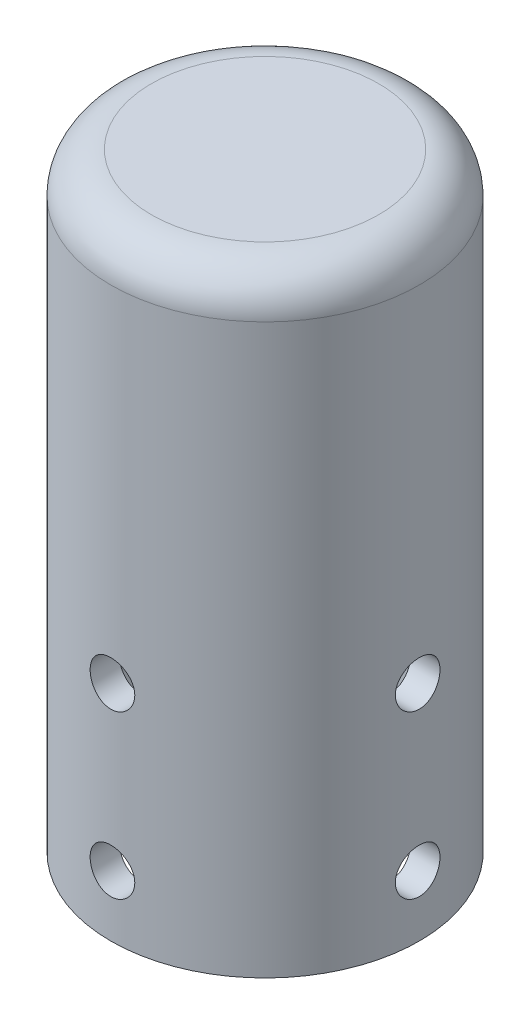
ISO-10303-21;
HEADER;
FILE_DESCRIPTION(('STEP AP214'),'2;1');
FILE_NAME('part.step','',(''),(''),'','','');
FILE_SCHEMA(('AUTOMOTIVE_DESIGN { 1 0 10303 214 1 1 1 1 }'));
ENDSEC;
DATA;
#1=APPLICATION_CONTEXT('core data for automotive mechanical design processes');
#2=APPLICATION_PROTOCOL_DEFINITION('international standard','automotive_design',2000,#1);
#3=PRODUCT_CONTEXT('',#1,'mechanical');
#4=PRODUCT('Part','Part','',(#3));
#5=PRODUCT_RELATED_PRODUCT_CATEGORY('part','',(#4));
#6=PRODUCT_DEFINITION_FORMATION('','',#4);
#7=PRODUCT_DEFINITION_CONTEXT('part definition',#1,'design');
#8=PRODUCT_DEFINITION('design','',#6,#7);
#9=PRODUCT_DEFINITION_SHAPE('','',#8);
#10=(LENGTH_UNIT() NAMED_UNIT(*) SI_UNIT(.MILLI.,.METRE.));
#11=(NAMED_UNIT(*) PLANE_ANGLE_UNIT() SI_UNIT($,.RADIAN.));
#12=(NAMED_UNIT(*) SI_UNIT($,.STERADIAN.) SOLID_ANGLE_UNIT());
#13=UNCERTAINTY_MEASURE_WITH_UNIT(LENGTH_MEASURE(1.E-05),#10,'distance_accuracy_value','');
#14=(GEOMETRIC_REPRESENTATION_CONTEXT(3) GLOBAL_UNCERTAINTY_ASSIGNED_CONTEXT((#13)) GLOBAL_UNIT_ASSIGNED_CONTEXT((#10,
#11,#12)) REPRESENTATION_CONTEXT('',''));
#15=CARTESIAN_POINT('',(0.,0.,0.));
#16=DIRECTION('',(0.,0.,1.));
#17=DIRECTION('',(1.,0.,0.));
#18=AXIS2_PLACEMENT_3D('',#15,#16,#17);
#19=CARTESIAN_POINT('',(0.,150.,0.));
#20=DIRECTION('',(0.,-1.,0.));
#21=DIRECTION('',(0.,0.,-1.));
#22=AXIS2_PLACEMENT_3D('',#19,#20,#21);
#23=CYLINDRICAL_SURFACE('',#22,38.);
#24=CARTESIAN_POINT('',(37.5998670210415,15.,-5.49999999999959));
#25=CARTESIAN_POINT('',(37.5998662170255,14.8463484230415,-5.5000020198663));
#26=CARTESIAN_POINT('',(37.6008107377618,14.6927254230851,-5.49355905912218));
#27=CARTESIAN_POINT('',(37.6045598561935,14.3865323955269,-5.46783838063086));
#28=CARTESIAN_POINT('',(37.6073648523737,14.2339626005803,-5.44855791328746));
#29=CARTESIAN_POINT('',(37.6147574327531,13.9309131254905,-5.39728548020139));
#30=CARTESIAN_POINT('',(37.6193462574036,13.7804349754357,-5.36528466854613));
#31=CARTESIAN_POINT('',(37.63017534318,13.4826870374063,-5.28879900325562));
#32=CARTESIAN_POINT('',(37.6364162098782,13.3354184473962,-5.24430957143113));
#33=CARTESIAN_POINT('',(37.6503611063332,13.0453497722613,-5.14323880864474));
#34=CARTESIAN_POINT('',(37.6580634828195,12.9025448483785,-5.08667113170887));
#35=CARTESIAN_POINT('',(37.6747192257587,12.6221729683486,-4.96180384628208));
#36=CARTESIAN_POINT('',(37.683673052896,12.484607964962,-4.8934999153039));
#37=CARTESIAN_POINT('',(37.7025707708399,12.2157922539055,-4.74570348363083));
#38=CARTESIAN_POINT('',(37.7125141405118,12.0845382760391,-4.66621686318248));
#39=CARTESIAN_POINT('',(37.7331190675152,11.8291188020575,-4.49655727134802));
#40=CARTESIAN_POINT('',(37.7437808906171,11.7049559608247,-4.40638033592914));
#41=CARTESIAN_POINT('',(37.7655898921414,11.4638599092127,-4.21539003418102));
#42=CARTESIAN_POINT('',(37.7767397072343,11.3469772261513,-4.11451318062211));
#43=CARTESIAN_POINT('',(37.7991512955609,11.1220666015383,-3.90326077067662));
#44=CARTESIAN_POINT('',(37.8104131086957,11.0140419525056,-3.79288171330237));
#45=CARTESIAN_POINT('',(37.8327245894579,10.8076770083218,-3.56345699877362));
#46=CARTESIAN_POINT('',(37.8437743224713,10.7093336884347,-3.44441406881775));
#47=CARTESIAN_POINT('',(37.8653593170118,10.5229461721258,-3.19840788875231));
#48=CARTESIAN_POINT('',(37.8758943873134,10.4349057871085,-3.0714417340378));
#49=CARTESIAN_POINT('',(37.896191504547,10.2694500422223,-2.80996964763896));
#50=CARTESIAN_POINT('',(37.9059501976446,10.1920798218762,-2.67543488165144));
#51=CARTESIAN_POINT('',(37.924372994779,10.0489286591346,-2.40020148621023));
#52=CARTESIAN_POINT('',(37.9330366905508,9.98315203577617,-2.25950058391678));
#53=CARTESIAN_POINT('',(37.9490149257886,9.86373231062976,-1.97302142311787));
#54=CARTESIAN_POINT('',(37.956330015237,9.81008426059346,-1.82724526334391));
#55=CARTESIAN_POINT('',(37.9694108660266,9.71527358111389,-1.5316044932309));
#56=CARTESIAN_POINT('',(37.9751760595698,9.67411552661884,-1.38173840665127));
#57=CARTESIAN_POINT('',(37.9898051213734,9.57043113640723,-0.929839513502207));
#58=CARTESIAN_POINT('',(37.9961371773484,9.52672072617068,-0.623161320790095));
#59=CARTESIAN_POINT('',(38.0012508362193,9.49134024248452,-0.00693002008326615));
#60=CARTESIAN_POINT('',(38.0000328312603,9.49966746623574,0.302622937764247));
#61=CARTESIAN_POINT('',(37.9902353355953,9.56777307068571,0.913580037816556));
#62=CARTESIAN_POINT('',(37.9817109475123,9.6271663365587,1.21502779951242));
#63=CARTESIAN_POINT('',(37.9583164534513,9.79513251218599,1.80362063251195));
#64=CARTESIAN_POINT('',(37.9434461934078,9.90370661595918,2.0907653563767));
#65=CARTESIAN_POINT('',(37.908936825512,10.1673453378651,2.6437876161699));
#66=CARTESIAN_POINT('',(37.8892810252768,10.3225731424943,2.90958628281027));
#67=CARTESIAN_POINT('',(37.8473928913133,10.6749951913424,3.41150730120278));
#68=CARTESIAN_POINT('',(37.8251603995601,10.8721920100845,3.6476278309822));
#69=CARTESIAN_POINT('',(37.7803600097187,11.305102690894,4.08576014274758));
#70=CARTESIAN_POINT('',(37.7577909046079,11.5411527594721,4.28743974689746));
#71=CARTESIAN_POINT('',(37.7150600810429,12.043924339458,4.64837382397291));
#72=CARTESIAN_POINT('',(37.6948983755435,12.3106460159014,4.80762806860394));
#73=CARTESIAN_POINT('',(37.6592656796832,12.8675244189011,5.0792298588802));
#74=CARTESIAN_POINT('',(37.6437979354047,13.1576971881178,5.19154496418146));
#75=CARTESIAN_POINT('',(37.6193631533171,13.753060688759,5.36575502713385));
#76=CARTESIAN_POINT('',(37.6103956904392,14.0582504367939,5.42765328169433));
#77=CARTESIAN_POINT('',(37.6000568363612,14.672034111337,5.49882055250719));
#78=CARTESIAN_POINT('',(37.5986175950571,14.9805724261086,5.50855968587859));
#79=CARTESIAN_POINT('',(37.6033181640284,15.594876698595,5.47637810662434));
#80=CARTESIAN_POINT('',(37.6094577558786,15.9006427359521,5.43445888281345));
#81=CARTESIAN_POINT('',(37.6285619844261,16.4992772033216,5.30054862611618));
#82=CARTESIAN_POINT('',(37.6414948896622,16.7921987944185,5.20879032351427));
#83=CARTESIAN_POINT('',(37.6727024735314,17.3585028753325,4.9780480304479));
#84=CARTESIAN_POINT('',(37.6909773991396,17.6318844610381,4.83906185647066));
#85=CARTESIAN_POINT('',(37.7309703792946,18.1534600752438,4.51667398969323));
#86=CARTESIAN_POINT('',(37.7527117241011,18.4014636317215,4.33296708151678));
#87=CARTESIAN_POINT('',(37.7971170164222,18.8632884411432,3.92677730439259));
#88=CARTESIAN_POINT('',(37.8197810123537,19.0771078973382,3.70429239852));
#89=CARTESIAN_POINT('',(37.8636893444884,19.4661753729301,3.2247996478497));
#90=CARTESIAN_POINT('',(37.884921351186,19.6411124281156,2.96753821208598));
#91=CARTESIAN_POINT('',(37.9233830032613,19.9452846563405,2.42699521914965));
#92=CARTESIAN_POINT('',(37.9406127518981,20.074521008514,2.14371433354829));
#93=CARTESIAN_POINT('',(37.9690763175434,20.283128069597,1.56021686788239));
#94=CARTESIAN_POINT('',(37.9803308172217,20.3626709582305,1.26006273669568));
#95=CARTESIAN_POINT('',(37.9956552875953,20.4701709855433,0.650312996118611));
#96=CARTESIAN_POINT('',(37.9997256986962,20.4981312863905,0.340717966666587));
#97=CARTESIAN_POINT('',(38.0001167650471,20.5007936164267,-0.122166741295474));
#98=CARTESIAN_POINT('',(37.9993094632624,20.4952362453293,-0.275587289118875));
#99=CARTESIAN_POINT('',(37.9958587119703,20.4713304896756,-0.581392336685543));
#100=CARTESIAN_POINT('',(37.9932159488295,20.4529868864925,-0.733777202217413));
#101=CARTESIAN_POINT('',(37.9861639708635,20.4036319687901,-1.03648465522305));
#102=CARTESIAN_POINT('',(37.9817541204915,20.3726160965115,-1.18680648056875));
#103=CARTESIAN_POINT('',(37.9712943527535,20.2981651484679,-1.48422845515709));
#104=CARTESIAN_POINT('',(37.9652450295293,20.2547345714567,-1.63132975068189));
#105=CARTESIAN_POINT('',(37.9516759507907,20.1557837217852,-1.92129024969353));
#106=CARTESIAN_POINT('',(37.9441566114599,20.1002668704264,-2.06415064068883));
#107=CARTESIAN_POINT('',(37.9278582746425,19.9775624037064,-2.3446311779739));
#108=CARTESIAN_POINT('',(37.919079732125,19.9103790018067,-2.48225319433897));
#109=CARTESIAN_POINT('',(37.9005002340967,19.7647802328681,-2.75141605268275));
#110=CARTESIAN_POINT('',(37.8906988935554,19.6863606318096,-2.88295457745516));
#111=CARTESIAN_POINT('',(37.8703507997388,19.5188906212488,-3.13895121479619));
#112=CARTESIAN_POINT('',(37.8598043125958,19.4298439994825,-3.26341182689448));
#113=CARTESIAN_POINT('',(37.8381551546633,19.2408577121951,-3.50555661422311));
#114=CARTESIAN_POINT('',(37.8270482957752,19.1408262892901,-3.62316881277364));
#115=CARTESIAN_POINT('',(37.8046837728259,18.9312797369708,-3.84952175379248));
#116=CARTESIAN_POINT('',(37.7934261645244,18.8217680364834,-3.95826567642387));
#117=CARTESIAN_POINT('',(37.7710655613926,18.593918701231,-4.16623986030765));
#118=CARTESIAN_POINT('',(37.7599626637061,18.4755757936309,-4.26546435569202));
#119=CARTESIAN_POINT('',(37.7382357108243,18.2309850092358,-4.45359764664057));
#120=CARTESIAN_POINT('',(37.7276114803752,18.1047400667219,-4.54251023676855));
#121=CARTESIAN_POINT('',(37.7070812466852,17.8444504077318,-4.70990206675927));
#122=CARTESIAN_POINT('',(37.6971795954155,17.7103659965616,-4.78832013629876));
#123=CARTESIAN_POINT('',(37.6784496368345,17.4360387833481,-4.93353759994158));
#124=CARTESIAN_POINT('',(37.6696209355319,17.2957982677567,-5.0003412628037));
#125=CARTESIAN_POINT('',(37.6532950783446,17.0102064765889,-5.12182862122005));
#126=CARTESIAN_POINT('',(37.645796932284,16.8648590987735,-5.17652133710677));
#127=CARTESIAN_POINT('',(37.6323443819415,16.5700440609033,-5.27342795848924));
#128=CARTESIAN_POINT('',(37.6263896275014,16.4205773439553,-5.31564469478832));
#129=CARTESIAN_POINT('',(37.6142875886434,16.0618943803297,-5.40073072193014));
#130=CARTESIAN_POINT('',(37.6089044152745,15.8512776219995,-5.4379158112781));
#131=CARTESIAN_POINT('',(37.6016947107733,15.4270888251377,-5.48754890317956));
#132=CARTESIAN_POINT('',(37.5998681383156,15.2135168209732,-5.49999719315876));
#133=CARTESIAN_POINT('',(37.5998670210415,15.,-5.49999999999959));
#134=B_SPLINE_CURVE_WITH_KNOTS('',3,(#24,#25,#26,#27,#28,#29,#30,#31,#32,#33,#34,#35,#36,#37,
#38,#39,#40,#41,#42,#43,#44,#45,#46,#47,#48,#49,#50,#51,#52,#53,#54,#55,#56,#57,#58,#59,#60,#61,
#62,#63,#64,#65,#66,#67,#68,#69,#70,#71,#72,#73,#74,#75,#76,#77,#78,#79,#80,#81,#82,#83,#84,#85,
#86,#87,#88,#89,#90,#91,#92,#93,#94,#95,#96,#97,#98,#99,#100,#101,#102,#103,#104,#105,#106,#107,
#108,#109,#110,#111,#112,#113,#114,#115,#116,#117,#118,#119,#120,#121,#122,#123,#124,#125,#126,
#127,#128,#129,#130,#131,#132,#133),.UNSPECIFIED.,.T.,.F.,(4,2,2,2,2,2,2,2,2,2,2,2,2,2,2,2,2,2,
2,2,2,2,2,2,2,2,2,2,2,2,2,2,2,2,2,2,2,2,2,2,2,2,2,2,2,2,2,2,2,2,2,2,2,2,4),(0.,
0.460767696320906,0.92163411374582,1.38282158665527,1.84417834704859,2.30501629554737,
2.76602433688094,3.22679086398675,3.68772878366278,4.15157337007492,4.61558959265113,
5.07946037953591,5.54350222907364,6.00945061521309,6.4755722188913,6.94150330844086,
7.40760485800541,8.33227826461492,9.25690364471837,10.1746165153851,11.0923516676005,
12.0133350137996,12.9343748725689,13.8638497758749,14.7933296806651,15.7234509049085,
16.6535113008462,17.5751746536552,18.4968114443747,19.4141810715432,20.3315931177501,
21.2554511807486,22.1793577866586,23.1104068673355,24.041431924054,24.9692129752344,
25.8969371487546,26.3570589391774,26.8170087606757,27.277124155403,27.7370730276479,
28.1968918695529,28.6565449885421,29.116371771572,29.5760351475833,30.0398816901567,
30.5035611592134,30.9675197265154,31.4313070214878,31.8976897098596,32.3639006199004,
32.8297631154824,33.2955198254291,33.9358178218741,34.5761083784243),.UNSPECIFIED.);
#135=CARTESIAN_POINT('',(37.5998670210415,15.,-5.49999999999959));
#136=VERTEX_POINT('',#135);
#137=EDGE_CURVE('E118',#136,#136,#134,.T.);
#138=ORIENTED_EDGE('',*,*,#137,.T.);
#139=EDGE_LOOP('',(#138));
#140=FACE_BOUND('',#139,.T.);
#141=CARTESIAN_POINT('',(37.5998670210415,55.,-5.49999999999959));
#142=CARTESIAN_POINT('',(37.5998662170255,54.8463484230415,-5.5000020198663));
#143=CARTESIAN_POINT('',(37.6008107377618,54.6927254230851,-5.49355905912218));
#144=CARTESIAN_POINT('',(37.6045598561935,54.3865323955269,-5.46783838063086));
#145=CARTESIAN_POINT('',(37.6073648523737,54.2339626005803,-5.44855791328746));
#146=CARTESIAN_POINT('',(37.6147574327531,53.9309131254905,-5.39728548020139));
#147=CARTESIAN_POINT('',(37.6193462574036,53.7804349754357,-5.36528466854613));
#148=CARTESIAN_POINT('',(37.63017534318,53.4826870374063,-5.28879900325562));
#149=CARTESIAN_POINT('',(37.6364162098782,53.3354184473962,-5.24430957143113));
#150=CARTESIAN_POINT('',(37.6503611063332,53.0453497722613,-5.14323880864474));
#151=CARTESIAN_POINT('',(37.6580634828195,52.9025448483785,-5.08667113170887));
#152=CARTESIAN_POINT('',(37.6747192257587,52.6221729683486,-4.96180384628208));
#153=CARTESIAN_POINT('',(37.6836730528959,52.484607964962,-4.8934999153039));
#154=CARTESIAN_POINT('',(37.7025707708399,52.2157922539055,-4.74570348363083));
#155=CARTESIAN_POINT('',(37.7125141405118,52.0845382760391,-4.66621686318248));
#156=CARTESIAN_POINT('',(37.7331190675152,51.8291188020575,-4.49655727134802));
#157=CARTESIAN_POINT('',(37.7437808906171,51.7049559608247,-4.40638033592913));
#158=CARTESIAN_POINT('',(37.7655898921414,51.4638599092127,-4.21539003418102));
#159=CARTESIAN_POINT('',(37.7767397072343,51.3469772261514,-4.1145131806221));
#160=CARTESIAN_POINT('',(37.7991512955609,51.1220666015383,-3.90326077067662));
#161=CARTESIAN_POINT('',(37.8104131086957,51.0140419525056,-3.79288171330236));
#162=CARTESIAN_POINT('',(37.8327245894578,50.8076770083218,-3.56345699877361));
#163=CARTESIAN_POINT('',(37.8437743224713,50.7093336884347,-3.44441406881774));
#164=CARTESIAN_POINT('',(37.8653593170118,50.5229461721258,-3.1984078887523));
#165=CARTESIAN_POINT('',(37.8758943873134,50.4349057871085,-3.07144173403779));
#166=CARTESIAN_POINT('',(37.896191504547,50.2694500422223,-2.80996964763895));
#167=CARTESIAN_POINT('',(37.9059501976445,50.1920798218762,-2.67543488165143));
#168=CARTESIAN_POINT('',(37.924372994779,50.0489286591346,-2.40020148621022));
#169=CARTESIAN_POINT('',(37.9330366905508,49.9831520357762,-2.25950058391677));
#170=CARTESIAN_POINT('',(37.9490149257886,49.8637323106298,-1.97302142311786));
#171=CARTESIAN_POINT('',(37.956330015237,49.8100842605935,-1.8272452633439));
#172=CARTESIAN_POINT('',(37.9694108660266,49.7152735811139,-1.53160449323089));
#173=CARTESIAN_POINT('',(37.9751760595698,49.6741155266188,-1.38173840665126));
#174=CARTESIAN_POINT('',(37.9898051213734,49.5704311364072,-0.9298395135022));
#175=CARTESIAN_POINT('',(37.9961371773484,49.5267207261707,-0.623161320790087));
#176=CARTESIAN_POINT('',(38.0012508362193,49.4913402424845,-0.00693002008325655));
#177=CARTESIAN_POINT('',(38.0000328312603,49.4996674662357,0.302622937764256));
#178=CARTESIAN_POINT('',(37.9902353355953,49.5677730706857,0.913580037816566));
#179=CARTESIAN_POINT('',(37.9817109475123,49.6271663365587,1.21502779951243));
#180=CARTESIAN_POINT('',(37.9583164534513,49.795132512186,1.80362063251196));
#181=CARTESIAN_POINT('',(37.9434461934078,49.9037066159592,2.09076535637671));
#182=CARTESIAN_POINT('',(37.908936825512,50.1673453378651,2.6437876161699));
#183=CARTESIAN_POINT('',(37.8892810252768,50.3225731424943,2.90958628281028));
#184=CARTESIAN_POINT('',(37.8473928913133,50.6749951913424,3.41150730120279));
#185=CARTESIAN_POINT('',(37.8251603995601,50.8721920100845,3.64762783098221));
#186=CARTESIAN_POINT('',(37.7803600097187,51.305102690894,4.08576014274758));
#187=CARTESIAN_POINT('',(37.7577909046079,51.5411527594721,4.28743974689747));
#188=CARTESIAN_POINT('',(37.7150600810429,52.043924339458,4.64837382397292));
#189=CARTESIAN_POINT('',(37.6948983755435,52.3106460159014,4.80762806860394));
#190=CARTESIAN_POINT('',(37.6592656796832,52.8675244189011,5.0792298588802));
#191=CARTESIAN_POINT('',(37.6437979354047,53.1576971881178,5.19154496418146));
#192=CARTESIAN_POINT('',(37.6193631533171,53.753060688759,5.36575502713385));
#193=CARTESIAN_POINT('',(37.6103956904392,54.0582504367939,5.42765328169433));
#194=CARTESIAN_POINT('',(37.6000568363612,54.672034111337,5.49882055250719));
#195=CARTESIAN_POINT('',(37.5986175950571,54.9805724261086,5.50855968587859));
#196=CARTESIAN_POINT('',(37.6033181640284,55.594876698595,5.47637810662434));
#197=CARTESIAN_POINT('',(37.6094577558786,55.9006427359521,5.43445888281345));
#198=CARTESIAN_POINT('',(37.6285619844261,56.4992772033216,5.30054862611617));
#199=CARTESIAN_POINT('',(37.6414948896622,56.7921987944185,5.20879032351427));
#200=CARTESIAN_POINT('',(37.6727024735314,57.3585028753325,4.97804803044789));
#201=CARTESIAN_POINT('',(37.6909773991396,57.6318844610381,4.83906185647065));
#202=CARTESIAN_POINT('',(37.7309703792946,58.1534600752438,4.51667398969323));
#203=CARTESIAN_POINT('',(37.7527117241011,58.4014636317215,4.33296708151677));
#204=CARTESIAN_POINT('',(37.7971170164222,58.8632884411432,3.92677730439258));
#205=CARTESIAN_POINT('',(37.8197810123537,59.0771078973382,3.70429239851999));
#206=CARTESIAN_POINT('',(37.8636893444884,59.4661753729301,3.22479964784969));
#207=CARTESIAN_POINT('',(37.884921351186,59.6411124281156,2.96753821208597));
#208=CARTESIAN_POINT('',(37.9233830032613,59.9452846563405,2.42699521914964));
#209=CARTESIAN_POINT('',(37.9406127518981,60.074521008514,2.14371433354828));
#210=CARTESIAN_POINT('',(37.9690763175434,60.283128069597,1.56021686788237));
#211=CARTESIAN_POINT('',(37.9803308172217,60.3626709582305,1.26006273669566));
#212=CARTESIAN_POINT('',(37.9956552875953,60.4701709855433,0.650312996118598));
#213=CARTESIAN_POINT('',(37.9997256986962,60.4981312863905,0.340717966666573));
#214=CARTESIAN_POINT('',(38.0001167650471,60.5007936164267,-0.122166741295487));
#215=CARTESIAN_POINT('',(37.9993094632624,60.4952362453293,-0.275587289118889));
#216=CARTESIAN_POINT('',(37.9958587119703,60.4713304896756,-0.581392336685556));
#217=CARTESIAN_POINT('',(37.9932159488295,60.4529868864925,-0.733777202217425));
#218=CARTESIAN_POINT('',(37.9861639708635,60.4036319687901,-1.03648465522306));
#219=CARTESIAN_POINT('',(37.9817541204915,60.3726160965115,-1.18680648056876));
#220=CARTESIAN_POINT('',(37.9712943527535,60.2981651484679,-1.4842284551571));
#221=CARTESIAN_POINT('',(37.9652450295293,60.2547345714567,-1.6313297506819));
#222=CARTESIAN_POINT('',(37.9516759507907,60.1557837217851,-1.92129024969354));
#223=CARTESIAN_POINT('',(37.9441566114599,60.1002668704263,-2.06415064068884));
#224=CARTESIAN_POINT('',(37.9278582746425,59.9775624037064,-2.34463117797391));
#225=CARTESIAN_POINT('',(37.919079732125,59.9103790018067,-2.48225319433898));
#226=CARTESIAN_POINT('',(37.9005002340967,59.7647802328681,-2.75141605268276));
#227=CARTESIAN_POINT('',(37.8906988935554,59.6863606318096,-2.88295457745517));
#228=CARTESIAN_POINT('',(37.8703507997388,59.5188906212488,-3.1389512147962));
#229=CARTESIAN_POINT('',(37.8598043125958,59.4298439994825,-3.26341182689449));
#230=CARTESIAN_POINT('',(37.8381551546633,59.2408577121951,-3.50555661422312));
#231=CARTESIAN_POINT('',(37.8270482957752,59.1408262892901,-3.62316881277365));
#232=CARTESIAN_POINT('',(37.8046837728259,58.9312797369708,-3.84952175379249));
#233=CARTESIAN_POINT('',(37.7934261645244,58.8217680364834,-3.95826567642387));
#234=CARTESIAN_POINT('',(37.7710655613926,58.5939187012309,-4.16623986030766));
#235=CARTESIAN_POINT('',(37.7599626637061,58.4755757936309,-4.26546435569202));
#236=CARTESIAN_POINT('',(37.7382357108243,58.2309850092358,-4.45359764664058));
#237=CARTESIAN_POINT('',(37.7276114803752,58.1047400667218,-4.54251023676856));
#238=CARTESIAN_POINT('',(37.7070812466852,57.8444504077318,-4.70990206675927));
#239=CARTESIAN_POINT('',(37.6971795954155,57.7103659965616,-4.78832013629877));
#240=CARTESIAN_POINT('',(37.6784496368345,57.4360387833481,-4.93353759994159));
#241=CARTESIAN_POINT('',(37.6696209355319,57.2957982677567,-5.00034126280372));
#242=CARTESIAN_POINT('',(37.6532950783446,57.0102064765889,-5.12182862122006));
#243=CARTESIAN_POINT('',(37.645796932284,56.8648590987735,-5.17652133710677));
#244=CARTESIAN_POINT('',(37.6323443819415,56.5700440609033,-5.27342795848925));
#245=CARTESIAN_POINT('',(37.6263896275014,56.4205773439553,-5.31564469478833));
#246=CARTESIAN_POINT('',(37.6142875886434,56.0618943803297,-5.40073072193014));
#247=CARTESIAN_POINT('',(37.6089044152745,55.8512776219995,-5.4379158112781));
#248=CARTESIAN_POINT('',(37.6016947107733,55.4270888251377,-5.48754890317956));
#249=CARTESIAN_POINT('',(37.5998681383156,55.2135168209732,-5.49999719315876));
#250=CARTESIAN_POINT('',(37.5998670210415,55.,-5.49999999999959));
#251=B_SPLINE_CURVE_WITH_KNOTS('',3,(#141,#142,#143,#144,#145,#146,#147,#148,#149,#150,#151,
#152,#153,#154,#155,#156,#157,#158,#159,#160,#161,#162,#163,#164,#165,#166,#167,#168,#169,#170,
#171,#172,#173,#174,#175,#176,#177,#178,#179,#180,#181,#182,#183,#184,#185,#186,#187,#188,#189,
#190,#191,#192,#193,#194,#195,#196,#197,#198,#199,#200,#201,#202,#203,#204,#205,#206,#207,#208,
#209,#210,#211,#212,#213,#214,#215,#216,#217,#218,#219,#220,#221,#222,#223,#224,#225,#226,#227,
#228,#229,#230,#231,#232,#233,#234,#235,#236,#237,#238,#239,#240,#241,#242,#243,#244,#245,#246,
#247,#248,#249,#250),.UNSPECIFIED.,.T.,.F.,(4,2,2,2,2,2,2,2,2,2,2,2,2,2,2,2,2,2,2,2,2,2,2,2,2,2,
2,2,2,2,2,2,2,2,2,2,2,2,2,2,2,2,2,2,2,2,2,2,2,2,2,2,2,2,4),(0.,0.460767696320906,
0.921634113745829,1.38282158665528,1.8441783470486,2.30501629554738,2.76602433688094,
3.22679086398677,3.68772878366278,4.15157337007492,4.61558959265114,5.07946037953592,
5.54350222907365,6.00945061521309,6.47557221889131,6.94150330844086,7.40760485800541,
8.33227826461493,9.25690364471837,10.1746165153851,11.0923516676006,12.0133350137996,
12.9343748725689,13.8638497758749,14.7933296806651,15.7234509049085,16.6535113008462,
17.5751746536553,18.4968114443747,19.4141810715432,20.3315931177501,21.2554511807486,
22.1793577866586,23.1104068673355,24.041431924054,24.9692129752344,25.8969371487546,
26.3570589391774,26.8170087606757,27.277124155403,27.7370730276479,28.1968918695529,
28.6565449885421,29.116371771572,29.5760351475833,30.0398816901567,30.5035611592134,
30.9675197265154,31.4313070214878,31.8976897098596,32.3639006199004,32.8297631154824,
33.2955198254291,33.9358178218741,34.5761083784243),.UNSPECIFIED.);
#252=CARTESIAN_POINT('',(37.5998670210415,55.,-5.49999999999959));
#253=VERTEX_POINT('',#252);
#254=EDGE_CURVE('E122',#253,#253,#251,.T.);
#255=ORIENTED_EDGE('',*,*,#254,.T.);
#256=EDGE_LOOP('',(#255));
#257=FACE_BOUND('',#256,.T.);
#258=CARTESIAN_POINT('',(0.,20.5,-38.));
#259=CARTESIAN_POINT('',(-0.153661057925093,20.5000020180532,-38.0000007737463));
#260=CARTESIAN_POINT('',(-0.307293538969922,20.4935582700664,-37.9990661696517));
#261=CARTESIAN_POINT('',(-0.613505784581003,20.467834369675,-37.995355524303));
#262=CARTESIAN_POINT('',(-0.766085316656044,20.448551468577,-37.9925790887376));
#263=CARTESIAN_POINT('',(-1.06915447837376,20.3972723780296,-37.9852590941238));
#264=CARTESIAN_POINT('',(-1.21964258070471,20.3652673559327,-37.9807143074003));
#265=CARTESIAN_POINT('',(-1.51741063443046,20.2887713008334,-37.9699837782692));
#266=CARTESIAN_POINT('',(-1.66468938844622,20.2442756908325,-37.9637974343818));
#267=CARTESIAN_POINT('',(-1.95477968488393,20.1431900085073,-37.9499657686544));
#268=CARTESIAN_POINT('',(-2.09759602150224,20.086613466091,-37.9423220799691));
#269=CARTESIAN_POINT('',(-2.37798974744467,19.961726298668,-37.9257814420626));
#270=CARTESIAN_POINT('',(-2.51556518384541,19.8934113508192,-37.9168840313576));
#271=CARTESIAN_POINT('',(-2.78439989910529,19.7455911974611,-37.8980905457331));
#272=CARTESIAN_POINT('',(-2.91566245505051,19.6660918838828,-37.888194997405));
#273=CARTESIAN_POINT('',(-3.17109673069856,19.4964057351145,-37.8676718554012));
#274=CARTESIAN_POINT('',(-3.29526579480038,19.4062149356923,-37.8570439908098));
#275=CARTESIAN_POINT('',(-3.53635333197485,19.2152107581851,-37.8352870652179));
#276=CARTESIAN_POINT('',(-3.65322247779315,19.1143354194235,-37.8241553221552));
#277=CARTESIAN_POINT('',(-3.87810590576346,18.9030889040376,-37.8017601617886));
#278=CARTESIAN_POINT('',(-3.9861168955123,18.7927142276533,-37.7904966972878));
#279=CARTESIAN_POINT('',(-4.19245511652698,18.5633009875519,-37.7681623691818));
#280=CARTESIAN_POINT('',(-4.29078535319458,18.4442651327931,-37.7570914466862));
#281=CARTESIAN_POINT('',(-4.47714771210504,18.1982757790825,-37.7354469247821));
#282=CARTESIAN_POINT('',(-4.56517602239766,18.0713193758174,-37.7248735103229));
#283=CARTESIAN_POINT('',(-4.73061807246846,17.809855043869,-37.7044855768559));
#284=CARTESIAN_POINT('',(-4.80798550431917,17.675317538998,-37.6946744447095));
#285=CARTESIAN_POINT('',(-4.95113080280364,17.4000788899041,-37.6761398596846));
#286=CARTESIAN_POINT('',(-5.01690435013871,17.2593754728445,-37.6674168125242));
#287=CARTESIAN_POINT('',(-5.13631774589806,16.9728911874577,-37.6513197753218));
#288=CARTESIAN_POINT('',(-5.18996255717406,16.8271124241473,-37.6439452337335));
#289=CARTESIAN_POINT('',(-5.28476663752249,16.5314658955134,-37.6307520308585));
#290=CARTESIAN_POINT('',(-5.32592133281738,16.3815966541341,-37.6249339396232));
#291=CARTESIAN_POINT('',(-5.4295962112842,15.9296829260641,-37.61016631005));
#292=CARTESIAN_POINT('',(-5.47329930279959,15.6229917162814,-37.6037677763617));
#293=CARTESIAN_POINT('',(-5.50866065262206,15.0067348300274,-37.5986029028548));
#294=CARTESIAN_POINT('',(-5.50032169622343,14.6971693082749,-37.5998361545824));
#295=CARTESIAN_POINT('',(-5.43219722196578,14.0862631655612,-37.6097379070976));
#296=CARTESIAN_POINT('',(-5.37280864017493,13.7848775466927,-37.6183490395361));
#297=CARTESIAN_POINT('',(-5.20487326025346,13.196406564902,-37.6419502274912));
#298=CARTESIAN_POINT('',(-5.09632515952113,12.9093215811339,-37.6569404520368));
#299=CARTESIAN_POINT('',(-4.83274087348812,12.3563728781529,-37.6916736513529));
#300=CARTESIAN_POINT('',(-4.67753553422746,12.0905909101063,-37.7114338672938));
#301=CARTESIAN_POINT('',(-4.3251617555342,11.588693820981,-37.753468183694));
#302=CARTESIAN_POINT('',(-4.1279907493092,11.352580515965,-37.775742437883));
#303=CARTESIAN_POINT('',(-3.69509875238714,10.9144201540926,-37.8205489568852));
#304=CARTESIAN_POINT('',(-3.45903619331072,10.7127104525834,-37.8430816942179));
#305=CARTESIAN_POINT('',(-2.95622876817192,10.3517215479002,-37.8856735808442));
#306=CARTESIAN_POINT('',(-2.6894837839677,10.1924425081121,-37.9057327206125));
#307=CARTESIAN_POINT('',(-2.13259829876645,9.92082272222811,-37.9411361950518));
#308=CARTESIAN_POINT('',(-1.84244547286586,9.80850689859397,-37.9564780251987));
#309=CARTESIAN_POINT('',(-1.24712543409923,9.63428932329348,-37.9806970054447));
#310=CARTESIAN_POINT('',(-0.941959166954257,9.57238440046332,-37.9895745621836));
#311=CARTESIAN_POINT('',(-0.328187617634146,9.50119190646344,-37.9998111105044));
#312=CARTESIAN_POINT('',(-0.019637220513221,9.49144033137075,-38.0012364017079));
#313=CARTESIAN_POINT('',(0.594694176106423,9.52360133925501,-37.9965879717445));
#314=CARTESIAN_POINT('',(0.900475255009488,9.56551243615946,-37.9905144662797));
#315=CARTESIAN_POINT('',(1.49919071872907,9.69942328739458,-37.9715919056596));
#316=CARTESIAN_POINT('',(1.79217646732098,9.79119806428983,-37.9587732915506));
#317=CARTESIAN_POINT('',(2.35860160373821,10.0219947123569,-37.9277936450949));
#318=CARTESIAN_POINT('',(2.63204012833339,10.1610186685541,-37.9096323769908));
#319=CARTESIAN_POINT('',(3.15365649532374,10.4834632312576,-37.8698220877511));
#320=CARTESIAN_POINT('',(3.40164979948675,10.667179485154,-37.8481501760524));
#321=CARTESIAN_POINT('',(3.8634495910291,11.0733816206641,-37.8038050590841));
#322=CARTESIAN_POINT('',(4.07725423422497,11.2958695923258,-37.7811317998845));
#323=CARTESIAN_POINT('',(4.46628689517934,11.7753563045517,-37.7371302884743));
#324=CARTESIAN_POINT('',(4.64120463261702,12.0326080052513,-37.715813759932));
#325=CARTESIAN_POINT('',(4.9453430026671,12.5731261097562,-37.6771441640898));
#326=CARTESIAN_POINT('',(5.0745648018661,12.8563918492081,-37.6597909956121));
#327=CARTESIAN_POINT('',(5.28316282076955,13.4398966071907,-37.6310947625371));
#328=CARTESIAN_POINT('',(5.36270492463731,13.740075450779,-37.6197317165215));
#329=CARTESIAN_POINT('',(5.47019499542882,14.3498776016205,-37.6042556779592));
#330=CARTESIAN_POINT('',(5.49814625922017,14.6595003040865,-37.6001422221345));
#331=CARTESIAN_POINT('',(5.50078807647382,15.1223914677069,-37.5997497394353));
#332=CARTESIAN_POINT('',(5.49522542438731,15.275791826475,-37.6005665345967));
#333=CARTESIAN_POINT('',(5.47131253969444,15.5815558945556,-37.6040546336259));
#334=CARTESIAN_POINT('',(5.45296708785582,15.733919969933,-37.6067252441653));
#335=CARTESIAN_POINT('',(5.40361204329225,16.0365854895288,-37.6138483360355));
#336=CARTESIAN_POINT('',(5.37259788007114,16.1868861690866,-37.6183014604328));
#337=CARTESIAN_POINT('',(5.29815408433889,16.4842657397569,-37.6288583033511));
#338=CARTESIAN_POINT('',(5.2547289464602,16.6313457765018,-37.6349614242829));
#339=CARTESIAN_POINT('',(5.15579379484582,16.9212611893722,-37.6486424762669));
#340=CARTESIAN_POINT('',(5.10028745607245,17.064097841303,-37.656219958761));
#341=CARTESIAN_POINT('',(4.97760808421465,17.344532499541,-37.6726325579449));
#342=CARTESIAN_POINT('',(4.91043926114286,17.4821323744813,-37.6814672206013));
#343=CARTESIAN_POINT('',(4.76487319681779,17.751253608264,-37.7001507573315));
#344=CARTESIAN_POINT('',(4.68647171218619,17.8827726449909,-37.7100000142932));
#345=CARTESIAN_POINT('',(4.51904082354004,18.1387337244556,-37.7304303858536));
#346=CARTESIAN_POINT('',(4.43001520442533,18.2631782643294,-37.7410112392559));
#347=CARTESIAN_POINT('',(4.24105159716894,18.5053224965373,-37.7627145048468));
#348=CARTESIAN_POINT('',(4.14101954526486,18.6229484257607,-37.7738410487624));
#349=CARTESIAN_POINT('',(3.93146889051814,18.8493290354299,-37.7962253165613));
#350=CARTESIAN_POINT('',(3.82195371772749,18.9580868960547,-37.8074829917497));
#351=CARTESIAN_POINT('',(3.59409467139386,19.1660885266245,-37.8298241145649));
#352=CARTESIAN_POINT('',(3.47574553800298,19.2653265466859,-37.8409074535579));
#353=CARTESIAN_POINT('',(3.23113959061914,19.4534859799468,-37.862577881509));
#354=CARTESIAN_POINT('',(3.1048857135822,19.5424111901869,-37.8731651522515));
#355=CARTESIAN_POINT('',(2.84458906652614,19.709818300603,-37.8936069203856));
#356=CARTESIAN_POINT('',(2.71050731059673,19.7882401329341,-37.9034570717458));
#357=CARTESIAN_POINT('',(2.43618502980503,19.9334653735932,-37.9220766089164));
#358=CARTESIAN_POINT('',(2.29594679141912,20.0002730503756,-37.9308463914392));
#359=CARTESIAN_POINT('',(2.0103594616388,20.1217685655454,-37.9470537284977));
#360=CARTESIAN_POINT('',(1.86501426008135,20.1764654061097,-37.9544922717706));
#361=CARTESIAN_POINT('',(1.57020402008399,20.2733803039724,-37.9678316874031));
#362=CARTESIAN_POINT('',(1.42073992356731,20.3156011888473,-37.9737329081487));
#363=CARTESIAN_POINT('',(1.06203256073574,20.4007047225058,-37.9857234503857));
#364=CARTESIAN_POINT('',(0.85138815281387,20.4378996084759,-37.9910536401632));
#365=CARTESIAN_POINT('',(0.42714407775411,20.4875457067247,-37.9981913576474));
#366=CARTESIAN_POINT('',(0.213544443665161,20.4999971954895,-37.9999989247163));
#367=CARTESIAN_POINT('',(0.,20.5,-38.));
#368=B_SPLINE_CURVE_WITH_KNOTS('',3,(#258,#259,#260,#261,#262,#263,#264,#265,#266,#267,#268,
#269,#270,#271,#272,#273,#274,#275,#276,#277,#278,#279,#280,#281,#282,#283,#284,#285,#286,#287,
#288,#289,#290,#291,#292,#293,#294,#295,#296,#297,#298,#299,#300,#301,#302,#303,#304,#305,#306,
#307,#308,#309,#310,#311,#312,#313,#314,#315,#316,#317,#318,#319,#320,#321,#322,#323,#324,#325,
#326,#327,#328,#329,#330,#331,#332,#333,#334,#335,#336,#337,#338,#339,#340,#341,#342,#343,#344,
#345,#346,#347,#348,#349,#350,#351,#352,#353,#354,#355,#356,#357,#358,#359,#360,#361,#362,#363,
#364,#365,#366,#367),.UNSPECIFIED.,.T.,.F.,(4,2,2,2,2,2,2,2,2,2,2,2,2,2,2,2,2,2,2,2,2,2,2,2,2,2,
2,2,2,2,2,2,2,2,2,2,2,2,2,2,2,2,2,2,2,2,2,2,2,2,2,2,2,2,4),(0.,0.46079617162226,
0.921691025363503,1.38290642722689,1.84429105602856,2.30516164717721,2.76620232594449,
3.22700103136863,3.68797113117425,4.15177828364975,4.61575705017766,5.07959131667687,
5.54359667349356,6.00955795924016,6.47569247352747,6.94163590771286,7.407749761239,
8.33246063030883,9.25712200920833,10.1746580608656,11.0922184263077,12.0131463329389,
12.9341305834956,13.8636828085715,14.7932386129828,15.7232870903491,16.6532770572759,
17.5749790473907,18.4966545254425,19.4142056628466,20.3317972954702,21.2556324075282,
22.1795173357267,23.1105286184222,24.0415161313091,24.9693781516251,25.8971808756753,
26.3572428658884,26.8171328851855,27.2771889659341,27.7370786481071,28.1968286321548,
28.6564129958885,29.1161714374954,29.575766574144,30.0396497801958,30.5033658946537,
30.9673603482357,31.4311834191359,31.8975550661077,32.3637549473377,32.8296071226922,
33.2953536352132,33.9357342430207,34.57610769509),.UNSPECIFIED.);
#369=CARTESIAN_POINT('',(0.,20.5,-38.));
#370=VERTEX_POINT('',#369);
#371=EDGE_CURVE('E126',#370,#370,#368,.T.);
#372=ORIENTED_EDGE('',*,*,#371,.T.);
#373=EDGE_LOOP('',(#372));
#374=FACE_BOUND('',#373,.T.);
#375=CARTESIAN_POINT('',(0.,60.5,-38.));
#376=CARTESIAN_POINT('',(-0.153661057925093,60.5000020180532,-38.0000007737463));
#377=CARTESIAN_POINT('',(-0.307293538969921,60.4935582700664,-37.9990661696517));
#378=CARTESIAN_POINT('',(-0.613505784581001,60.467834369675,-37.995355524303));
#379=CARTESIAN_POINT('',(-0.766085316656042,60.448551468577,-37.9925790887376));
#380=CARTESIAN_POINT('',(-1.06915447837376,60.3972723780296,-37.9852590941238));
#381=CARTESIAN_POINT('',(-1.21964258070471,60.3652673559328,-37.9807143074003));
#382=CARTESIAN_POINT('',(-1.51741063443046,60.2887713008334,-37.9699837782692));
#383=CARTESIAN_POINT('',(-1.66468938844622,60.2442756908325,-37.9637974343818));
#384=CARTESIAN_POINT('',(-1.95477968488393,60.1431900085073,-37.9499657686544));
#385=CARTESIAN_POINT('',(-2.09759602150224,60.086613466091,-37.9423220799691));
#386=CARTESIAN_POINT('',(-2.37798974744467,59.961726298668,-37.9257814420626));
#387=CARTESIAN_POINT('',(-2.51556518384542,59.8934113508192,-37.9168840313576));
#388=CARTESIAN_POINT('',(-2.78439989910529,59.7455911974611,-37.8980905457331));
#389=CARTESIAN_POINT('',(-2.91566245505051,59.6660918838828,-37.888194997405));
#390=CARTESIAN_POINT('',(-3.17109673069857,59.4964057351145,-37.8676718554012));
#391=CARTESIAN_POINT('',(-3.29526579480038,59.4062149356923,-37.8570439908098));
#392=CARTESIAN_POINT('',(-3.53635333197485,59.2152107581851,-37.8352870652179));
#393=CARTESIAN_POINT('',(-3.65322247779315,59.1143354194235,-37.8241553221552));
#394=CARTESIAN_POINT('',(-3.87810590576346,58.9030889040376,-37.8017601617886));
#395=CARTESIAN_POINT('',(-3.98611689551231,58.7927142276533,-37.7904966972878));
#396=CARTESIAN_POINT('',(-4.19245511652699,58.5633009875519,-37.7681623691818));
#397=CARTESIAN_POINT('',(-4.29078535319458,58.4442651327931,-37.7570914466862));
#398=CARTESIAN_POINT('',(-4.47714771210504,58.1982757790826,-37.7354469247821));
#399=CARTESIAN_POINT('',(-4.56517602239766,58.0713193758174,-37.7248735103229));
#400=CARTESIAN_POINT('',(-4.73061807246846,57.809855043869,-37.7044855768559));
#401=CARTESIAN_POINT('',(-4.80798550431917,57.675317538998,-37.6946744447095));
#402=CARTESIAN_POINT('',(-4.95113080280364,57.4000788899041,-37.6761398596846));
#403=CARTESIAN_POINT('',(-5.01690435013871,57.2593754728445,-37.6674168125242));
#404=CARTESIAN_POINT('',(-5.13631774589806,56.9728911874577,-37.6513197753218));
#405=CARTESIAN_POINT('',(-5.18996255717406,56.8271124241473,-37.6439452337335));
#406=CARTESIAN_POINT('',(-5.28476663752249,56.5314658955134,-37.6307520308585));
#407=CARTESIAN_POINT('',(-5.32592133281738,56.3815966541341,-37.6249339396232));
#408=CARTESIAN_POINT('',(-5.4295962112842,55.9296829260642,-37.61016631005));
#409=CARTESIAN_POINT('',(-5.47329930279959,55.6229917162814,-37.6037677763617));
#410=CARTESIAN_POINT('',(-5.50866065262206,55.0067348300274,-37.5986029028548));
#411=CARTESIAN_POINT('',(-5.50032169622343,54.6971693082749,-37.5998361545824));
#412=CARTESIAN_POINT('',(-5.43219722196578,54.0862631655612,-37.6097379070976));
#413=CARTESIAN_POINT('',(-5.37280864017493,53.7848775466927,-37.6183490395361));
#414=CARTESIAN_POINT('',(-5.20487326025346,53.196406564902,-37.6419502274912));
#415=CARTESIAN_POINT('',(-5.09632515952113,52.9093215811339,-37.6569404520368));
#416=CARTESIAN_POINT('',(-4.83274087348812,52.3563728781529,-37.6916736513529));
#417=CARTESIAN_POINT('',(-4.67753553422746,52.0905909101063,-37.7114338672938));
#418=CARTESIAN_POINT('',(-4.3251617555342,51.588693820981,-37.753468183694));
#419=CARTESIAN_POINT('',(-4.1279907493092,51.352580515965,-37.775742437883));
#420=CARTESIAN_POINT('',(-3.69509875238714,50.9144201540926,-37.8205489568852));
#421=CARTESIAN_POINT('',(-3.45903619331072,50.7127104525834,-37.8430816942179));
#422=CARTESIAN_POINT('',(-2.95622876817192,50.3517215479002,-37.8856735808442));
#423=CARTESIAN_POINT('',(-2.6894837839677,50.1924425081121,-37.9057327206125));
#424=CARTESIAN_POINT('',(-2.13259829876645,49.9208227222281,-37.9411361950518));
#425=CARTESIAN_POINT('',(-1.84244547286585,49.808506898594,-37.9564780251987));
#426=CARTESIAN_POINT('',(-1.24712543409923,49.6342893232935,-37.9806970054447));
#427=CARTESIAN_POINT('',(-0.941959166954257,49.5723844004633,-37.9895745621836));
#428=CARTESIAN_POINT('',(-0.328187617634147,49.5011919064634,-37.9998111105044));
#429=CARTESIAN_POINT('',(-0.0196372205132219,49.4914403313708,-38.0012364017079));
#430=CARTESIAN_POINT('',(0.594694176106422,49.523601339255,-37.9965879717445));
#431=CARTESIAN_POINT('',(0.900475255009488,49.5655124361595,-37.9905144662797));
#432=CARTESIAN_POINT('',(1.49919071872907,49.6994232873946,-37.9715919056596));
#433=CARTESIAN_POINT('',(1.79217646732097,49.7911980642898,-37.9587732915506));
#434=CARTESIAN_POINT('',(2.35860160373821,50.0219947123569,-37.9277936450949));
#435=CARTESIAN_POINT('',(2.63204012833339,50.1610186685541,-37.9096323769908));
#436=CARTESIAN_POINT('',(3.15365649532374,50.4834632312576,-37.8698220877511));
#437=CARTESIAN_POINT('',(3.40164979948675,50.667179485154,-37.8481501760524));
#438=CARTESIAN_POINT('',(3.8634495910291,51.0733816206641,-37.8038050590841));
#439=CARTESIAN_POINT('',(4.07725423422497,51.2958695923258,-37.7811317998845));
#440=CARTESIAN_POINT('',(4.46628689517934,51.7753563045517,-37.7371302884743));
#441=CARTESIAN_POINT('',(4.64120463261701,52.0326080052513,-37.715813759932));
#442=CARTESIAN_POINT('',(4.94534300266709,52.5731261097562,-37.6771441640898));
#443=CARTESIAN_POINT('',(5.0745648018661,52.8563918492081,-37.6597909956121));
#444=CARTESIAN_POINT('',(5.28316282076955,53.4398966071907,-37.6310947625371));
#445=CARTESIAN_POINT('',(5.36270492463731,53.7400754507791,-37.6197317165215));
#446=CARTESIAN_POINT('',(5.47019499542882,54.3498776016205,-37.6042556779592));
#447=CARTESIAN_POINT('',(5.49814625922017,54.6595003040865,-37.6001422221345));
#448=CARTESIAN_POINT('',(5.50078807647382,55.1223914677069,-37.5997497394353));
#449=CARTESIAN_POINT('',(5.49522542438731,55.275791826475,-37.6005665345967));
#450=CARTESIAN_POINT('',(5.47131253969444,55.5815558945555,-37.6040546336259));
#451=CARTESIAN_POINT('',(5.45296708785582,55.733919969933,-37.6067252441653));
#452=CARTESIAN_POINT('',(5.40361204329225,56.0365854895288,-37.6138483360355));
#453=CARTESIAN_POINT('',(5.37259788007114,56.1868861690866,-37.6183014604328));
#454=CARTESIAN_POINT('',(5.29815408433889,56.4842657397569,-37.6288583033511));
#455=CARTESIAN_POINT('',(5.2547289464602,56.6313457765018,-37.6349614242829));
#456=CARTESIAN_POINT('',(5.15579379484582,56.9212611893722,-37.6486424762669));
#457=CARTESIAN_POINT('',(5.10028745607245,57.064097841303,-37.656219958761));
#458=CARTESIAN_POINT('',(4.97760808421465,57.344532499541,-37.6726325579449));
#459=CARTESIAN_POINT('',(4.91043926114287,57.4821323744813,-37.6814672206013));
#460=CARTESIAN_POINT('',(4.76487319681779,57.751253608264,-37.7001507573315));
#461=CARTESIAN_POINT('',(4.68647171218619,57.8827726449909,-37.7100000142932));
#462=CARTESIAN_POINT('',(4.51904082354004,58.1387337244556,-37.7304303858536));
#463=CARTESIAN_POINT('',(4.43001520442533,58.2631782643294,-37.7410112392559));
#464=CARTESIAN_POINT('',(4.24105159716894,58.5053224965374,-37.7627145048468));
#465=CARTESIAN_POINT('',(4.14101954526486,58.6229484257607,-37.7738410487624));
#466=CARTESIAN_POINT('',(3.93146889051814,58.8493290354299,-37.7962253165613));
#467=CARTESIAN_POINT('',(3.82195371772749,58.9580868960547,-37.8074829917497));
#468=CARTESIAN_POINT('',(3.59409467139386,59.1660885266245,-37.8298241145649));
#469=CARTESIAN_POINT('',(3.47574553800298,59.2653265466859,-37.8409074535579));
#470=CARTESIAN_POINT('',(3.23113959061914,59.4534859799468,-37.862577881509));
#471=CARTESIAN_POINT('',(3.10488571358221,59.5424111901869,-37.8731651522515));
#472=CARTESIAN_POINT('',(2.84458906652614,59.709818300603,-37.8936069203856));
#473=CARTESIAN_POINT('',(2.71050731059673,59.7882401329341,-37.9034570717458));
#474=CARTESIAN_POINT('',(2.43618502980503,59.9334653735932,-37.9220766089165));
#475=CARTESIAN_POINT('',(2.29594679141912,60.0002730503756,-37.9308463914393));
#476=CARTESIAN_POINT('',(2.0103594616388,60.1217685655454,-37.9470537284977));
#477=CARTESIAN_POINT('',(1.86501426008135,60.1764654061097,-37.9544922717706));
#478=CARTESIAN_POINT('',(1.57020402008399,60.2733803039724,-37.9678316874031));
#479=CARTESIAN_POINT('',(1.42073992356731,60.3156011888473,-37.9737329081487));
#480=CARTESIAN_POINT('',(1.06203256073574,60.4007047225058,-37.9857234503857));
#481=CARTESIAN_POINT('',(0.851388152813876,60.4378996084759,-37.9910536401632));
#482=CARTESIAN_POINT('',(0.427144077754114,60.4875457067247,-37.9981913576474));
#483=CARTESIAN_POINT('',(0.213544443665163,60.4999971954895,-37.9999989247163));
#484=CARTESIAN_POINT('',(0.,60.5,-38.));
#485=B_SPLINE_CURVE_WITH_KNOTS('',3,(#375,#376,#377,#378,#379,#380,#381,#382,#383,#384,#385,
#386,#387,#388,#389,#390,#391,#392,#393,#394,#395,#396,#397,#398,#399,#400,#401,#402,#403,#404,
#405,#406,#407,#408,#409,#410,#411,#412,#413,#414,#415,#416,#417,#418,#419,#420,#421,#422,#423,
#424,#425,#426,#427,#428,#429,#430,#431,#432,#433,#434,#435,#436,#437,#438,#439,#440,#441,#442,
#443,#444,#445,#446,#447,#448,#449,#450,#451,#452,#453,#454,#455,#456,#457,#458,#459,#460,#461,
#462,#463,#464,#465,#466,#467,#468,#469,#470,#471,#472,#473,#474,#475,#476,#477,#478,#479,#480,
#481,#482,#483,#484),.UNSPECIFIED.,.T.,.F.,(4,2,2,2,2,2,2,2,2,2,2,2,2,2,2,2,2,2,2,2,2,2,2,2,2,2,
2,2,2,2,2,2,2,2,2,2,2,2,2,2,2,2,2,2,2,2,2,2,2,2,2,2,2,2,4),(0.,0.460796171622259,
0.921691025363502,1.38290642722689,1.84429105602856,2.30516164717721,2.76620232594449,
3.22700103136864,3.68797113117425,4.15177828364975,4.61575705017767,5.07959131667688,
5.54359667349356,6.00955795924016,6.47569247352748,6.94163590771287,7.40774976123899,
8.33246063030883,9.25712200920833,10.1746580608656,11.0922184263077,12.0131463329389,
12.9341305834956,13.8636828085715,14.7932386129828,15.7232870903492,16.6532770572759,
17.5749790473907,18.4966545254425,19.4142056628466,20.3317972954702,21.2556324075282,
22.1795173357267,23.1105286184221,24.0415161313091,24.9693781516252,25.8971808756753,
26.3572428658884,26.8171328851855,27.2771889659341,27.7370786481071,28.1968286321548,
28.6564129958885,29.1161714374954,29.575766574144,30.0396497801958,30.5033658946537,
30.9673603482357,31.4311834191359,31.8975550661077,32.3637549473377,32.8296071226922,
33.2953536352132,33.9357342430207,34.57610769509),.UNSPECIFIED.);
#486=CARTESIAN_POINT('',(0.,60.5,-38.));
#487=VERTEX_POINT('',#486);
#488=EDGE_CURVE('E130',#487,#487,#485,.T.);
#489=ORIENTED_EDGE('',*,*,#488,.T.);
#490=EDGE_LOOP('',(#489));
#491=FACE_BOUND('',#490,.T.);
#492=CARTESIAN_POINT('',(-37.5998670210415,15.,5.49999999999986));
#493=CARTESIAN_POINT('',(-37.5998662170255,14.8463484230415,5.50000201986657));
#494=CARTESIAN_POINT('',(-37.6008107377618,14.6927254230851,5.49355905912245));
#495=CARTESIAN_POINT('',(-37.6045598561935,14.3865323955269,5.46783838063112));
#496=CARTESIAN_POINT('',(-37.6073648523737,14.2339626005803,5.44855791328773));
#497=CARTESIAN_POINT('',(-37.6147574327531,13.9309131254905,5.39728548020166));
#498=CARTESIAN_POINT('',(-37.6193462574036,13.7804349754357,5.3652846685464));
#499=CARTESIAN_POINT('',(-37.6301753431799,13.4826870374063,5.28879900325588));
#500=CARTESIAN_POINT('',(-37.6364162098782,13.3354184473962,5.2443095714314));
#501=CARTESIAN_POINT('',(-37.6503611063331,13.0453497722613,5.143238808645));
#502=CARTESIAN_POINT('',(-37.6580634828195,12.9025448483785,5.08667113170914));
#503=CARTESIAN_POINT('',(-37.6747192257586,12.6221729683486,4.96180384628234));
#504=CARTESIAN_POINT('',(-37.6836730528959,12.484607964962,4.89349991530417));
#505=CARTESIAN_POINT('',(-37.7025707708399,12.2157922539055,4.7457034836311));
#506=CARTESIAN_POINT('',(-37.7125141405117,12.0845382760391,4.66621686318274));
#507=CARTESIAN_POINT('',(-37.7331190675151,11.8291188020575,4.49655727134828));
#508=CARTESIAN_POINT('',(-37.7437808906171,11.7049559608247,4.4063803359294));
#509=CARTESIAN_POINT('',(-37.7655898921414,11.4638599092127,4.21539003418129));
#510=CARTESIAN_POINT('',(-37.7767397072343,11.3469772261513,4.11451318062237));
#511=CARTESIAN_POINT('',(-37.7991512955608,11.1220666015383,3.90326077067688));
#512=CARTESIAN_POINT('',(-37.8104131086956,11.0140419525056,3.79288171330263));
#513=CARTESIAN_POINT('',(-37.8327245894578,10.8076770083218,3.56345699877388));
#514=CARTESIAN_POINT('',(-37.8437743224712,10.7093336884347,3.44441406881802));
#515=CARTESIAN_POINT('',(-37.8653593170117,10.5229461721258,3.19840788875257));
#516=CARTESIAN_POINT('',(-37.8758943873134,10.4349057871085,3.07144173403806));
#517=CARTESIAN_POINT('',(-37.8961915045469,10.2694500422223,2.80996964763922));
#518=CARTESIAN_POINT('',(-37.9059501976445,10.1920798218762,2.67543488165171));
#519=CARTESIAN_POINT('',(-37.9243729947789,10.0489286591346,2.4002014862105));
#520=CARTESIAN_POINT('',(-37.9330366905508,9.98315203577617,2.25950058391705));
#521=CARTESIAN_POINT('',(-37.9490149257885,9.86373231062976,1.97302142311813));
#522=CARTESIAN_POINT('',(-37.956330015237,9.81008426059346,1.82724526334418));
#523=CARTESIAN_POINT('',(-37.9694108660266,9.71527358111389,1.53160449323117));
#524=CARTESIAN_POINT('',(-37.9751760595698,9.67411552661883,1.38173840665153));
#525=CARTESIAN_POINT('',(-37.9898051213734,9.57043113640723,0.929839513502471));
#526=CARTESIAN_POINT('',(-37.9961371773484,9.52672072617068,0.623161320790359));
#527=CARTESIAN_POINT('',(-38.0012508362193,9.49134024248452,0.00693002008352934));
#528=CARTESIAN_POINT('',(-38.0000328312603,9.49966746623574,-0.302622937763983));
#529=CARTESIAN_POINT('',(-37.9902353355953,9.56777307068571,-0.913580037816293));
#530=CARTESIAN_POINT('',(-37.9817109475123,9.6271663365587,-1.21502779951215));
#531=CARTESIAN_POINT('',(-37.9583164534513,9.79513251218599,-1.80362063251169));
#532=CARTESIAN_POINT('',(-37.9434461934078,9.90370661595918,-2.09076535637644));
#533=CARTESIAN_POINT('',(-37.908936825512,10.1673453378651,-2.64378761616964));
#534=CARTESIAN_POINT('',(-37.8892810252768,10.3225731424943,-2.90958628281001));
#535=CARTESIAN_POINT('',(-37.8473928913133,10.6749951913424,-3.41150730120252));
#536=CARTESIAN_POINT('',(-37.8251603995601,10.8721920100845,-3.64762783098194));
#537=CARTESIAN_POINT('',(-37.7803600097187,11.305102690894,-4.08576014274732));
#538=CARTESIAN_POINT('',(-37.7577909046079,11.5411527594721,-4.2874397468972));
#539=CARTESIAN_POINT('',(-37.7150600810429,12.043924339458,-4.64837382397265));
#540=CARTESIAN_POINT('',(-37.6948983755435,12.3106460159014,-4.80762806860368));
#541=CARTESIAN_POINT('',(-37.6592656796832,12.8675244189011,-5.07922985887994));
#542=CARTESIAN_POINT('',(-37.6437979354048,13.1576971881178,-5.1915449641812));
#543=CARTESIAN_POINT('',(-37.6193631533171,13.753060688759,-5.36575502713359));
#544=CARTESIAN_POINT('',(-37.6103956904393,14.0582504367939,-5.42765328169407));
#545=CARTESIAN_POINT('',(-37.6000568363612,14.672034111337,-5.49882055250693));
#546=CARTESIAN_POINT('',(-37.5986175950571,14.9805724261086,-5.50855968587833));
#547=CARTESIAN_POINT('',(-37.6033181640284,15.594876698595,-5.47637810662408));
#548=CARTESIAN_POINT('',(-37.6094577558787,15.9006427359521,-5.43445888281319));
#549=CARTESIAN_POINT('',(-37.6285619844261,16.4992772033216,-5.30054862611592));
#550=CARTESIAN_POINT('',(-37.6414948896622,16.7921987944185,-5.20879032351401));
#551=CARTESIAN_POINT('',(-37.6727024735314,17.3585028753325,-4.97804803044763));
#552=CARTESIAN_POINT('',(-37.6909773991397,17.6318844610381,-4.83906185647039));
#553=CARTESIAN_POINT('',(-37.7309703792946,18.1534600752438,-4.51667398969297));
#554=CARTESIAN_POINT('',(-37.7527117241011,18.4014636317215,-4.33296708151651));
#555=CARTESIAN_POINT('',(-37.7971170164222,18.8632884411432,-3.92677730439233));
#556=CARTESIAN_POINT('',(-37.8197810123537,19.0771078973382,-3.70429239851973));
#557=CARTESIAN_POINT('',(-37.8636893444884,19.4661753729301,-3.22479964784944));
#558=CARTESIAN_POINT('',(-37.884921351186,19.6411124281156,-2.96753821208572));
#559=CARTESIAN_POINT('',(-37.9233830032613,19.9452846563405,-2.42699521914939));
#560=CARTESIAN_POINT('',(-37.9406127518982,20.074521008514,-2.14371433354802));
#561=CARTESIAN_POINT('',(-37.9690763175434,20.283128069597,-1.56021686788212));
#562=CARTESIAN_POINT('',(-37.9803308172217,20.3626709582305,-1.26006273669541));
#563=CARTESIAN_POINT('',(-37.9956552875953,20.4701709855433,-0.65031299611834));
#564=CARTESIAN_POINT('',(-37.9997256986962,20.4981312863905,-0.340717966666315));
#565=CARTESIAN_POINT('',(-38.0001167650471,20.5007936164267,0.122166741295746));
#566=CARTESIAN_POINT('',(-37.9993094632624,20.4952362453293,0.275587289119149));
#567=CARTESIAN_POINT('',(-37.9958587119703,20.4713304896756,0.581392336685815));
#568=CARTESIAN_POINT('',(-37.9932159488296,20.4529868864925,0.733777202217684));
#569=CARTESIAN_POINT('',(-37.9861639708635,20.4036319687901,1.03648465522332));
#570=CARTESIAN_POINT('',(-37.9817541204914,20.3726160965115,1.18680648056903));
#571=CARTESIAN_POINT('',(-37.9712943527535,20.2981651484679,1.48422845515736));
#572=CARTESIAN_POINT('',(-37.9652450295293,20.2547345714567,1.63132975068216));
#573=CARTESIAN_POINT('',(-37.9516759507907,20.1557837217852,1.9212902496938));
#574=CARTESIAN_POINT('',(-37.9441566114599,20.1002668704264,2.0641506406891));
#575=CARTESIAN_POINT('',(-37.9278582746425,19.9775624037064,2.34463117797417));
#576=CARTESIAN_POINT('',(-37.919079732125,19.9103790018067,2.48225319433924));
#577=CARTESIAN_POINT('',(-37.9005002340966,19.7647802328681,2.75141605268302));
#578=CARTESIAN_POINT('',(-37.8906988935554,19.6863606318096,2.88295457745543));
#579=CARTESIAN_POINT('',(-37.8703507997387,19.5188906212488,3.13895121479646));
#580=CARTESIAN_POINT('',(-37.8598043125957,19.4298439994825,3.26341182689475));
#581=CARTESIAN_POINT('',(-37.8381551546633,19.2408577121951,3.50555661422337));
#582=CARTESIAN_POINT('',(-37.8270482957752,19.1408262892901,3.62316881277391));
#583=CARTESIAN_POINT('',(-37.8046837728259,18.9312797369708,3.84952175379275));
#584=CARTESIAN_POINT('',(-37.7934261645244,18.8217680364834,3.95826567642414));
#585=CARTESIAN_POINT('',(-37.7710655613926,18.593918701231,4.16623986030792));
#586=CARTESIAN_POINT('',(-37.7599626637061,18.4755757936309,4.26546435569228));
#587=CARTESIAN_POINT('',(-37.7382357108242,18.2309850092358,4.45359764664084));
#588=CARTESIAN_POINT('',(-37.7276114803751,18.1047400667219,4.54251023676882));
#589=CARTESIAN_POINT('',(-37.7070812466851,17.8444504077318,4.70990206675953));
#590=CARTESIAN_POINT('',(-37.6971795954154,17.7103659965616,4.78832013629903));
#591=CARTESIAN_POINT('',(-37.6784496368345,17.4360387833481,4.93353759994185));
#592=CARTESIAN_POINT('',(-37.6696209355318,17.2957982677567,5.00034126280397));
#593=CARTESIAN_POINT('',(-37.6532950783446,17.0102064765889,5.12182862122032));
#594=CARTESIAN_POINT('',(-37.645796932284,16.8648590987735,5.17652133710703));
#595=CARTESIAN_POINT('',(-37.6323443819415,16.5700440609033,5.27342795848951));
#596=CARTESIAN_POINT('',(-37.6263896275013,16.4205773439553,5.31564469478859));
#597=CARTESIAN_POINT('',(-37.6142875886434,16.0618943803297,5.4007307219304));
#598=CARTESIAN_POINT('',(-37.6089044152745,15.8512776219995,5.43791581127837));
#599=CARTESIAN_POINT('',(-37.6016947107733,15.4270888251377,5.48754890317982));
#600=CARTESIAN_POINT('',(-37.5998681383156,15.2135168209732,5.49999719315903));
#601=CARTESIAN_POINT('',(-37.5998670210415,15.,5.49999999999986));
#602=B_SPLINE_CURVE_WITH_KNOTS('',3,(#492,#493,#494,#495,#496,#497,#498,#499,#500,#501,#502,
#503,#504,#505,#506,#507,#508,#509,#510,#511,#512,#513,#514,#515,#516,#517,#518,#519,#520,#521,
#522,#523,#524,#525,#526,#527,#528,#529,#530,#531,#532,#533,#534,#535,#536,#537,#538,#539,#540,
#541,#542,#543,#544,#545,#546,#547,#548,#549,#550,#551,#552,#553,#554,#555,#556,#557,#558,#559,
#560,#561,#562,#563,#564,#565,#566,#567,#568,#569,#570,#571,#572,#573,#574,#575,#576,#577,#578,
#579,#580,#581,#582,#583,#584,#585,#586,#587,#588,#589,#590,#591,#592,#593,#594,#595,#596,#597,
#598,#599,#600,#601),.UNSPECIFIED.,.T.,.F.,(4,2,2,2,2,2,2,2,2,2,2,2,2,2,2,2,2,2,2,2,2,2,2,2,2,2,
2,2,2,2,2,2,2,2,2,2,2,2,2,2,2,2,2,2,2,2,2,2,2,2,2,2,2,2,4),(0.,0.460767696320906,
0.921634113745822,1.38282158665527,1.84417834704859,2.30501629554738,2.76602433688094,
3.22679086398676,3.68772878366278,4.15157337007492,4.61558959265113,5.07946037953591,
5.54350222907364,6.00945061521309,6.4755722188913,6.94150330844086,7.40760485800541,
8.33227826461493,9.25690364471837,10.1746165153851,11.0923516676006,12.0133350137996,
12.9343748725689,13.8638497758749,14.7933296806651,15.7234509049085,16.6535113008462,
17.5751746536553,18.4968114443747,19.4141810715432,20.3315931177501,21.2554511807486,
22.1793577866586,23.1104068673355,24.041431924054,24.9692129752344,25.8969371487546,
26.3570589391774,26.8170087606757,27.277124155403,27.7370730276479,28.1968918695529,
28.6565449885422,29.116371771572,29.5760351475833,30.0398816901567,30.5035611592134,
30.9675197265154,31.4313070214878,31.8976897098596,32.3639006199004,32.8297631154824,
33.2955198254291,33.9358178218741,34.5761083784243),.UNSPECIFIED.);
#603=CARTESIAN_POINT('',(-37.5998670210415,15.,5.49999999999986));
#604=VERTEX_POINT('',#603);
#605=EDGE_CURVE('E134',#604,#604,#602,.T.);
#606=ORIENTED_EDGE('',*,*,#605,.T.);
#607=EDGE_LOOP('',(#606));
#608=FACE_BOUND('',#607,.T.);
#609=CARTESIAN_POINT('',(-37.5998670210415,55.,5.49999999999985));
#610=CARTESIAN_POINT('',(-37.5998662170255,54.8463484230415,5.50000201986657));
#611=CARTESIAN_POINT('',(-37.6008107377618,54.6927254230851,5.49355905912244));
#612=CARTESIAN_POINT('',(-37.6045598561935,54.386532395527,5.46783838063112));
#613=CARTESIAN_POINT('',(-37.6073648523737,54.2339626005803,5.44855791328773));
#614=CARTESIAN_POINT('',(-37.6147574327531,53.9309131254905,5.39728548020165));
#615=CARTESIAN_POINT('',(-37.6193462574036,53.7804349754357,5.36528466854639));
#616=CARTESIAN_POINT('',(-37.6301753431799,53.4826870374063,5.28879900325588));
#617=CARTESIAN_POINT('',(-37.6364162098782,53.3354184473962,5.2443095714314));
#618=CARTESIAN_POINT('',(-37.6503611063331,53.0453497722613,5.143238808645));
#619=CARTESIAN_POINT('',(-37.6580634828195,52.9025448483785,5.08667113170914));
#620=CARTESIAN_POINT('',(-37.6747192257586,52.6221729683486,4.96180384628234));
#621=CARTESIAN_POINT('',(-37.6836730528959,52.484607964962,4.89349991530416));
#622=CARTESIAN_POINT('',(-37.7025707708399,52.2157922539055,4.74570348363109));
#623=CARTESIAN_POINT('',(-37.7125141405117,52.0845382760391,4.66621686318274));
#624=CARTESIAN_POINT('',(-37.7331190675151,51.8291188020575,4.49655727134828));
#625=CARTESIAN_POINT('',(-37.7437808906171,51.7049559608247,4.4063803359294));
#626=CARTESIAN_POINT('',(-37.7655898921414,51.4638599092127,4.21539003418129));
#627=CARTESIAN_POINT('',(-37.7767397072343,51.3469772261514,4.11451318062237));
#628=CARTESIAN_POINT('',(-37.7991512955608,51.1220666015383,3.90326077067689));
#629=CARTESIAN_POINT('',(-37.8104131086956,51.0140419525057,3.79288171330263));
#630=CARTESIAN_POINT('',(-37.8327245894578,50.8076770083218,3.56345699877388));
#631=CARTESIAN_POINT('',(-37.8437743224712,50.7093336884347,3.44441406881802));
#632=CARTESIAN_POINT('',(-37.8653593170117,50.5229461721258,3.19840788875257));
#633=CARTESIAN_POINT('',(-37.8758943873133,50.4349057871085,3.07144173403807));
#634=CARTESIAN_POINT('',(-37.8961915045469,50.2694500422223,2.80996964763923));
#635=CARTESIAN_POINT('',(-37.9059501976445,50.1920798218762,2.67543488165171));
#636=CARTESIAN_POINT('',(-37.9243729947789,50.0489286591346,2.4002014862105));
#637=CARTESIAN_POINT('',(-37.9330366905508,49.9831520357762,2.25950058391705));
#638=CARTESIAN_POINT('',(-37.9490149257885,49.8637323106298,1.97302142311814));
#639=CARTESIAN_POINT('',(-37.956330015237,49.8100842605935,1.82724526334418));
#640=CARTESIAN_POINT('',(-37.9694108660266,49.7152735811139,1.53160449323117));
#641=CARTESIAN_POINT('',(-37.9751760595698,49.6741155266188,1.38173840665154));
#642=CARTESIAN_POINT('',(-37.9898051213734,49.5704311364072,0.929839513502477));
#643=CARTESIAN_POINT('',(-37.9961371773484,49.5267207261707,0.623161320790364));
#644=CARTESIAN_POINT('',(-38.0012508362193,49.4913402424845,0.00693002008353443));
#645=CARTESIAN_POINT('',(-38.0000328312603,49.4996674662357,-0.302622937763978));
#646=CARTESIAN_POINT('',(-37.9902353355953,49.5677730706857,-0.913580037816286));
#647=CARTESIAN_POINT('',(-37.9817109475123,49.6271663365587,-1.21502779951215));
#648=CARTESIAN_POINT('',(-37.9583164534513,49.795132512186,-1.80362063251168));
#649=CARTESIAN_POINT('',(-37.9434461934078,49.9037066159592,-2.09076535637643));
#650=CARTESIAN_POINT('',(-37.908936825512,50.1673453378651,-2.64378761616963));
#651=CARTESIAN_POINT('',(-37.8892810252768,50.3225731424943,-2.90958628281));
#652=CARTESIAN_POINT('',(-37.8473928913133,50.6749951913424,-3.41150730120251));
#653=CARTESIAN_POINT('',(-37.8251603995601,50.8721920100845,-3.64762783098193));
#654=CARTESIAN_POINT('',(-37.7803600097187,51.305102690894,-4.08576014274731));
#655=CARTESIAN_POINT('',(-37.7577909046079,51.5411527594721,-4.28743974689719));
#656=CARTESIAN_POINT('',(-37.7150600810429,52.043924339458,-4.64837382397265));
#657=CARTESIAN_POINT('',(-37.6948983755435,52.3106460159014,-4.80762806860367));
#658=CARTESIAN_POINT('',(-37.6592656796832,52.8675244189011,-5.07922985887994));
#659=CARTESIAN_POINT('',(-37.6437979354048,53.1576971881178,-5.1915449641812));
#660=CARTESIAN_POINT('',(-37.6193631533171,53.7530606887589,-5.36575502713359));
#661=CARTESIAN_POINT('',(-37.6103956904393,54.0582504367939,-5.42765328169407));
#662=CARTESIAN_POINT('',(-37.6000568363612,54.672034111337,-5.49882055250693));
#663=CARTESIAN_POINT('',(-37.5986175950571,54.9805724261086,-5.50855968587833));
#664=CARTESIAN_POINT('',(-37.6033181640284,55.594876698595,-5.47637810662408));
#665=CARTESIAN_POINT('',(-37.6094577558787,55.9006427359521,-5.43445888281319));
#666=CARTESIAN_POINT('',(-37.6285619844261,56.4992772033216,-5.30054862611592));
#667=CARTESIAN_POINT('',(-37.6414948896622,56.7921987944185,-5.20879032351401));
#668=CARTESIAN_POINT('',(-37.6727024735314,57.3585028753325,-4.97804803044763));
#669=CARTESIAN_POINT('',(-37.6909773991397,57.6318844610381,-4.8390618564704));
#670=CARTESIAN_POINT('',(-37.7309703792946,58.1534600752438,-4.51667398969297));
#671=CARTESIAN_POINT('',(-37.7527117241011,58.4014636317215,-4.33296708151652));
#672=CARTESIAN_POINT('',(-37.7971170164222,58.8632884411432,-3.92677730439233));
#673=CARTESIAN_POINT('',(-37.8197810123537,59.0771078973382,-3.70429239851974));
#674=CARTESIAN_POINT('',(-37.8636893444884,59.4661753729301,-3.22479964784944));
#675=CARTESIAN_POINT('',(-37.884921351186,59.6411124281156,-2.96753821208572));
#676=CARTESIAN_POINT('',(-37.9233830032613,59.9452846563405,-2.42699521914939));
#677=CARTESIAN_POINT('',(-37.9406127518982,60.074521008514,-2.14371433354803));
#678=CARTESIAN_POINT('',(-37.9690763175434,60.283128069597,-1.56021686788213));
#679=CARTESIAN_POINT('',(-37.9803308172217,60.3626709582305,-1.26006273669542));
#680=CARTESIAN_POINT('',(-37.9956552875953,60.4701709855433,-0.65031299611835));
#681=CARTESIAN_POINT('',(-37.9997256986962,60.4981312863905,-0.340717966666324));
#682=CARTESIAN_POINT('',(-38.0001167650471,60.5007936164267,0.122166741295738));
#683=CARTESIAN_POINT('',(-37.9993094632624,60.4952362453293,0.27558728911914));
#684=CARTESIAN_POINT('',(-37.9958587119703,60.4713304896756,0.581392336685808));
#685=CARTESIAN_POINT('',(-37.9932159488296,60.4529868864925,0.733777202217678));
#686=CARTESIAN_POINT('',(-37.9861639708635,60.4036319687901,1.03648465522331));
#687=CARTESIAN_POINT('',(-37.9817541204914,60.3726160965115,1.18680648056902));
#688=CARTESIAN_POINT('',(-37.9712943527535,60.2981651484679,1.48422845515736));
#689=CARTESIAN_POINT('',(-37.9652450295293,60.2547345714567,1.63132975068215));
#690=CARTESIAN_POINT('',(-37.9516759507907,60.1557837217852,1.92129024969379));
#691=CARTESIAN_POINT('',(-37.9441566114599,60.1002668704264,2.06415064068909));
#692=CARTESIAN_POINT('',(-37.9278582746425,59.9775624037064,2.34463117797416));
#693=CARTESIAN_POINT('',(-37.919079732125,59.9103790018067,2.48225319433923));
#694=CARTESIAN_POINT('',(-37.9005002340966,59.7647802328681,2.75141605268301));
#695=CARTESIAN_POINT('',(-37.8906988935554,59.6863606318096,2.88295457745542));
#696=CARTESIAN_POINT('',(-37.8703507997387,59.5188906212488,3.13895121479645));
#697=CARTESIAN_POINT('',(-37.8598043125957,59.4298439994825,3.26341182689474));
#698=CARTESIAN_POINT('',(-37.8381551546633,59.2408577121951,3.50555661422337));
#699=CARTESIAN_POINT('',(-37.8270482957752,59.1408262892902,3.6231688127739));
#700=CARTESIAN_POINT('',(-37.8046837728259,58.9312797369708,3.84952175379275));
#701=CARTESIAN_POINT('',(-37.7934261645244,58.8217680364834,3.95826567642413));
#702=CARTESIAN_POINT('',(-37.7710655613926,58.593918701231,4.16623986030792));
#703=CARTESIAN_POINT('',(-37.7599626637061,58.4755757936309,4.26546435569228));
#704=CARTESIAN_POINT('',(-37.7382357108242,58.2309850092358,4.45359764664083));
#705=CARTESIAN_POINT('',(-37.7276114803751,58.1047400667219,4.54251023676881));
#706=CARTESIAN_POINT('',(-37.7070812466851,57.8444504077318,4.70990206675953));
#707=CARTESIAN_POINT('',(-37.6971795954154,57.7103659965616,4.78832013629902));
#708=CARTESIAN_POINT('',(-37.6784496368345,57.4360387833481,4.93353759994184));
#709=CARTESIAN_POINT('',(-37.6696209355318,57.2957982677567,5.00034126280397));
#710=CARTESIAN_POINT('',(-37.6532950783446,57.0102064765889,5.12182862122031));
#711=CARTESIAN_POINT('',(-37.645796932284,56.8648590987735,5.17652133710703));
#712=CARTESIAN_POINT('',(-37.6323443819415,56.5700440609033,5.27342795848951));
#713=CARTESIAN_POINT('',(-37.6263896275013,56.4205773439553,5.31564469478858));
#714=CARTESIAN_POINT('',(-37.6142875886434,56.0618943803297,5.4007307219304));
#715=CARTESIAN_POINT('',(-37.6089044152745,55.8512776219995,5.43791581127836));
#716=CARTESIAN_POINT('',(-37.6016947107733,55.4270888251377,5.48754890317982));
#717=CARTESIAN_POINT('',(-37.5998681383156,55.2135168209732,5.49999719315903));
#718=CARTESIAN_POINT('',(-37.5998670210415,55.,5.49999999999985));
#719=B_SPLINE_CURVE_WITH_KNOTS('',3,(#609,#610,#611,#612,#613,#614,#615,#616,#617,#618,#619,
#620,#621,#622,#623,#624,#625,#626,#627,#628,#629,#630,#631,#632,#633,#634,#635,#636,#637,#638,
#639,#640,#641,#642,#643,#644,#645,#646,#647,#648,#649,#650,#651,#652,#653,#654,#655,#656,#657,
#658,#659,#660,#661,#662,#663,#664,#665,#666,#667,#668,#669,#670,#671,#672,#673,#674,#675,#676,
#677,#678,#679,#680,#681,#682,#683,#684,#685,#686,#687,#688,#689,#690,#691,#692,#693,#694,#695,
#696,#697,#698,#699,#700,#701,#702,#703,#704,#705,#706,#707,#708,#709,#710,#711,#712,#713,#714,
#715,#716,#717,#718),.UNSPECIFIED.,.T.,.F.,(4,2,2,2,2,2,2,2,2,2,2,2,2,2,2,2,2,2,2,2,2,2,2,2,2,2,
2,2,2,2,2,2,2,2,2,2,2,2,2,2,2,2,2,2,2,2,2,2,2,2,2,2,2,2,4),(0.,0.460767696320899,
0.921634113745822,1.38282158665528,1.84417834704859,2.30501629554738,2.76602433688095,
3.22679086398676,3.68772878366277,4.15157337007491,4.61558959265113,5.0794603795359,
5.54350222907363,6.00945061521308,6.4755722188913,6.94150330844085,7.4076048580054,
8.33227826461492,9.25690364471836,10.1746165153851,11.0923516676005,12.0133350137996,
12.9343748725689,13.8638497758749,14.7933296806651,15.7234509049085,16.6535113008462,
17.5751746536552,18.4968114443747,19.4141810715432,20.3315931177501,21.2554511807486,
22.1793577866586,23.1104068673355,24.0414319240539,24.9692129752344,25.8969371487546,
26.3570589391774,26.8170087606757,27.277124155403,27.7370730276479,28.1968918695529,
28.6565449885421,29.116371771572,29.5760351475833,30.0398816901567,30.5035611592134,
30.9675197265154,31.4313070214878,31.8976897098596,32.3639006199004,32.8297631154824,
33.2955198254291,33.9358178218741,34.5761083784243),.UNSPECIFIED.);
#720=CARTESIAN_POINT('',(-37.5998670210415,55.,5.49999999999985));
#721=VERTEX_POINT('',#720);
#722=EDGE_CURVE('E138',#721,#721,#719,.T.);
#723=ORIENTED_EDGE('',*,*,#722,.T.);
#724=EDGE_LOOP('',(#723));
#725=FACE_BOUND('',#724,.T.);
#726=CARTESIAN_POINT('',(5.49999999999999,15.,37.5998670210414));
#727=CARTESIAN_POINT('',(5.5000020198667,14.8463484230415,37.5998662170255));
#728=CARTESIAN_POINT('',(5.49355905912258,14.6927254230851,37.6008107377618));
#729=CARTESIAN_POINT('',(5.46783838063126,14.3865323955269,37.6045598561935));
#730=CARTESIAN_POINT('',(5.44855791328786,14.2339626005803,37.6073648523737));
#731=CARTESIAN_POINT('',(5.39728548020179,13.9309131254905,37.6147574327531));
#732=CARTESIAN_POINT('',(5.36528466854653,13.7804349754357,37.6193462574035));
#733=CARTESIAN_POINT('',(5.28879900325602,13.4826870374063,37.6301753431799));
#734=CARTESIAN_POINT('',(5.24430957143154,13.3354184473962,37.6364162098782));
#735=CARTESIAN_POINT('',(5.14323880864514,13.0453497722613,37.6503611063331));
#736=CARTESIAN_POINT('',(5.08667113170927,12.9025448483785,37.6580634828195));
#737=CARTESIAN_POINT('',(4.96180384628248,12.6221729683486,37.6747192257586));
#738=CARTESIAN_POINT('',(4.8934999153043,12.484607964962,37.6836730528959));
#739=CARTESIAN_POINT('',(4.74570348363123,12.2157922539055,37.7025707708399));
#740=CARTESIAN_POINT('',(4.66621686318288,12.0845382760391,37.7125141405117));
#741=CARTESIAN_POINT('',(4.49655727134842,11.8291188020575,37.7331190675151));
#742=CARTESIAN_POINT('',(4.40638033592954,11.7049559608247,37.7437808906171));
#743=CARTESIAN_POINT('',(4.21539003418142,11.4638599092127,37.7655898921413));
#744=CARTESIAN_POINT('',(4.1145131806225,11.3469772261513,37.7767397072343));
#745=CARTESIAN_POINT('',(3.90326077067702,11.1220666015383,37.7991512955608));
#746=CARTESIAN_POINT('',(3.79288171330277,11.0140419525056,37.8104131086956));
#747=CARTESIAN_POINT('',(3.56345699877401,10.8076770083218,37.8327245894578));
#748=CARTESIAN_POINT('',(3.44441406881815,10.7093336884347,37.8437743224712));
#749=CARTESIAN_POINT('',(3.1984078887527,10.5229461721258,37.8653593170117));
#750=CARTESIAN_POINT('',(3.0714417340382,10.4349057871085,37.8758943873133));
#751=CARTESIAN_POINT('',(2.80996964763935,10.2694500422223,37.8961915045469));
#752=CARTESIAN_POINT('',(2.67543488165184,10.1920798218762,37.9059501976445));
#753=CARTESIAN_POINT('',(2.40020148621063,10.0489286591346,37.9243729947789));
#754=CARTESIAN_POINT('',(2.25950058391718,9.98315203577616,37.9330366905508));
#755=CARTESIAN_POINT('',(1.97302142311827,9.86373231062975,37.9490149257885));
#756=CARTESIAN_POINT('',(1.82724526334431,9.81008426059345,37.956330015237));
#757=CARTESIAN_POINT('',(1.5316044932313,9.71527358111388,37.9694108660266));
#758=CARTESIAN_POINT('',(1.38173840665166,9.67411552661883,37.9751760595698));
#759=CARTESIAN_POINT('',(0.929839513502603,9.57043113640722,37.9898051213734));
#760=CARTESIAN_POINT('',(0.623161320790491,9.52672072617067,37.9961371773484));
#761=CARTESIAN_POINT('',(0.00693002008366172,9.49134024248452,38.0012508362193));
#762=CARTESIAN_POINT('',(-0.302622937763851,9.49966746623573,38.0000328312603));
#763=CARTESIAN_POINT('',(-0.91358003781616,9.56777307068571,37.9902353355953));
#764=CARTESIAN_POINT('',(-1.21502779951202,9.62716633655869,37.9817109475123));
#765=CARTESIAN_POINT('',(-1.80362063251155,9.79513251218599,37.9583164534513));
#766=CARTESIAN_POINT('',(-2.09076535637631,9.90370661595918,37.9434461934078));
#767=CARTESIAN_POINT('',(-2.64378761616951,10.1673453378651,37.908936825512));
#768=CARTESIAN_POINT('',(-2.90958628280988,10.3225731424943,37.8892810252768));
#769=CARTESIAN_POINT('',(-3.41150730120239,10.6749951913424,37.8473928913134));
#770=CARTESIAN_POINT('',(-3.64762783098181,10.8721920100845,37.8251603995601));
#771=CARTESIAN_POINT('',(-4.08576014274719,11.305102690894,37.7803600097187));
#772=CARTESIAN_POINT('',(-4.28743974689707,11.5411527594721,37.7577909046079));
#773=CARTESIAN_POINT('',(-4.64837382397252,12.043924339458,37.7150600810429));
#774=CARTESIAN_POINT('',(-4.80762806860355,12.3106460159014,37.6948983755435));
#775=CARTESIAN_POINT('',(-5.07922985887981,12.8675244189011,37.6592656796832));
#776=CARTESIAN_POINT('',(-5.19154496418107,13.1576971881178,37.6437979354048));
#777=CARTESIAN_POINT('',(-5.36575502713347,13.753060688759,37.6193631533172));
#778=CARTESIAN_POINT('',(-5.42765328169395,14.0582504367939,37.6103956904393));
#779=CARTESIAN_POINT('',(-5.49882055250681,14.672034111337,37.6000568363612));
#780=CARTESIAN_POINT('',(-5.50855968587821,14.9805724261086,37.5986175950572));
#781=CARTESIAN_POINT('',(-5.47637810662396,15.594876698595,37.6033181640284));
#782=CARTESIAN_POINT('',(-5.43445888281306,15.9006427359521,37.6094577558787));
#783=CARTESIAN_POINT('',(-5.30054862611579,16.4992772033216,37.6285619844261));
#784=CARTESIAN_POINT('',(-5.20879032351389,16.7921987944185,37.6414948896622));
#785=CARTESIAN_POINT('',(-4.9780480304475,17.3585028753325,37.6727024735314));
#786=CARTESIAN_POINT('',(-4.83906185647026,17.6318844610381,37.6909773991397));
#787=CARTESIAN_POINT('',(-4.51667398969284,18.1534600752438,37.7309703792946));
#788=CARTESIAN_POINT('',(-4.33296708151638,18.4014636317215,37.7527117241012));
#789=CARTESIAN_POINT('',(-3.9267773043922,18.8632884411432,37.7971170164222));
#790=CARTESIAN_POINT('',(-3.70429239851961,19.0771078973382,37.8197810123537));
#791=CARTESIAN_POINT('',(-3.22479964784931,19.4661753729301,37.8636893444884));
#792=CARTESIAN_POINT('',(-2.96753821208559,19.6411124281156,37.884921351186));
#793=CARTESIAN_POINT('',(-2.42699521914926,19.9452846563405,37.9233830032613));
#794=CARTESIAN_POINT('',(-2.14371433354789,20.074521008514,37.9406127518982));
#795=CARTESIAN_POINT('',(-1.56021686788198,20.283128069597,37.9690763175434));
#796=CARTESIAN_POINT('',(-1.26006273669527,20.3626709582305,37.9803308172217));
#797=CARTESIAN_POINT('',(-0.650312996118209,20.4701709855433,37.9956552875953));
#798=CARTESIAN_POINT('',(-0.340717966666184,20.4981312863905,37.9997256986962));
#799=CARTESIAN_POINT('',(0.122166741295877,20.5007936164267,38.0001167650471));
#800=CARTESIAN_POINT('',(0.275587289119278,20.4952362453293,37.9993094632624));
#801=CARTESIAN_POINT('',(0.581392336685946,20.4713304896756,37.9958587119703));
#802=CARTESIAN_POINT('',(0.733777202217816,20.4529868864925,37.9932159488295));
#803=CARTESIAN_POINT('',(1.03648465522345,20.4036319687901,37.9861639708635));
#804=CARTESIAN_POINT('',(1.18680648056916,20.3726160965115,37.9817541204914));
#805=CARTESIAN_POINT('',(1.4842284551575,20.2981651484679,37.9712943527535));
#806=CARTESIAN_POINT('',(1.63132975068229,20.2547345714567,37.9652450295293));
#807=CARTESIAN_POINT('',(1.92129024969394,20.1557837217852,37.9516759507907));
#808=CARTESIAN_POINT('',(2.06415064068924,20.1002668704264,37.9441566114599));
#809=CARTESIAN_POINT('',(2.3446311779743,19.9775624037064,37.9278582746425));
#810=CARTESIAN_POINT('',(2.48225319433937,19.9103790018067,37.919079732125));
#811=CARTESIAN_POINT('',(2.75141605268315,19.7647802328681,37.9005002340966));
#812=CARTESIAN_POINT('',(2.88295457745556,19.6863606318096,37.8906988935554));
#813=CARTESIAN_POINT('',(3.13895121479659,19.5188906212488,37.8703507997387));
#814=CARTESIAN_POINT('',(3.26341182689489,19.4298439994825,37.8598043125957));
#815=CARTESIAN_POINT('',(3.50555661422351,19.2408577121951,37.8381551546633));
#816=CARTESIAN_POINT('',(3.62316881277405,19.1408262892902,37.8270482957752));
#817=CARTESIAN_POINT('',(3.84952175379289,18.9312797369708,37.8046837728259));
#818=CARTESIAN_POINT('',(3.95826567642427,18.8217680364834,37.7934261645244));
#819=CARTESIAN_POINT('',(4.16623986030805,18.593918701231,37.7710655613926));
#820=CARTESIAN_POINT('',(4.26546435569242,18.4755757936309,37.7599626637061));
#821=CARTESIAN_POINT('',(4.45359764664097,18.2309850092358,37.7382357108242));
#822=CARTESIAN_POINT('',(4.54251023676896,18.1047400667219,37.7276114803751));
#823=CARTESIAN_POINT('',(4.70990206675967,17.8444504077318,37.7070812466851));
#824=CARTESIAN_POINT('',(4.78832013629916,17.7103659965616,37.6971795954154));
#825=CARTESIAN_POINT('',(4.93353759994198,17.4360387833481,37.6784496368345));
#826=CARTESIAN_POINT('',(5.00034126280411,17.2957982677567,37.6696209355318));
#827=CARTESIAN_POINT('',(5.12182862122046,17.0102064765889,37.6532950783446));
#828=CARTESIAN_POINT('',(5.17652133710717,16.8648590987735,37.645796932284));
#829=CARTESIAN_POINT('',(5.27342795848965,16.5700440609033,37.6323443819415));
#830=CARTESIAN_POINT('',(5.31564469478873,16.4205773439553,37.6263896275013));
#831=CARTESIAN_POINT('',(5.40073072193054,16.0618943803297,37.6142875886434));
#832=CARTESIAN_POINT('',(5.43791581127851,15.8512776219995,37.6089044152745));
#833=CARTESIAN_POINT('',(5.48754890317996,15.4270888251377,37.6016947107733));
#834=CARTESIAN_POINT('',(5.49999719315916,15.2135168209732,37.5998681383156));
#835=CARTESIAN_POINT('',(5.49999999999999,15.,37.5998670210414));
#836=B_SPLINE_CURVE_WITH_KNOTS('',3,(#726,#727,#728,#729,#730,#731,#732,#733,#734,#735,#736,
#737,#738,#739,#740,#741,#742,#743,#744,#745,#746,#747,#748,#749,#750,#751,#752,#753,#754,#755,
#756,#757,#758,#759,#760,#761,#762,#763,#764,#765,#766,#767,#768,#769,#770,#771,#772,#773,#774,
#775,#776,#777,#778,#779,#780,#781,#782,#783,#784,#785,#786,#787,#788,#789,#790,#791,#792,#793,
#794,#795,#796,#797,#798,#799,#800,#801,#802,#803,#804,#805,#806,#807,#808,#809,#810,#811,#812,
#813,#814,#815,#816,#817,#818,#819,#820,#821,#822,#823,#824,#825,#826,#827,#828,#829,#830,#831,
#832,#833,#834,#835),.UNSPECIFIED.,.T.,.F.,(4,2,2,2,2,2,2,2,2,2,2,2,2,2,2,2,2,2,2,2,2,2,2,2,2,2,
2,2,2,2,2,2,2,2,2,2,2,2,2,2,2,2,2,2,2,2,2,2,2,2,2,2,2,2,4),(0.,0.460767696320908,
0.921634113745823,1.38282158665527,1.84417834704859,2.30501629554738,2.76602433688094,
3.22679086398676,3.68772878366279,4.15157337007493,4.61558959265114,5.07946037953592,
5.54350222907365,6.00945061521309,6.47557221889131,6.94150330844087,7.40760485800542,
8.33227826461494,9.25690364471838,10.1746165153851,11.0923516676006,12.0133350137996,
12.9343748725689,13.8638497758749,14.7933296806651,15.7234509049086,16.6535113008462,
17.5751746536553,18.4968114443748,19.4141810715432,20.3315931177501,21.2554511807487,
22.1793577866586,23.1104068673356,24.041431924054,24.9692129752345,25.8969371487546,
26.3570589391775,26.8170087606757,27.277124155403,27.737073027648,28.196891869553,
28.6565449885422,29.116371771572,29.5760351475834,30.0398816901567,30.5035611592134,
30.9675197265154,31.4313070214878,31.8976897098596,32.3639006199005,32.8297631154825,
33.2955198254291,33.9358178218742,34.5761083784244),.UNSPECIFIED.);
#837=CARTESIAN_POINT('',(5.49999999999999,15.,37.5998670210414));
#838=VERTEX_POINT('',#837);
#839=EDGE_CURVE('E142',#838,#838,#836,.T.);
#840=ORIENTED_EDGE('',*,*,#839,.T.);
#841=EDGE_LOOP('',(#840));
#842=FACE_BOUND('',#841,.T.);
#843=CARTESIAN_POINT('',(5.49999999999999,55.,37.5998670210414));
#844=CARTESIAN_POINT('',(5.5000020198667,54.8463484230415,37.5998662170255));
#845=CARTESIAN_POINT('',(5.49355905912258,54.6927254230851,37.6008107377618));
#846=CARTESIAN_POINT('',(5.46783838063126,54.3865323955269,37.6045598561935));
#847=CARTESIAN_POINT('',(5.44855791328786,54.2339626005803,37.6073648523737));
#848=CARTESIAN_POINT('',(5.39728548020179,53.9309131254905,37.6147574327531));
#849=CARTESIAN_POINT('',(5.36528466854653,53.7804349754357,37.6193462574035));
#850=CARTESIAN_POINT('',(5.28879900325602,53.4826870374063,37.6301753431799));
#851=CARTESIAN_POINT('',(5.24430957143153,53.3354184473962,37.6364162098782));
#852=CARTESIAN_POINT('',(5.14323880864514,53.0453497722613,37.6503611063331));
#853=CARTESIAN_POINT('',(5.08667113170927,52.9025448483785,37.6580634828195));
#854=CARTESIAN_POINT('',(4.96180384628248,52.6221729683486,37.6747192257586));
#855=CARTESIAN_POINT('',(4.8934999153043,52.484607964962,37.6836730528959));
#856=CARTESIAN_POINT('',(4.74570348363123,52.2157922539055,37.7025707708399));
#857=CARTESIAN_POINT('',(4.66621686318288,52.0845382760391,37.7125141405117));
#858=CARTESIAN_POINT('',(4.49655727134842,51.8291188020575,37.7331190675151));
#859=CARTESIAN_POINT('',(4.40638033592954,51.7049559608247,37.7437808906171));
#860=CARTESIAN_POINT('',(4.21539003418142,51.4638599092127,37.7655898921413));
#861=CARTESIAN_POINT('',(4.11451318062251,51.3469772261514,37.7767397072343));
#862=CARTESIAN_POINT('',(3.90326077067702,51.1220666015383,37.7991512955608));
#863=CARTESIAN_POINT('',(3.79288171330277,51.0140419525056,37.8104131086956));
#864=CARTESIAN_POINT('',(3.56345699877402,50.8076770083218,37.8327245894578));
#865=CARTESIAN_POINT('',(3.44441406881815,50.7093336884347,37.8437743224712));
#866=CARTESIAN_POINT('',(3.1984078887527,50.5229461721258,37.8653593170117));
#867=CARTESIAN_POINT('',(3.07144173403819,50.4349057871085,37.8758943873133));
#868=CARTESIAN_POINT('',(2.80996964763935,50.2694500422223,37.8961915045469));
#869=CARTESIAN_POINT('',(2.67543488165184,50.1920798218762,37.9059501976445));
#870=CARTESIAN_POINT('',(2.40020148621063,50.0489286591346,37.9243729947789));
#871=CARTESIAN_POINT('',(2.25950058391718,49.9831520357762,37.9330366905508));
#872=CARTESIAN_POINT('',(1.97302142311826,49.8637323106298,37.9490149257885));
#873=CARTESIAN_POINT('',(1.82724526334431,49.8100842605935,37.956330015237));
#874=CARTESIAN_POINT('',(1.5316044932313,49.7152735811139,37.9694108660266));
#875=CARTESIAN_POINT('',(1.38173840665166,49.6741155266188,37.9751760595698));
#876=CARTESIAN_POINT('',(0.929839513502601,49.5704311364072,37.9898051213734));
#877=CARTESIAN_POINT('',(0.623161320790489,49.5267207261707,37.9961371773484));
#878=CARTESIAN_POINT('',(0.00693002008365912,49.4913402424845,38.0012508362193));
#879=CARTESIAN_POINT('',(-0.302622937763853,49.4996674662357,38.0000328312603));
#880=CARTESIAN_POINT('',(-0.913580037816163,49.5677730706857,37.9902353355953));
#881=CARTESIAN_POINT('',(-1.21502779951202,49.6271663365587,37.9817109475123));
#882=CARTESIAN_POINT('',(-1.80362063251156,49.795132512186,37.9583164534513));
#883=CARTESIAN_POINT('',(-2.09076535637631,49.9037066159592,37.9434461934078));
#884=CARTESIAN_POINT('',(-2.64378761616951,50.1673453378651,37.908936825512));
#885=CARTESIAN_POINT('',(-2.90958628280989,50.3225731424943,37.8892810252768));
#886=CARTESIAN_POINT('',(-3.4115073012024,50.6749951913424,37.8473928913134));
#887=CARTESIAN_POINT('',(-3.64762783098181,50.8721920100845,37.8251603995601));
#888=CARTESIAN_POINT('',(-4.08576014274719,51.305102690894,37.7803600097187));
#889=CARTESIAN_POINT('',(-4.28743974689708,51.5411527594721,37.7577909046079));
#890=CARTESIAN_POINT('',(-4.64837382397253,52.043924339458,37.7150600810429));
#891=CARTESIAN_POINT('',(-4.80762806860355,52.3106460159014,37.6948983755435));
#892=CARTESIAN_POINT('',(-5.07922985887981,52.8675244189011,37.6592656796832));
#893=CARTESIAN_POINT('',(-5.19154496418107,53.1576971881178,37.6437979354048));
#894=CARTESIAN_POINT('',(-5.36575502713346,53.753060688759,37.6193631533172));
#895=CARTESIAN_POINT('',(-5.42765328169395,54.0582504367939,37.6103956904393));
#896=CARTESIAN_POINT('',(-5.49882055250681,54.672034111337,37.6000568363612));
#897=CARTESIAN_POINT('',(-5.50855968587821,54.9805724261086,37.5986175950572));
#898=CARTESIAN_POINT('',(-5.47637810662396,55.594876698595,37.6033181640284));
#899=CARTESIAN_POINT('',(-5.43445888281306,55.9006427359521,37.6094577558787));
#900=CARTESIAN_POINT('',(-5.30054862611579,56.4992772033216,37.6285619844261));
#901=CARTESIAN_POINT('',(-5.20879032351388,56.7921987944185,37.6414948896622));
#902=CARTESIAN_POINT('',(-4.9780480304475,57.3585028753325,37.6727024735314));
#903=CARTESIAN_POINT('',(-4.83906185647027,57.6318844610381,37.6909773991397));
#904=CARTESIAN_POINT('',(-4.51667398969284,58.1534600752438,37.7309703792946));
#905=CARTESIAN_POINT('',(-4.33296708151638,58.4014636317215,37.7527117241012));
#906=CARTESIAN_POINT('',(-3.9267773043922,58.8632884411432,37.7971170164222));
#907=CARTESIAN_POINT('',(-3.70429239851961,59.0771078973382,37.8197810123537));
#908=CARTESIAN_POINT('',(-3.22479964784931,59.4661753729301,37.8636893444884));
#909=CARTESIAN_POINT('',(-2.96753821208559,59.6411124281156,37.884921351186));
#910=CARTESIAN_POINT('',(-2.42699521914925,59.9452846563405,37.9233830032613));
#911=CARTESIAN_POINT('',(-2.14371433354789,60.074521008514,37.9406127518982));
#912=CARTESIAN_POINT('',(-1.56021686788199,60.283128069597,37.9690763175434));
#913=CARTESIAN_POINT('',(-1.26006273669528,60.3626709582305,37.9803308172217));
#914=CARTESIAN_POINT('',(-0.65031299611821,60.4701709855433,37.9956552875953));
#915=CARTESIAN_POINT('',(-0.340717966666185,60.4981312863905,37.9997256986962));
#916=CARTESIAN_POINT('',(0.122166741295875,60.5007936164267,38.0001167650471));
#917=CARTESIAN_POINT('',(0.275587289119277,60.4952362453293,37.9993094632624));
#918=CARTESIAN_POINT('',(0.581392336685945,60.4713304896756,37.9958587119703));
#919=CARTESIAN_POINT('',(0.733777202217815,60.4529868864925,37.9932159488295));
#920=CARTESIAN_POINT('',(1.03648465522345,60.4036319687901,37.9861639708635));
#921=CARTESIAN_POINT('',(1.18680648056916,60.3726160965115,37.9817541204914));
#922=CARTESIAN_POINT('',(1.48422845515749,60.2981651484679,37.9712943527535));
#923=CARTESIAN_POINT('',(1.63132975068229,60.2547345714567,37.9652450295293));
#924=CARTESIAN_POINT('',(1.92129024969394,60.1557837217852,37.9516759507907));
#925=CARTESIAN_POINT('',(2.06415064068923,60.1002668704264,37.9441566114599));
#926=CARTESIAN_POINT('',(2.3446311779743,59.9775624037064,37.9278582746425));
#927=CARTESIAN_POINT('',(2.48225319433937,59.9103790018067,37.919079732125));
#928=CARTESIAN_POINT('',(2.75141605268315,59.7647802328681,37.9005002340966));
#929=CARTESIAN_POINT('',(2.88295457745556,59.6863606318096,37.8906988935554));
#930=CARTESIAN_POINT('',(3.13895121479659,59.5188906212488,37.8703507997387));
#931=CARTESIAN_POINT('',(3.26341182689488,59.4298439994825,37.8598043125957));
#932=CARTESIAN_POINT('',(3.50555661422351,59.2408577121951,37.8381551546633));
#933=CARTESIAN_POINT('',(3.62316881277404,59.1408262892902,37.8270482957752));
#934=CARTESIAN_POINT('',(3.84952175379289,58.9312797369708,37.8046837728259));
#935=CARTESIAN_POINT('',(3.95826567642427,58.8217680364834,37.7934261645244));
#936=CARTESIAN_POINT('',(4.16623986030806,58.593918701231,37.7710655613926));
#937=CARTESIAN_POINT('',(4.26546435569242,58.4755757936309,37.7599626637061));
#938=CARTESIAN_POINT('',(4.45359764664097,58.2309850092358,37.7382357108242));
#939=CARTESIAN_POINT('',(4.54251023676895,58.1047400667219,37.7276114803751));
#940=CARTESIAN_POINT('',(4.70990206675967,57.8444504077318,37.7070812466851));
#941=CARTESIAN_POINT('',(4.78832013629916,57.7103659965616,37.6971795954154));
#942=CARTESIAN_POINT('',(4.93353759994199,57.4360387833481,37.6784496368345));
#943=CARTESIAN_POINT('',(5.00034126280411,57.2957982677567,37.6696209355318));
#944=CARTESIAN_POINT('',(5.12182862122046,57.0102064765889,37.6532950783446));
#945=CARTESIAN_POINT('',(5.17652133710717,56.8648590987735,37.645796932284));
#946=CARTESIAN_POINT('',(5.27342795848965,56.5700440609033,37.6323443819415));
#947=CARTESIAN_POINT('',(5.31564469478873,56.4205773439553,37.6263896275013));
#948=CARTESIAN_POINT('',(5.40073072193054,56.0618943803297,37.6142875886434));
#949=CARTESIAN_POINT('',(5.43791581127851,55.8512776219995,37.6089044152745));
#950=CARTESIAN_POINT('',(5.48754890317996,55.4270888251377,37.6016947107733));
#951=CARTESIAN_POINT('',(5.49999719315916,55.2135168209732,37.5998681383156));
#952=CARTESIAN_POINT('',(5.49999999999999,55.,37.5998670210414));
#953=B_SPLINE_CURVE_WITH_KNOTS('',3,(#843,#844,#845,#846,#847,#848,#849,#850,#851,#852,#853,
#854,#855,#856,#857,#858,#859,#860,#861,#862,#863,#864,#865,#866,#867,#868,#869,#870,#871,#872,
#873,#874,#875,#876,#877,#878,#879,#880,#881,#882,#883,#884,#885,#886,#887,#888,#889,#890,#891,
#892,#893,#894,#895,#896,#897,#898,#899,#900,#901,#902,#903,#904,#905,#906,#907,#908,#909,#910,
#911,#912,#913,#914,#915,#916,#917,#918,#919,#920,#921,#922,#923,#924,#925,#926,#927,#928,#929,
#930,#931,#932,#933,#934,#935,#936,#937,#938,#939,#940,#941,#942,#943,#944,#945,#946,#947,#948,
#949,#950,#951,#952),.UNSPECIFIED.,.T.,.F.,(4,2,2,2,2,2,2,2,2,2,2,2,2,2,2,2,2,2,2,2,2,2,2,2,2,2,
2,2,2,2,2,2,2,2,2,2,2,2,2,2,2,2,2,2,2,2,2,2,2,2,2,2,2,2,4),(0.,0.460767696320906,
0.921634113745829,1.38282158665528,1.8441783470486,2.30501629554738,2.76602433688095,
3.22679086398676,3.68772878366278,4.15157337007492,4.61558959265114,5.07946037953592,
5.54350222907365,6.0094506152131,6.47557221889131,6.94150330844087,7.40760485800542,
8.33227826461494,9.25690364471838,10.1746165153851,11.0923516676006,12.0133350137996,
12.9343748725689,13.8638497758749,14.7933296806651,15.7234509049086,16.6535113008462,
17.5751746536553,18.4968114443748,19.4141810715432,20.3315931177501,21.2554511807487,
22.1793577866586,23.1104068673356,24.041431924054,24.9692129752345,25.8969371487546,
26.3570589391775,26.8170087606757,27.277124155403,27.737073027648,28.196891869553,
28.6565449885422,29.1163717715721,29.5760351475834,30.0398816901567,30.5035611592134,
30.9675197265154,31.4313070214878,31.8976897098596,32.3639006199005,32.8297631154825,
33.2955198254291,33.9358178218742,34.5761083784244),.UNSPECIFIED.);
#954=CARTESIAN_POINT('',(5.49999999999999,55.,37.5998670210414));
#955=VERTEX_POINT('',#954);
#956=EDGE_CURVE('E66',#955,#955,#953,.T.);
#957=ORIENTED_EDGE('',*,*,#956,.T.);
#958=EDGE_LOOP('',(#957));
#959=FACE_BOUND('',#958,.T.);
#960=CARTESIAN_POINT('',(0.,140.,0.));
#961=DIRECTION('',(0.,1.,0.));
#962=DIRECTION('',(0.,0.,1.));
#963=AXIS2_PLACEMENT_3D('',#960,#961,#962);
#964=CIRCLE('',#963,38.);
#965=CARTESIAN_POINT('',(0.,140.,38.));
#966=VERTEX_POINT('',#965);
#967=EDGE_CURVE('E51',#966,#966,#964,.F.);
#968=ORIENTED_EDGE('',*,*,#967,.T.);
#969=EDGE_LOOP('',(#968));
#970=FACE_BOUND('',#969,.T.);
#971=CARTESIAN_POINT('',(0.,0.,0.));
#972=DIRECTION('',(0.,1.,0.));
#973=DIRECTION('',(0.,0.,1.));
#974=AXIS2_PLACEMENT_3D('',#971,#972,#973);
#975=CIRCLE('',#974,38.);
#976=CARTESIAN_POINT('',(0.,0.,38.));
#977=VERTEX_POINT('',#976);
#978=EDGE_CURVE('E60',#977,#977,#975,.T.);
#979=ORIENTED_EDGE('',*,*,#978,.T.);
#980=EDGE_LOOP('',(#979));
#981=FACE_BOUND('',#980,.T.);
#982=ADVANCED_FACE('F40',(#140,#257,#374,#491,#608,#725,#842,#959,#970,#981),#23,.T.);
#983=CARTESIAN_POINT('',(0.,150.,0.));
#984=DIRECTION('',(0.,1.,0.));
#985=DIRECTION('',(0.,0.,1.));
#986=AXIS2_PLACEMENT_3D('',#983,#984,#985);
#987=PLANE('',#986);
#988=CARTESIAN_POINT('',(0.,150.,0.));
#989=DIRECTION('',(0.,1.,0.));
#990=DIRECTION('',(0.,0.,1.));
#991=AXIS2_PLACEMENT_3D('',#988,#989,#990);
#992=CIRCLE('',#991,28.);
#993=CARTESIAN_POINT('',(0.,150.,28.));
#994=VERTEX_POINT('',#993);
#995=EDGE_CURVE('E55',#994,#994,#992,.T.);
#996=ORIENTED_EDGE('',*,*,#995,.T.);
#997=EDGE_LOOP('',(#996));
#998=FACE_BOUND('',#997,.T.);
#999=ADVANCED_FACE('F99',(#998),#987,.T.);
#1000=CARTESIAN_POINT('',(0.,0.,0.));
#1001=DIRECTION('',(0.,1.,0.));
#1002=DIRECTION('',(0.,0.,1.));
#1003=AXIS2_PLACEMENT_3D('',#1000,#1001,#1002);
#1004=PLANE('',#1003);
#1005=CARTESIAN_POINT('',(0.,0.,0.));
#1006=DIRECTION('',(0.,-1.,0.));
#1007=DIRECTION('',(0.,0.,-1.));
#1008=AXIS2_PLACEMENT_3D('',#1005,#1006,#1007);
#1009=CIRCLE('',#1008,31.);
#1010=CARTESIAN_POINT('',(0.,0.,-31.));
#1011=VERTEX_POINT('',#1010);
#1012=EDGE_CURVE('E63',#1011,#1011,#1009,.T.);
#1013=ORIENTED_EDGE('',*,*,#1012,.F.);
#1014=EDGE_LOOP('',(#1013));
#1015=FACE_BOUND('',#1014,.T.);
#1016=ORIENTED_EDGE('',*,*,#978,.F.);
#1017=EDGE_LOOP('',(#1016));
#1018=FACE_BOUND('',#1017,.T.);
#1019=ADVANCED_FACE('F101',(#1015,#1018),#1004,.F.);
#1020=CARTESIAN_POINT('',(0.,140.,0.));
#1021=DIRECTION('',(0.,1.,0.));
#1022=DIRECTION('',(0.,0.,1.));
#1023=AXIS2_PLACEMENT_3D('',#1020,#1021,#1022);
#1024=TOROIDAL_SURFACE('',#1023,28.,10.);
#1025=ORIENTED_EDGE('',*,*,#967,.F.);
#1026=EDGE_LOOP('',(#1025));
#1027=FACE_BOUND('',#1026,.T.);
#1028=ORIENTED_EDGE('',*,*,#995,.F.);
#1029=EDGE_LOOP('',(#1028));
#1030=FACE_BOUND('',#1029,.T.);
#1031=ADVANCED_FACE('F97',(#1027,#1030),#1024,.T.);
#1032=CARTESIAN_POINT('',(0.,140.,0.));
#1033=DIRECTION('',(0.,-1.,0.));
#1034=DIRECTION('',(0.,0.,-1.));
#1035=AXIS2_PLACEMENT_3D('',#1032,#1033,#1034);
#1036=CYLINDRICAL_SURFACE('',#1035,31.);
#1037=CARTESIAN_POINT('',(30.5081956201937,15.,-5.49999999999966));
#1038=CARTESIAN_POINT('',(30.508194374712,14.8467890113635,-5.50000256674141));
#1039=CARTESIAN_POINT('',(30.5093519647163,14.6936118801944,-5.49359620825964));
#1040=CARTESIAN_POINT('',(30.513945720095,14.3883138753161,-5.4680250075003));
#1041=CARTESIAN_POINT('',(30.5173823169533,14.236193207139,-5.44885774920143));
#1042=CARTESIAN_POINT('',(30.5264377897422,13.9340600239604,-5.39789415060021));
#1043=CARTESIAN_POINT('',(30.5320579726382,13.784048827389,-5.36609024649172));
#1044=CARTESIAN_POINT('',(30.545318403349,13.4872326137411,-5.29008613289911));
#1045=CARTESIAN_POINT('',(30.5529593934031,13.3404287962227,-5.24588136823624));
#1046=CARTESIAN_POINT('',(30.5700283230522,13.0512991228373,-5.14547911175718));
#1047=CARTESIAN_POINT('',(30.5794539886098,12.9089678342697,-5.08929687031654));
#1048=CARTESIAN_POINT('',(30.5998326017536,12.6295181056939,-4.9652987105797));
#1049=CARTESIAN_POINT('',(30.6107861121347,12.4924016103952,-4.8974785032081));
#1050=CARTESIAN_POINT('',(30.6339020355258,12.2244339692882,-4.75074276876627));
#1051=CARTESIAN_POINT('',(30.6460638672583,12.0935798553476,-4.67183256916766));
#1052=CARTESIAN_POINT('',(30.6712649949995,11.8388985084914,-4.50341572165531));
#1053=CARTESIAN_POINT('',(30.6843046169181,11.7150739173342,-4.4139051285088));
#1054=CARTESIAN_POINT('',(30.7110235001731,11.4741760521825,-4.22401627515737));
#1055=CARTESIAN_POINT('',(30.7247077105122,11.3571792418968,-4.12354169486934));
#1056=CARTESIAN_POINT('',(30.7522183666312,11.131999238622,-3.91309691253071));
#1057=CARTESIAN_POINT('',(30.7660448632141,11.0238193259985,-3.80312320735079));
#1058=CARTESIAN_POINT('',(30.7934443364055,10.817093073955,-3.57449765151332));
#1059=CARTESIAN_POINT('',(30.8070173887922,10.7185438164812,-3.45584844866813));
#1060=CARTESIAN_POINT('',(30.8335407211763,10.5316902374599,-3.21060457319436));
#1061=CARTESIAN_POINT('',(30.8464907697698,10.4433897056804,-3.08400698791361));
#1062=CARTESIAN_POINT('',(30.8714815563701,10.2771648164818,-2.82292898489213));
#1063=CARTESIAN_POINT('',(30.8835158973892,10.1993109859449,-2.68840302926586));
#1064=CARTESIAN_POINT('',(30.906245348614,10.0551980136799,-2.41310705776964));
#1065=CARTESIAN_POINT('',(30.9169399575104,9.98894320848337,-2.27233473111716));
#1066=CARTESIAN_POINT('',(30.9366752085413,9.86858623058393,-1.98563320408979));
#1067=CARTESIAN_POINT('',(30.9457165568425,9.81447886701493,-1.83970623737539));
#1068=CARTESIAN_POINT('',(30.9618973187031,9.71878067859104,-1.5436861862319));
#1069=CARTESIAN_POINT('',(30.969036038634,9.67719441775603,-1.39359160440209));
#1070=CARTESIAN_POINT('',(30.9871322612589,9.57254074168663,-0.941949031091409));
#1071=CARTESIAN_POINT('',(30.9950069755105,9.52817931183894,-0.635695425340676));
#1072=CARTESIAN_POINT('',(31.001523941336,9.49139056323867,-0.0201660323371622));
#1073=CARTESIAN_POINT('',(31.0001669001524,9.49895926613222,0.289109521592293));
#1074=CARTESIAN_POINT('',(30.9884588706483,9.56533199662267,0.898445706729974));
#1075=CARTESIAN_POINT('',(30.9782089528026,9.62356028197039,1.19857079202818));
#1076=CARTESIAN_POINT('',(30.9499755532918,9.78870926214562,1.78470991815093));
#1077=CARTESIAN_POINT('',(30.9319918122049,9.8956315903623,2.07072348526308));
#1078=CARTESIAN_POINT('',(30.8901419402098,10.1556890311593,2.62222665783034));
#1079=CARTESIAN_POINT('',(30.866246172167,10.3090578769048,2.88760372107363));
#1080=CARTESIAN_POINT('',(30.8152207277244,10.6574843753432,3.38907064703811));
#1081=CARTESIAN_POINT('',(30.7880907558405,10.8525458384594,3.62515782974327));
#1082=CARTESIAN_POINT('',(30.7331681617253,11.2820041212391,4.06475198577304));
#1083=CARTESIAN_POINT('',(30.7053715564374,11.5169045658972,4.26776675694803));
#1084=CARTESIAN_POINT('',(30.6526069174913,12.0176857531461,4.63158589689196));
#1085=CARTESIAN_POINT('',(30.6276389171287,12.2835668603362,4.79238976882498));
#1086=CARTESIAN_POINT('',(30.5833544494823,12.8393737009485,5.06734102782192));
#1087=CARTESIAN_POINT('',(30.5640459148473,13.1293324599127,5.18142301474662));
#1088=CARTESIAN_POINT('',(30.5333925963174,13.7247189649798,5.35911812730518));
#1089=CARTESIAN_POINT('',(30.5220470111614,14.0301451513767,5.42273633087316));
#1090=CARTESIAN_POINT('',(30.5087610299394,14.6433753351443,5.49699212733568));
#1091=CARTESIAN_POINT('',(30.5066955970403,14.9510914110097,5.50833412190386));
#1092=CARTESIAN_POINT('',(30.5118699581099,15.5640225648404,5.47959824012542));
#1093=CARTESIAN_POINT('',(30.5191093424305,15.8692377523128,5.43952262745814));
#1094=CARTESIAN_POINT('',(30.54196164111,16.4662264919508,5.30969183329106));
#1095=CARTESIAN_POINT('',(30.5575131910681,16.7580817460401,5.2203005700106));
#1096=CARTESIAN_POINT('',(30.5951853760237,17.3226708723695,4.99475978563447));
#1097=CARTESIAN_POINT('',(30.6173064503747,17.5954034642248,4.85860713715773));
#1098=CARTESIAN_POINT('',(30.6659128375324,18.1171244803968,4.54176703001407));
#1099=CARTESIAN_POINT('',(30.6924411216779,18.3658366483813,4.36063139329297));
#1100=CARTESIAN_POINT('',(30.7467495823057,18.829589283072,3.95957567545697));
#1101=CARTESIAN_POINT('',(30.7745298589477,19.0446270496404,3.73965248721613));
#1102=CARTESIAN_POINT('',(30.8286110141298,19.4375291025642,3.26413506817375));
#1103=CARTESIAN_POINT('',(30.8548904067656,19.6149216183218,3.00814824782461));
#1104=CARTESIAN_POINT('',(30.9026552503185,19.9241792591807,2.46958435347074));
#1105=CARTESIAN_POINT('',(30.9241408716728,20.0560460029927,2.18700822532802));
#1106=CARTESIAN_POINT('',(30.9598066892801,20.2697936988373,1.60469801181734));
#1107=CARTESIAN_POINT('',(30.9740217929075,20.3519138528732,1.30505373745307));
#1108=CARTESIAN_POINT('',(30.9936848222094,20.4645857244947,0.695780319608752));
#1109=CARTESIAN_POINT('',(30.9991335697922,20.495142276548,0.386152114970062));
#1110=CARTESIAN_POINT('',(31.0002868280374,20.5016038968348,-0.0764011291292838));
#1111=CARTESIAN_POINT('',(30.9995282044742,20.4973466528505,-0.22929168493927));
#1112=CARTESIAN_POINT('',(30.9957713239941,20.476128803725,-0.534145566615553));
#1113=CARTESIAN_POINT('',(30.9927739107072,20.4591729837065,-0.686109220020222));
#1114=CARTESIAN_POINT('',(30.9846177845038,20.4126751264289,-0.988082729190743));
#1115=CARTESIAN_POINT('',(30.9794583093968,20.3831286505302,-1.13809187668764));
#1116=CARTESIAN_POINT('',(30.9671250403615,20.3116919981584,-1.43500184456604));
#1117=CARTESIAN_POINT('',(30.9599519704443,20.2698062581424,-1.58190376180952));
#1118=CARTESIAN_POINT('',(30.9437976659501,20.1740540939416,-1.87146864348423));
#1119=CARTESIAN_POINT('',(30.9348183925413,20.1202006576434,-2.01413601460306));
#1120=CARTESIAN_POINT('',(30.9152971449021,20.0009056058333,-2.29436813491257));
#1121=CARTESIAN_POINT('',(30.904755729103,19.9354681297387,-2.43193468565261));
#1122=CARTESIAN_POINT('',(30.8823912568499,19.7934337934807,-2.70114113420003));
#1123=CARTESIAN_POINT('',(30.8705676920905,19.7168325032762,-2.83277865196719));
#1124=CARTESIAN_POINT('',(30.8459685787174,19.5530568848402,-3.08914255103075));
#1125=CARTESIAN_POINT('',(30.8331933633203,19.4658862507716,-3.2138713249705));
#1126=CARTESIAN_POINT('',(30.8068600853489,19.2803238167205,-3.45724653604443));
#1127=CARTESIAN_POINT('',(30.7932938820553,19.1817984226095,-3.57579025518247));
#1128=CARTESIAN_POINT('',(30.765918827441,18.9752028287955,-3.80413729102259));
#1129=CARTESIAN_POINT('',(30.7521100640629,18.8671360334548,-3.91394369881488));
#1130=CARTESIAN_POINT('',(30.7246220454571,18.6420976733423,-4.1241785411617));
#1131=CARTESIAN_POINT('',(30.7109428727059,18.5251208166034,-4.2246013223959));
#1132=CARTESIAN_POINT('',(30.6841113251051,18.2831594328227,-4.41526673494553));
#1133=CARTESIAN_POINT('',(30.6709587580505,18.1581778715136,-4.50551310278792));
#1134=CARTESIAN_POINT('',(30.6454380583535,17.8999175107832,-4.67596183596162));
#1135=CARTESIAN_POINT('',(30.6330775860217,17.7665769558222,-4.75607182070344));
#1136=CARTESIAN_POINT('',(30.6096280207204,17.4935551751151,-4.90472576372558));
#1137=CARTESIAN_POINT('',(30.5985384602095,17.3538763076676,-4.97327397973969));
#1138=CARTESIAN_POINT('',(30.5779574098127,17.0692048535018,-5.098287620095));
#1139=CARTESIAN_POINT('',(30.5684648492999,16.9242159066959,-5.15476114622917));
#1140=CARTESIAN_POINT('',(30.551351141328,16.6299234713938,-5.25523853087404));
#1141=CARTESIAN_POINT('',(30.5437296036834,16.48062088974,-5.29924498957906));
#1142=CARTESIAN_POINT('',(30.527709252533,16.1126273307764,-5.39092208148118));
#1143=CARTESIAN_POINT('',(30.5204287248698,15.8921515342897,-5.43177543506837));
#1144=CARTESIAN_POINT('',(30.5106728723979,15.447759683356,-5.48631221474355));
#1145=CARTESIAN_POINT('',(30.5081974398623,15.2238437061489,-5.4999962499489));
#1146=CARTESIAN_POINT('',(30.5081956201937,15.,-5.49999999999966));
#1147=B_SPLINE_CURVE_WITH_KNOTS('',3,(#1037,#1038,#1039,#1040,#1041,#1042,#1043,#1044,#1045,
#1046,#1047,#1048,#1049,#1050,#1051,#1052,#1053,#1054,#1055,#1056,#1057,#1058,#1059,#1060,#1061,
#1062,#1063,#1064,#1065,#1066,#1067,#1068,#1069,#1070,#1071,#1072,#1073,#1074,#1075,#1076,#1077,
#1078,#1079,#1080,#1081,#1082,#1083,#1084,#1085,#1086,#1087,#1088,#1089,#1090,#1091,#1092,#1093,
#1094,#1095,#1096,#1097,#1098,#1099,#1100,#1101,#1102,#1103,#1104,#1105,#1106,#1107,#1108,#1109,
#1110,#1111,#1112,#1113,#1114,#1115,#1116,#1117,#1118,#1119,#1120,#1121,#1122,#1123,#1124,#1125,
#1126,#1127,#1128,#1129,#1130,#1131,#1132,#1133,#1134,#1135,#1136,#1137,#1138,#1139,#1140,#1141,
#1142,#1143,#1144,#1145,#1146),.UNSPECIFIED.,.T.,.F.,(4,2,2,2,2,2,2,2,2,2,2,2,2,2,2,2,2,2,2,2,2,
2,2,2,2,2,2,2,2,2,2,2,2,2,2,2,2,2,2,2,2,2,2,2,2,2,2,2,2,2,2,2,2,2,4),(0.,0.45943652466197,
0.918960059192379,1.37875906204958,1.83872718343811,2.2981131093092,2.75766870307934,
3.21700428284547,3.6765113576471,4.14044174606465,4.60454396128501,5.06850511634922,
5.53263729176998,5.99976017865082,6.46705733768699,6.93415442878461,7.40142157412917,
8.32519137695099,9.24889041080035,10.1622268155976,11.0755938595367,11.9936358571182,
12.9117617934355,13.8425023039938,14.7732537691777,15.705303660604,16.6372597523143,
17.5566206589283,18.4759410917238,19.3885665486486,20.3012530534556,21.2234258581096,
22.1456725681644,23.0788712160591,24.0120366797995,24.9406787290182,25.8692337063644,
26.3276417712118,26.7858771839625,27.2442742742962,27.7025067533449,28.1602443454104,
28.6178186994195,29.0755751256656,29.5331720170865,29.9968432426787,30.4603496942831,
30.9241336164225,31.3877466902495,31.8553199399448,32.3227206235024,32.7898067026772,
33.2567952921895,33.928054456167,34.5992985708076),.UNSPECIFIED.);
#1148=CARTESIAN_POINT('',(30.5081956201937,15.,-5.49999999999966));
#1149=VERTEX_POINT('',#1148);
#1150=EDGE_CURVE('E347',#1149,#1149,#1147,.T.);
#1151=ORIENTED_EDGE('',*,*,#1150,.F.);
#1152=EDGE_LOOP('',(#1151));
#1153=FACE_BOUND('',#1152,.T.);
#1154=CARTESIAN_POINT('',(30.5081956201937,55.,-5.49999999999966));
#1155=CARTESIAN_POINT('',(30.508194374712,54.8467890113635,-5.50000256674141));
#1156=CARTESIAN_POINT('',(30.5093519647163,54.6936118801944,-5.49359620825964));
#1157=CARTESIAN_POINT('',(30.513945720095,54.3883138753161,-5.4680250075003));
#1158=CARTESIAN_POINT('',(30.5173823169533,54.236193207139,-5.44885774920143));
#1159=CARTESIAN_POINT('',(30.5264377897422,53.9340600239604,-5.39789415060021));
#1160=CARTESIAN_POINT('',(30.5320579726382,53.784048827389,-5.36609024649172));
#1161=CARTESIAN_POINT('',(30.545318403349,53.4872326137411,-5.29008613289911));
#1162=CARTESIAN_POINT('',(30.5529593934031,53.3404287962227,-5.24588136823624));
#1163=CARTESIAN_POINT('',(30.5700283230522,53.0512991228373,-5.14547911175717));
#1164=CARTESIAN_POINT('',(30.5794539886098,52.9089678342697,-5.08929687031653));
#1165=CARTESIAN_POINT('',(30.5998326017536,52.6295181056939,-4.9652987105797));
#1166=CARTESIAN_POINT('',(30.6107861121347,52.4924016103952,-4.8974785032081));
#1167=CARTESIAN_POINT('',(30.6339020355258,52.2244339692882,-4.75074276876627));
#1168=CARTESIAN_POINT('',(30.6460638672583,52.0935798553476,-4.67183256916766));
#1169=CARTESIAN_POINT('',(30.6712649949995,51.8388985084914,-4.50341572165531));
#1170=CARTESIAN_POINT('',(30.6843046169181,51.7150739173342,-4.4139051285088));
#1171=CARTESIAN_POINT('',(30.7110235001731,51.4741760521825,-4.22401627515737));
#1172=CARTESIAN_POINT('',(30.7247077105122,51.3571792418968,-4.12354169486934));
#1173=CARTESIAN_POINT('',(30.7522183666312,51.131999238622,-3.91309691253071));
#1174=CARTESIAN_POINT('',(30.7660448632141,51.0238193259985,-3.80312320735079));
#1175=CARTESIAN_POINT('',(30.7934443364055,50.817093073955,-3.57449765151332));
#1176=CARTESIAN_POINT('',(30.8070173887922,50.7185438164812,-3.45584844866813));
#1177=CARTESIAN_POINT('',(30.8335407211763,50.5316902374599,-3.21060457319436));
#1178=CARTESIAN_POINT('',(30.8464907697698,50.4433897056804,-3.0840069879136));
#1179=CARTESIAN_POINT('',(30.8714815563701,50.2771648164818,-2.82292898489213));
#1180=CARTESIAN_POINT('',(30.8835158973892,50.1993109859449,-2.68840302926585));
#1181=CARTESIAN_POINT('',(30.906245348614,50.0551980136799,-2.41310705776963));
#1182=CARTESIAN_POINT('',(30.9169399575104,49.9889432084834,-2.27233473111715));
#1183=CARTESIAN_POINT('',(30.9366752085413,49.8685862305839,-1.98563320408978));
#1184=CARTESIAN_POINT('',(30.9457165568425,49.8144788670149,-1.83970623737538));
#1185=CARTESIAN_POINT('',(30.9618973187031,49.718780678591,-1.54368618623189));
#1186=CARTESIAN_POINT('',(30.969036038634,49.677194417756,-1.39359160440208));
#1187=CARTESIAN_POINT('',(30.9871322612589,49.5725407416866,-0.941949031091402));
#1188=CARTESIAN_POINT('',(30.9950069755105,49.5281793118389,-0.635695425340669));
#1189=CARTESIAN_POINT('',(31.001523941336,49.4913905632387,-0.0201660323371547));
#1190=CARTESIAN_POINT('',(31.0001669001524,49.4989592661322,0.2891095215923));
#1191=CARTESIAN_POINT('',(30.9884588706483,49.5653319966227,0.898445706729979));
#1192=CARTESIAN_POINT('',(30.9782089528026,49.6235602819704,1.19857079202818));
#1193=CARTESIAN_POINT('',(30.9499755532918,49.7887092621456,1.78470991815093));
#1194=CARTESIAN_POINT('',(30.9319918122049,49.8956315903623,2.07072348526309));
#1195=CARTESIAN_POINT('',(30.8901419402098,50.1556890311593,2.62222665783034));
#1196=CARTESIAN_POINT('',(30.866246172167,50.3090578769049,2.88760372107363));
#1197=CARTESIAN_POINT('',(30.8152207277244,50.6574843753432,3.38907064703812));
#1198=CARTESIAN_POINT('',(30.7880907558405,50.8525458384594,3.62515782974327));
#1199=CARTESIAN_POINT('',(30.7331681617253,51.2820041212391,4.06475198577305));
#1200=CARTESIAN_POINT('',(30.7053715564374,51.5169045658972,4.26776675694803));
#1201=CARTESIAN_POINT('',(30.6526069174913,52.0176857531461,4.63158589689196));
#1202=CARTESIAN_POINT('',(30.6276389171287,52.2835668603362,4.79238976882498));
#1203=CARTESIAN_POINT('',(30.5833544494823,52.8393737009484,5.06734102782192));
#1204=CARTESIAN_POINT('',(30.5640459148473,53.1293324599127,5.18142301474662));
#1205=CARTESIAN_POINT('',(30.5333925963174,53.7247189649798,5.35911812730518));
#1206=CARTESIAN_POINT('',(30.5220470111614,54.0301451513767,5.42273633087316));
#1207=CARTESIAN_POINT('',(30.5087610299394,54.6433753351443,5.49699212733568));
#1208=CARTESIAN_POINT('',(30.5066955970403,54.9510914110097,5.50833412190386));
#1209=CARTESIAN_POINT('',(30.5118699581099,55.5640225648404,5.47959824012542));
#1210=CARTESIAN_POINT('',(30.5191093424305,55.8692377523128,5.43952262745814));
#1211=CARTESIAN_POINT('',(30.54196164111,56.4662264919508,5.30969183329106));
#1212=CARTESIAN_POINT('',(30.5575131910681,56.7580817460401,5.2203005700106));
#1213=CARTESIAN_POINT('',(30.5951853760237,57.3226708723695,4.99475978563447));
#1214=CARTESIAN_POINT('',(30.6173064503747,57.5954034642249,4.85860713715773));
#1215=CARTESIAN_POINT('',(30.6659128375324,58.1171244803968,4.54176703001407));
#1216=CARTESIAN_POINT('',(30.6924411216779,58.3658366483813,4.36063139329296));
#1217=CARTESIAN_POINT('',(30.7467495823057,58.829589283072,3.95957567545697));
#1218=CARTESIAN_POINT('',(30.7745298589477,59.0446270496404,3.73965248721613));
#1219=CARTESIAN_POINT('',(30.8286110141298,59.4375291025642,3.26413506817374));
#1220=CARTESIAN_POINT('',(30.8548904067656,59.6149216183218,3.0081482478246));
#1221=CARTESIAN_POINT('',(30.9026552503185,59.9241792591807,2.46958435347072));
#1222=CARTESIAN_POINT('',(30.9241408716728,60.0560460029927,2.187008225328));
#1223=CARTESIAN_POINT('',(30.9598066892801,60.2697936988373,1.60469801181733));
#1224=CARTESIAN_POINT('',(30.9740217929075,60.3519138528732,1.30505373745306));
#1225=CARTESIAN_POINT('',(30.9936848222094,60.4645857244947,0.69578031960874));
#1226=CARTESIAN_POINT('',(30.9991335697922,60.495142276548,0.386152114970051));
#1227=CARTESIAN_POINT('',(31.0002868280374,60.5016038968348,-0.0764011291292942));
#1228=CARTESIAN_POINT('',(30.9995282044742,60.4973466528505,-0.22929168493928));
#1229=CARTESIAN_POINT('',(30.9957713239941,60.476128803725,-0.534145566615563));
#1230=CARTESIAN_POINT('',(30.9927739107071,60.4591729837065,-0.686109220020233));
#1231=CARTESIAN_POINT('',(30.9846177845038,60.412675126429,-0.988082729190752));
#1232=CARTESIAN_POINT('',(30.9794583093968,60.3831286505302,-1.13809187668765));
#1233=CARTESIAN_POINT('',(30.9671250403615,60.3116919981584,-1.43500184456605));
#1234=CARTESIAN_POINT('',(30.9599519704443,60.2698062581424,-1.58190376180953));
#1235=CARTESIAN_POINT('',(30.9437976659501,60.1740540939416,-1.87146864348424));
#1236=CARTESIAN_POINT('',(30.9348183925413,60.1202006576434,-2.01413601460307));
#1237=CARTESIAN_POINT('',(30.9152971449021,60.0009056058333,-2.29436813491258));
#1238=CARTESIAN_POINT('',(30.904755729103,59.9354681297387,-2.43193468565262));
#1239=CARTESIAN_POINT('',(30.8823912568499,59.7934337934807,-2.70114113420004));
#1240=CARTESIAN_POINT('',(30.8705676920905,59.7168325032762,-2.8327786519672));
#1241=CARTESIAN_POINT('',(30.8459685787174,59.5530568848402,-3.08914255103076));
#1242=CARTESIAN_POINT('',(30.8331933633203,59.4658862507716,-3.21387132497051));
#1243=CARTESIAN_POINT('',(30.8068600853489,59.2803238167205,-3.45724653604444));
#1244=CARTESIAN_POINT('',(30.7932938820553,59.1817984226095,-3.57579025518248));
#1245=CARTESIAN_POINT('',(30.765918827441,58.9752028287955,-3.80413729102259));
#1246=CARTESIAN_POINT('',(30.7521100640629,58.8671360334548,-3.91394369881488));
#1247=CARTESIAN_POINT('',(30.7246220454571,58.6420976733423,-4.1241785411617));
#1248=CARTESIAN_POINT('',(30.7109428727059,58.5251208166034,-4.22460132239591));
#1249=CARTESIAN_POINT('',(30.6841113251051,58.2831594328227,-4.41526673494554));
#1250=CARTESIAN_POINT('',(30.6709587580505,58.1581778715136,-4.50551310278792));
#1251=CARTESIAN_POINT('',(30.6454380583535,57.8999175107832,-4.67596183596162));
#1252=CARTESIAN_POINT('',(30.6330775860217,57.7665769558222,-4.75607182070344));
#1253=CARTESIAN_POINT('',(30.6096280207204,57.4935551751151,-4.90472576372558));
#1254=CARTESIAN_POINT('',(30.5985384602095,57.3538763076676,-4.97327397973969));
#1255=CARTESIAN_POINT('',(30.5779574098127,57.0692048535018,-5.098287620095));
#1256=CARTESIAN_POINT('',(30.5684648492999,56.9242159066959,-5.15476114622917));
#1257=CARTESIAN_POINT('',(30.551351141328,56.6299234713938,-5.25523853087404));
#1258=CARTESIAN_POINT('',(30.5437296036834,56.4806208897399,-5.29924498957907));
#1259=CARTESIAN_POINT('',(30.527709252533,56.1126273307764,-5.39092208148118));
#1260=CARTESIAN_POINT('',(30.5204287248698,55.8921515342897,-5.43177543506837));
#1261=CARTESIAN_POINT('',(30.5106728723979,55.447759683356,-5.48631221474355));
#1262=CARTESIAN_POINT('',(30.5081974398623,55.2238437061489,-5.4999962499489));
#1263=CARTESIAN_POINT('',(30.5081956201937,55.,-5.49999999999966));
#1264=B_SPLINE_CURVE_WITH_KNOTS('',3,(#1154,#1155,#1156,#1157,#1158,#1159,#1160,#1161,#1162,
#1163,#1164,#1165,#1166,#1167,#1168,#1169,#1170,#1171,#1172,#1173,#1174,#1175,#1176,#1177,#1178,
#1179,#1180,#1181,#1182,#1183,#1184,#1185,#1186,#1187,#1188,#1189,#1190,#1191,#1192,#1193,#1194,
#1195,#1196,#1197,#1198,#1199,#1200,#1201,#1202,#1203,#1204,#1205,#1206,#1207,#1208,#1209,#1210,
#1211,#1212,#1213,#1214,#1215,#1216,#1217,#1218,#1219,#1220,#1221,#1222,#1223,#1224,#1225,#1226,
#1227,#1228,#1229,#1230,#1231,#1232,#1233,#1234,#1235,#1236,#1237,#1238,#1239,#1240,#1241,#1242,
#1243,#1244,#1245,#1246,#1247,#1248,#1249,#1250,#1251,#1252,#1253,#1254,#1255,#1256,#1257,#1258,
#1259,#1260,#1261,#1262,#1263),.UNSPECIFIED.,.T.,.F.,(4,2,2,2,2,2,2,2,2,2,2,2,2,2,2,2,2,2,2,2,2,
2,2,2,2,2,2,2,2,2,2,2,2,2,2,2,2,2,2,2,2,2,2,2,2,2,2,2,2,2,2,2,2,2,4),(0.,0.459436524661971,
0.918960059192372,1.37875906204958,1.83872718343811,2.29811310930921,2.75766870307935,
3.21700428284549,3.6765113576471,4.14044174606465,4.60454396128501,5.06850511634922,
5.53263729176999,5.99976017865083,6.467057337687,6.93415442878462,7.40142157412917,
8.32519137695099,9.24889041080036,10.1622268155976,11.0755938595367,11.9936358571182,
12.9117617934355,13.8425023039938,14.7732537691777,15.705303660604,16.6372597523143,
17.5566206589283,18.4759410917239,19.3885665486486,20.3012530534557,21.2234258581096,
22.1456725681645,23.0788712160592,24.0120366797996,24.9406787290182,25.8692337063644,
26.3276417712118,26.7858771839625,27.2442742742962,27.7025067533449,28.1602443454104,
28.6178186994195,29.0755751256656,29.5331720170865,29.9968432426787,30.4603496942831,
30.9241336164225,31.3877466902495,31.8553199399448,32.3227206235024,32.7898067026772,
33.2567952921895,33.928054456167,34.5992985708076),.UNSPECIFIED.);
#1265=CARTESIAN_POINT('',(30.5081956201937,55.,-5.49999999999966));
#1266=VERTEX_POINT('',#1265);
#1267=EDGE_CURVE('E354',#1266,#1266,#1264,.T.);
#1268=ORIENTED_EDGE('',*,*,#1267,.F.);
#1269=EDGE_LOOP('',(#1268));
#1270=FACE_BOUND('',#1269,.T.);
#1271=CARTESIAN_POINT('',(-5.49999999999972,15.,-30.5081956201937));
#1272=CARTESIAN_POINT('',(-5.50000256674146,14.8467890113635,-30.508194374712));
#1273=CARTESIAN_POINT('',(-5.49359620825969,14.6936118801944,-30.5093519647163));
#1274=CARTESIAN_POINT('',(-5.46802500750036,14.3883138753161,-30.513945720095));
#1275=CARTESIAN_POINT('',(-5.44885774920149,14.236193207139,-30.5173823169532));
#1276=CARTESIAN_POINT('',(-5.39789415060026,13.9340600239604,-30.5264377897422));
#1277=CARTESIAN_POINT('',(-5.36609024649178,13.784048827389,-30.5320579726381));
#1278=CARTESIAN_POINT('',(-5.29008613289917,13.4872326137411,-30.545318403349));
#1279=CARTESIAN_POINT('',(-5.24588136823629,13.3404287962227,-30.5529593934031));
#1280=CARTESIAN_POINT('',(-5.14547911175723,13.0512991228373,-30.5700283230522));
#1281=CARTESIAN_POINT('',(-5.08929687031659,12.9089678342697,-30.5794539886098));
#1282=CARTESIAN_POINT('',(-4.96529871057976,12.6295181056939,-30.5998326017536));
#1283=CARTESIAN_POINT('',(-4.89747850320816,12.4924016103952,-30.6107861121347));
#1284=CARTESIAN_POINT('',(-4.75074276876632,12.2244339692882,-30.6339020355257));
#1285=CARTESIAN_POINT('',(-4.67183256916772,12.0935798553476,-30.6460638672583));
#1286=CARTESIAN_POINT('',(-4.50341572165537,11.8388985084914,-30.6712649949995));
#1287=CARTESIAN_POINT('',(-4.41390512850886,11.7150739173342,-30.6843046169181));
#1288=CARTESIAN_POINT('',(-4.22401627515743,11.4741760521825,-30.7110235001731));
#1289=CARTESIAN_POINT('',(-4.12354169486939,11.3571792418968,-30.7247077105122));
#1290=CARTESIAN_POINT('',(-3.91309691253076,11.131999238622,-30.7522183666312));
#1291=CARTESIAN_POINT('',(-3.80312320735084,11.0238193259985,-30.7660448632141));
#1292=CARTESIAN_POINT('',(-3.57449765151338,10.817093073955,-30.7934443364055));
#1293=CARTESIAN_POINT('',(-3.45584844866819,10.7185438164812,-30.8070173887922));
#1294=CARTESIAN_POINT('',(-3.21060457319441,10.5316902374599,-30.8335407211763));
#1295=CARTESIAN_POINT('',(-3.08400698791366,10.4433897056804,-30.8464907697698));
#1296=CARTESIAN_POINT('',(-2.82292898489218,10.2771648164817,-30.8714815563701));
#1297=CARTESIAN_POINT('',(-2.68840302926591,10.1993109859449,-30.8835158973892));
#1298=CARTESIAN_POINT('',(-2.41310705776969,10.0551980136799,-30.906245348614));
#1299=CARTESIAN_POINT('',(-2.27233473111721,9.98894320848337,-30.9169399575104));
#1300=CARTESIAN_POINT('',(-1.98563320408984,9.86858623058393,-30.9366752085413));
#1301=CARTESIAN_POINT('',(-1.83970623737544,9.81447886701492,-30.9457165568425));
#1302=CARTESIAN_POINT('',(-1.54368618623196,9.71878067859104,-30.9618973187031));
#1303=CARTESIAN_POINT('',(-1.39359160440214,9.67719441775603,-30.969036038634));
#1304=CARTESIAN_POINT('',(-0.941949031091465,9.57254074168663,-30.9871322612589));
#1305=CARTESIAN_POINT('',(-0.635695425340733,9.52817931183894,-30.9950069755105));
#1306=CARTESIAN_POINT('',(-0.0201660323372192,9.49139056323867,-31.001523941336));
#1307=CARTESIAN_POINT('',(0.289109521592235,9.49895926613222,-31.0001669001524));
#1308=CARTESIAN_POINT('',(0.898445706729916,9.56533199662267,-30.9884588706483));
#1309=CARTESIAN_POINT('',(1.19857079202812,9.62356028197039,-30.9782089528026));
#1310=CARTESIAN_POINT('',(1.78470991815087,9.78870926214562,-30.9499755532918));
#1311=CARTESIAN_POINT('',(2.07072348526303,9.8956315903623,-30.931991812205));
#1312=CARTESIAN_POINT('',(2.62222665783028,10.1556890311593,-30.8901419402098));
#1313=CARTESIAN_POINT('',(2.88760372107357,10.3090578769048,-30.866246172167));
#1314=CARTESIAN_POINT('',(3.38907064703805,10.6574843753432,-30.8152207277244));
#1315=CARTESIAN_POINT('',(3.62515782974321,10.8525458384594,-30.7880907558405));
#1316=CARTESIAN_POINT('',(4.06475198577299,11.2820041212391,-30.7331681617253));
#1317=CARTESIAN_POINT('',(4.26776675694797,11.5169045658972,-30.7053715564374));
#1318=CARTESIAN_POINT('',(4.63158589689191,12.0176857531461,-30.6526069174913));
#1319=CARTESIAN_POINT('',(4.79238976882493,12.2835668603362,-30.6276389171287));
#1320=CARTESIAN_POINT('',(5.06734102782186,12.8393737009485,-30.5833544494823));
#1321=CARTESIAN_POINT('',(5.18142301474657,13.1293324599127,-30.5640459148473));
#1322=CARTESIAN_POINT('',(5.35911812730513,13.7247189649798,-30.5333925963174));
#1323=CARTESIAN_POINT('',(5.42273633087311,14.0301451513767,-30.5220470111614));
#1324=CARTESIAN_POINT('',(5.49699212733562,14.6433753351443,-30.5087610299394));
#1325=CARTESIAN_POINT('',(5.50833412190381,14.9510914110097,-30.5066955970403));
#1326=CARTESIAN_POINT('',(5.47959824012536,15.5640225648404,-30.5118699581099));
#1327=CARTESIAN_POINT('',(5.43952262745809,15.8692377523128,-30.5191093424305));
#1328=CARTESIAN_POINT('',(5.30969183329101,16.4662264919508,-30.54196164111));
#1329=CARTESIAN_POINT('',(5.22030057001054,16.7580817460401,-30.5575131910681));
#1330=CARTESIAN_POINT('',(4.99475978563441,17.3226708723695,-30.5951853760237));
#1331=CARTESIAN_POINT('',(4.85860713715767,17.5954034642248,-30.6173064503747));
#1332=CARTESIAN_POINT('',(4.54176703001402,18.1171244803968,-30.6659128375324));
#1333=CARTESIAN_POINT('',(4.36063139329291,18.3658366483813,-30.6924411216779));
#1334=CARTESIAN_POINT('',(3.95957567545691,18.829589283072,-30.7467495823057));
#1335=CARTESIAN_POINT('',(3.73965248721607,19.0446270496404,-30.7745298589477));
#1336=CARTESIAN_POINT('',(3.26413506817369,19.4375291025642,-30.8286110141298));
#1337=CARTESIAN_POINT('',(3.00814824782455,19.6149216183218,-30.8548904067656));
#1338=CARTESIAN_POINT('',(2.46958435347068,19.9241792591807,-30.9026552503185));
#1339=CARTESIAN_POINT('',(2.18700822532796,20.0560460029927,-30.9241408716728));
#1340=CARTESIAN_POINT('',(1.60469801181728,20.2697936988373,-30.9598066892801));
#1341=CARTESIAN_POINT('',(1.30505373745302,20.3519138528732,-30.9740217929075));
#1342=CARTESIAN_POINT('',(0.695780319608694,20.4645857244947,-30.9936848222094));
#1343=CARTESIAN_POINT('',(0.386152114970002,20.495142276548,-30.9991335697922));
#1344=CARTESIAN_POINT('',(-0.0764011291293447,20.5016038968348,-31.0002868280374));
#1345=CARTESIAN_POINT('',(-0.229291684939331,20.4973466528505,-30.9995282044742));
#1346=CARTESIAN_POINT('',(-0.534145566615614,20.476128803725,-30.9957713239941));
#1347=CARTESIAN_POINT('',(-0.686109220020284,20.4591729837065,-30.9927739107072));
#1348=CARTESIAN_POINT('',(-0.988082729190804,20.4126751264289,-30.9846177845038));
#1349=CARTESIAN_POINT('',(-1.13809187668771,20.3831286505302,-30.9794583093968));
#1350=CARTESIAN_POINT('',(-1.4350018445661,20.3116919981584,-30.9671250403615));
#1351=CARTESIAN_POINT('',(-1.58190376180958,20.2698062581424,-30.9599519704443));
#1352=CARTESIAN_POINT('',(-1.87146864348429,20.1740540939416,-30.9437976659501));
#1353=CARTESIAN_POINT('',(-2.01413601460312,20.1202006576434,-30.9348183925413));
#1354=CARTESIAN_POINT('',(-2.29436813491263,20.0009056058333,-30.9152971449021));
#1355=CARTESIAN_POINT('',(-2.43193468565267,19.9354681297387,-30.904755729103));
#1356=CARTESIAN_POINT('',(-2.70114113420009,19.7934337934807,-30.8823912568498));
#1357=CARTESIAN_POINT('',(-2.83277865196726,19.7168325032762,-30.8705676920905));
#1358=CARTESIAN_POINT('',(-3.08914255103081,19.5530568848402,-30.8459685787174));
#1359=CARTESIAN_POINT('',(-3.21387132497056,19.4658862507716,-30.8331933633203));
#1360=CARTESIAN_POINT('',(-3.4572465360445,19.2803238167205,-30.8068600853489));
#1361=CARTESIAN_POINT('',(-3.57579025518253,19.1817984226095,-30.7932938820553));
#1362=CARTESIAN_POINT('',(-3.80413729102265,18.9752028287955,-30.765918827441));
#1363=CARTESIAN_POINT('',(-3.91394369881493,18.8671360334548,-30.7521100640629));
#1364=CARTESIAN_POINT('',(-4.12417854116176,18.6420976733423,-30.7246220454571));
#1365=CARTESIAN_POINT('',(-4.22460132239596,18.5251208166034,-30.7109428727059));
#1366=CARTESIAN_POINT('',(-4.41526673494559,18.2831594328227,-30.6841113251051));
#1367=CARTESIAN_POINT('',(-4.50551310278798,18.1581778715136,-30.6709587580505));
#1368=CARTESIAN_POINT('',(-4.67596183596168,17.8999175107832,-30.6454380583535));
#1369=CARTESIAN_POINT('',(-4.7560718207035,17.7665769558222,-30.6330775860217));
#1370=CARTESIAN_POINT('',(-4.90472576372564,17.4935551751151,-30.6096280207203));
#1371=CARTESIAN_POINT('',(-4.97327397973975,17.3538763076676,-30.5985384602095));
#1372=CARTESIAN_POINT('',(-5.09828762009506,17.0692048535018,-30.5779574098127));
#1373=CARTESIAN_POINT('',(-5.15476114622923,16.9242159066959,-30.5684648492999));
#1374=CARTESIAN_POINT('',(-5.2552385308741,16.6299234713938,-30.551351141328));
#1375=CARTESIAN_POINT('',(-5.29924498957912,16.4806208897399,-30.5437296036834));
#1376=CARTESIAN_POINT('',(-5.39092208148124,16.1126273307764,-30.527709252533));
#1377=CARTESIAN_POINT('',(-5.43177543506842,15.8921515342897,-30.5204287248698));
#1378=CARTESIAN_POINT('',(-5.4863122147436,15.447759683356,-30.5106728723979));
#1379=CARTESIAN_POINT('',(-5.49999624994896,15.2238437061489,-30.5081974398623));
#1380=CARTESIAN_POINT('',(-5.49999999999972,15.,-30.5081956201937));
#1381=B_SPLINE_CURVE_WITH_KNOTS('',3,(#1271,#1272,#1273,#1274,#1275,#1276,#1277,#1278,#1279,
#1280,#1281,#1282,#1283,#1284,#1285,#1286,#1287,#1288,#1289,#1290,#1291,#1292,#1293,#1294,#1295,
#1296,#1297,#1298,#1299,#1300,#1301,#1302,#1303,#1304,#1305,#1306,#1307,#1308,#1309,#1310,#1311,
#1312,#1313,#1314,#1315,#1316,#1317,#1318,#1319,#1320,#1321,#1322,#1323,#1324,#1325,#1326,#1327,
#1328,#1329,#1330,#1331,#1332,#1333,#1334,#1335,#1336,#1337,#1338,#1339,#1340,#1341,#1342,#1343,
#1344,#1345,#1346,#1347,#1348,#1349,#1350,#1351,#1352,#1353,#1354,#1355,#1356,#1357,#1358,#1359,
#1360,#1361,#1362,#1363,#1364,#1365,#1366,#1367,#1368,#1369,#1370,#1371,#1372,#1373,#1374,#1375,
#1376,#1377,#1378,#1379,#1380),.UNSPECIFIED.,.T.,.F.,(4,2,2,2,2,2,2,2,2,2,2,2,2,2,2,2,2,2,2,2,2,
2,2,2,2,2,2,2,2,2,2,2,2,2,2,2,2,2,2,2,2,2,2,2,2,2,2,2,2,2,2,2,2,2,4),(0.,0.45943652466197,
0.918960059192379,1.37875906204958,1.83872718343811,2.2981131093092,2.75766870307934,
3.21700428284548,3.6765113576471,4.14044174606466,4.60454396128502,5.06850511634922,
5.53263729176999,5.99976017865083,6.467057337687,6.93415442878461,7.40142157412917,
8.32519137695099,9.24889041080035,10.1622268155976,11.0755938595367,11.9936358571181,
12.9117617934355,13.8425023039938,14.7732537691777,15.705303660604,16.6372597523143,
17.5566206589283,18.4759410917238,19.3885665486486,20.3012530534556,21.2234258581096,
22.1456725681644,23.0788712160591,24.0120366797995,24.9406787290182,25.8692337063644,
26.3276417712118,26.7858771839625,27.2442742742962,27.7025067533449,28.1602443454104,
28.6178186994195,29.0755751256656,29.5331720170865,29.9968432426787,30.4603496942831,
30.9241336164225,31.3877466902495,31.8553199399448,32.3227206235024,32.7898067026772,
33.2567952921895,33.928054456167,34.5992985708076),.UNSPECIFIED.);
#1382=CARTESIAN_POINT('',(-5.49999999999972,15.,-30.5081956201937));
#1383=VERTEX_POINT('',#1382);
#1384=EDGE_CURVE('E366',#1383,#1383,#1381,.T.);
#1385=ORIENTED_EDGE('',*,*,#1384,.F.);
#1386=EDGE_LOOP('',(#1385));
#1387=FACE_BOUND('',#1386,.T.);
#1388=CARTESIAN_POINT('',(-5.49999999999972,55.,-30.5081956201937));
#1389=CARTESIAN_POINT('',(-5.50000256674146,54.8467890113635,-30.508194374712));
#1390=CARTESIAN_POINT('',(-5.49359620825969,54.6936118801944,-30.5093519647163));
#1391=CARTESIAN_POINT('',(-5.46802500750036,54.3883138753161,-30.513945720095));
#1392=CARTESIAN_POINT('',(-5.44885774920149,54.236193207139,-30.5173823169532));
#1393=CARTESIAN_POINT('',(-5.39789415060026,53.9340600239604,-30.5264377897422));
#1394=CARTESIAN_POINT('',(-5.36609024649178,53.784048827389,-30.5320579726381));
#1395=CARTESIAN_POINT('',(-5.29008613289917,53.4872326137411,-30.545318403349));
#1396=CARTESIAN_POINT('',(-5.24588136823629,53.3404287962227,-30.5529593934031));
#1397=CARTESIAN_POINT('',(-5.14547911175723,53.0512991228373,-30.5700283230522));
#1398=CARTESIAN_POINT('',(-5.08929687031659,52.9089678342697,-30.5794539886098));
#1399=CARTESIAN_POINT('',(-4.96529871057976,52.6295181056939,-30.5998326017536));
#1400=CARTESIAN_POINT('',(-4.89747850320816,52.4924016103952,-30.6107861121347));
#1401=CARTESIAN_POINT('',(-4.75074276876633,52.2244339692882,-30.6339020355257));
#1402=CARTESIAN_POINT('',(-4.67183256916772,52.0935798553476,-30.6460638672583));
#1403=CARTESIAN_POINT('',(-4.50341572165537,51.8388985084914,-30.6712649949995));
#1404=CARTESIAN_POINT('',(-4.41390512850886,51.7150739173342,-30.6843046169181));
#1405=CARTESIAN_POINT('',(-4.22401627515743,51.4741760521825,-30.7110235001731));
#1406=CARTESIAN_POINT('',(-4.1235416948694,51.3571792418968,-30.7247077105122));
#1407=CARTESIAN_POINT('',(-3.91309691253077,51.131999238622,-30.7522183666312));
#1408=CARTESIAN_POINT('',(-3.80312320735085,51.0238193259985,-30.7660448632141));
#1409=CARTESIAN_POINT('',(-3.57449765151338,50.817093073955,-30.7934443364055));
#1410=CARTESIAN_POINT('',(-3.45584844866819,50.7185438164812,-30.8070173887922));
#1411=CARTESIAN_POINT('',(-3.21060457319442,50.5316902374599,-30.8335407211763));
#1412=CARTESIAN_POINT('',(-3.08400698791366,50.4433897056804,-30.8464907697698));
#1413=CARTESIAN_POINT('',(-2.82292898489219,50.2771648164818,-30.8714815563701));
#1414=CARTESIAN_POINT('',(-2.68840302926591,50.1993109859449,-30.8835158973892));
#1415=CARTESIAN_POINT('',(-2.41310705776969,50.0551980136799,-30.906245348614));
#1416=CARTESIAN_POINT('',(-2.27233473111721,49.9889432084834,-30.9169399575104));
#1417=CARTESIAN_POINT('',(-1.98563320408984,49.8685862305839,-30.9366752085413));
#1418=CARTESIAN_POINT('',(-1.83970623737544,49.8144788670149,-30.9457165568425));
#1419=CARTESIAN_POINT('',(-1.54368618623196,49.718780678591,-30.9618973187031));
#1420=CARTESIAN_POINT('',(-1.39359160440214,49.677194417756,-30.969036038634));
#1421=CARTESIAN_POINT('',(-0.941949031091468,49.5725407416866,-30.9871322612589));
#1422=CARTESIAN_POINT('',(-0.635695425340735,49.5281793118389,-30.9950069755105));
#1423=CARTESIAN_POINT('',(-0.0201660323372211,49.4913905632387,-31.001523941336));
#1424=CARTESIAN_POINT('',(0.289109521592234,49.4989592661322,-31.0001669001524));
#1425=CARTESIAN_POINT('',(0.898445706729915,49.5653319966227,-30.9884588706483));
#1426=CARTESIAN_POINT('',(1.19857079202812,49.6235602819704,-30.9782089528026));
#1427=CARTESIAN_POINT('',(1.78470991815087,49.7887092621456,-30.9499755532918));
#1428=CARTESIAN_POINT('',(2.07072348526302,49.8956315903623,-30.931991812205));
#1429=CARTESIAN_POINT('',(2.62222665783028,50.1556890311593,-30.8901419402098));
#1430=CARTESIAN_POINT('',(2.88760372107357,50.3090578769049,-30.866246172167));
#1431=CARTESIAN_POINT('',(3.38907064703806,50.6574843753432,-30.8152207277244));
#1432=CARTESIAN_POINT('',(3.62515782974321,50.8525458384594,-30.7880907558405));
#1433=CARTESIAN_POINT('',(4.06475198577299,51.2820041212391,-30.7331681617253));
#1434=CARTESIAN_POINT('',(4.26776675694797,51.5169045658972,-30.7053715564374));
#1435=CARTESIAN_POINT('',(4.63158589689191,52.0176857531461,-30.6526069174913));
#1436=CARTESIAN_POINT('',(4.79238976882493,52.2835668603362,-30.6276389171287));
#1437=CARTESIAN_POINT('',(5.06734102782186,52.8393737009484,-30.5833544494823));
#1438=CARTESIAN_POINT('',(5.18142301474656,53.1293324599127,-30.5640459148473));
#1439=CARTESIAN_POINT('',(5.35911812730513,53.7247189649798,-30.5333925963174));
#1440=CARTESIAN_POINT('',(5.42273633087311,54.0301451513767,-30.5220470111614));
#1441=CARTESIAN_POINT('',(5.49699212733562,54.6433753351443,-30.5087610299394));
#1442=CARTESIAN_POINT('',(5.50833412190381,54.9510914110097,-30.5066955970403));
#1443=CARTESIAN_POINT('',(5.47959824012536,55.5640225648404,-30.5118699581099));
#1444=CARTESIAN_POINT('',(5.43952262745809,55.8692377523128,-30.5191093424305));
#1445=CARTESIAN_POINT('',(5.30969183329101,56.4662264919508,-30.54196164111));
#1446=CARTESIAN_POINT('',(5.22030057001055,56.7580817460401,-30.5575131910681));
#1447=CARTESIAN_POINT('',(4.99475978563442,57.3226708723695,-30.5951853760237));
#1448=CARTESIAN_POINT('',(4.85860713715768,57.5954034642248,-30.6173064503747));
#1449=CARTESIAN_POINT('',(4.54176703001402,58.1171244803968,-30.6659128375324));
#1450=CARTESIAN_POINT('',(4.36063139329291,58.3658366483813,-30.6924411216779));
#1451=CARTESIAN_POINT('',(3.95957567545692,58.829589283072,-30.7467495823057));
#1452=CARTESIAN_POINT('',(3.73965248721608,59.0446270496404,-30.7745298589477));
#1453=CARTESIAN_POINT('',(3.26413506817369,59.4375291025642,-30.8286110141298));
#1454=CARTESIAN_POINT('',(3.00814824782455,59.6149216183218,-30.8548904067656));
#1455=CARTESIAN_POINT('',(2.46958435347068,59.9241792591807,-30.9026552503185));
#1456=CARTESIAN_POINT('',(2.18700822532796,60.0560460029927,-30.9241408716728));
#1457=CARTESIAN_POINT('',(1.60469801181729,60.2697936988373,-30.9598066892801));
#1458=CARTESIAN_POINT('',(1.30505373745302,60.3519138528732,-30.9740217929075));
#1459=CARTESIAN_POINT('',(0.695780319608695,60.4645857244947,-30.9936848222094));
#1460=CARTESIAN_POINT('',(0.386152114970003,60.495142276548,-30.9991335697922));
#1461=CARTESIAN_POINT('',(-0.0764011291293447,60.5016038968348,-31.0002868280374));
#1462=CARTESIAN_POINT('',(-0.229291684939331,60.4973466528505,-30.9995282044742));
#1463=CARTESIAN_POINT('',(-0.534145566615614,60.476128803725,-30.9957713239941));
#1464=CARTESIAN_POINT('',(-0.686109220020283,60.4591729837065,-30.9927739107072));
#1465=CARTESIAN_POINT('',(-0.988082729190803,60.412675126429,-30.9846177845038));
#1466=CARTESIAN_POINT('',(-1.13809187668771,60.3831286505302,-30.9794583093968));
#1467=CARTESIAN_POINT('',(-1.4350018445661,60.3116919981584,-30.9671250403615));
#1468=CARTESIAN_POINT('',(-1.58190376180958,60.2698062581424,-30.9599519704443));
#1469=CARTESIAN_POINT('',(-1.87146864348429,60.1740540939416,-30.9437976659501));
#1470=CARTESIAN_POINT('',(-2.01413601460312,60.1202006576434,-30.9348183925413));
#1471=CARTESIAN_POINT('',(-2.29436813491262,60.0009056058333,-30.9152971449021));
#1472=CARTESIAN_POINT('',(-2.43193468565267,59.9354681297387,-30.904755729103));
#1473=CARTESIAN_POINT('',(-2.70114113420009,59.7934337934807,-30.8823912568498));
#1474=CARTESIAN_POINT('',(-2.83277865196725,59.7168325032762,-30.8705676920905));
#1475=CARTESIAN_POINT('',(-3.08914255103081,59.5530568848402,-30.8459685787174));
#1476=CARTESIAN_POINT('',(-3.21387132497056,59.4658862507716,-30.8331933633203));
#1477=CARTESIAN_POINT('',(-3.45724653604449,59.2803238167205,-30.8068600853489));
#1478=CARTESIAN_POINT('',(-3.57579025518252,59.1817984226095,-30.7932938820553));
#1479=CARTESIAN_POINT('',(-3.80413729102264,58.9752028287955,-30.765918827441));
#1480=CARTESIAN_POINT('',(-3.91394369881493,58.8671360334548,-30.7521100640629));
#1481=CARTESIAN_POINT('',(-4.12417854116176,58.6420976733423,-30.7246220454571));
#1482=CARTESIAN_POINT('',(-4.22460132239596,58.5251208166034,-30.7109428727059));
#1483=CARTESIAN_POINT('',(-4.41526673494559,58.2831594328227,-30.6841113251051));
#1484=CARTESIAN_POINT('',(-4.50551310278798,58.1581778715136,-30.6709587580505));
#1485=CARTESIAN_POINT('',(-4.67596183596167,57.8999175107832,-30.6454380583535));
#1486=CARTESIAN_POINT('',(-4.7560718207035,57.7665769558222,-30.6330775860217));
#1487=CARTESIAN_POINT('',(-4.90472576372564,57.4935551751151,-30.6096280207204));
#1488=CARTESIAN_POINT('',(-4.97327397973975,57.3538763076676,-30.5985384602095));
#1489=CARTESIAN_POINT('',(-5.09828762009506,57.0692048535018,-30.5779574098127));
#1490=CARTESIAN_POINT('',(-5.15476114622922,56.9242159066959,-30.5684648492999));
#1491=CARTESIAN_POINT('',(-5.2552385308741,56.6299234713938,-30.551351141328));
#1492=CARTESIAN_POINT('',(-5.29924498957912,56.48062088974,-30.5437296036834));
#1493=CARTESIAN_POINT('',(-5.39092208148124,56.1126273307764,-30.527709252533));
#1494=CARTESIAN_POINT('',(-5.43177543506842,55.8921515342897,-30.5204287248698));
#1495=CARTESIAN_POINT('',(-5.4863122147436,55.447759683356,-30.5106728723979));
#1496=CARTESIAN_POINT('',(-5.49999624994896,55.2238437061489,-30.5081974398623));
#1497=CARTESIAN_POINT('',(-5.49999999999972,55.,-30.5081956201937));
#1498=B_SPLINE_CURVE_WITH_KNOTS('',3,(#1388,#1389,#1390,#1391,#1392,#1393,#1394,#1395,#1396,
#1397,#1398,#1399,#1400,#1401,#1402,#1403,#1404,#1405,#1406,#1407,#1408,#1409,#1410,#1411,#1412,
#1413,#1414,#1415,#1416,#1417,#1418,#1419,#1420,#1421,#1422,#1423,#1424,#1425,#1426,#1427,#1428,
#1429,#1430,#1431,#1432,#1433,#1434,#1435,#1436,#1437,#1438,#1439,#1440,#1441,#1442,#1443,#1444,
#1445,#1446,#1447,#1448,#1449,#1450,#1451,#1452,#1453,#1454,#1455,#1456,#1457,#1458,#1459,#1460,
#1461,#1462,#1463,#1464,#1465,#1466,#1467,#1468,#1469,#1470,#1471,#1472,#1473,#1474,#1475,#1476,
#1477,#1478,#1479,#1480,#1481,#1482,#1483,#1484,#1485,#1486,#1487,#1488,#1489,#1490,#1491,#1492,
#1493,#1494,#1495,#1496,#1497),.UNSPECIFIED.,.T.,.F.,(4,2,2,2,2,2,2,2,2,2,2,2,2,2,2,2,2,2,2,2,2,
2,2,2,2,2,2,2,2,2,2,2,2,2,2,2,2,2,2,2,2,2,2,2,2,2,2,2,2,2,2,2,2,2,4),(0.,0.459436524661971,
0.918960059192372,1.37875906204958,1.83872718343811,2.29811310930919,2.75766870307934,
3.21700428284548,3.6765113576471,4.14044174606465,4.60454396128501,5.06850511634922,
5.53263729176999,5.99976017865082,6.467057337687,6.93415442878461,7.40142157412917,
8.32519137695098,9.24889041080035,10.1622268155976,11.0755938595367,11.9936358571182,
12.9117617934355,13.8425023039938,14.7732537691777,15.705303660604,16.6372597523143,
17.5566206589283,18.4759410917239,19.3885665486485,20.3012530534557,21.2234258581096,
22.1456725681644,23.0788712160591,24.0120366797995,24.9406787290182,25.8692337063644,
26.3276417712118,26.7858771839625,27.2442742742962,27.7025067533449,28.1602443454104,
28.6178186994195,29.0755751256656,29.5331720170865,29.9968432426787,30.4603496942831,
30.9241336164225,31.3877466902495,31.8553199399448,32.3227206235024,32.7898067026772,
33.2567952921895,33.928054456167,34.5992985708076),.UNSPECIFIED.);
#1499=CARTESIAN_POINT('',(-5.49999999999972,55.,-30.5081956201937));
#1500=VERTEX_POINT('',#1499);
#1501=EDGE_CURVE('E200',#1500,#1500,#1498,.T.);
#1502=ORIENTED_EDGE('',*,*,#1501,.F.);
#1503=EDGE_LOOP('',(#1502));
#1504=FACE_BOUND('',#1503,.T.);
#1505=CARTESIAN_POINT('',(-30.5081956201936,15.,5.49999999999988));
#1506=CARTESIAN_POINT('',(-30.5081943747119,15.1532109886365,5.50000256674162));
#1507=CARTESIAN_POINT('',(-30.5093519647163,15.3063881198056,5.49359620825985));
#1508=CARTESIAN_POINT('',(-30.513945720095,15.6116861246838,5.46802500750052));
#1509=CARTESIAN_POINT('',(-30.5173823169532,15.763806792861,5.44885774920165));
#1510=CARTESIAN_POINT('',(-30.5264377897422,16.0659399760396,5.39789415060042));
#1511=CARTESIAN_POINT('',(-30.5320579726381,16.215951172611,5.36609024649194));
#1512=CARTESIAN_POINT('',(-30.545318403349,16.5127673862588,5.29008613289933));
#1513=CARTESIAN_POINT('',(-30.5529593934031,16.6595712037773,5.24588136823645));
#1514=CARTESIAN_POINT('',(-30.5700283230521,16.9487008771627,5.14547911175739));
#1515=CARTESIAN_POINT('',(-30.5794539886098,17.0910321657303,5.08929687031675));
#1516=CARTESIAN_POINT('',(-30.5998326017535,17.3704818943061,4.96529871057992));
#1517=CARTESIAN_POINT('',(-30.6107861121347,17.5075983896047,4.89747850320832));
#1518=CARTESIAN_POINT('',(-30.6339020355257,17.7755660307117,4.75074276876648));
#1519=CARTESIAN_POINT('',(-30.6460638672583,17.9064201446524,4.67183256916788));
#1520=CARTESIAN_POINT('',(-30.6712649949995,18.1611014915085,4.50341572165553));
#1521=CARTESIAN_POINT('',(-30.6843046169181,18.2849260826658,4.41390512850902));
#1522=CARTESIAN_POINT('',(-30.7110235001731,18.5258239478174,4.22401627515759));
#1523=CARTESIAN_POINT('',(-30.7247077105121,18.6428207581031,4.12354169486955));
#1524=CARTESIAN_POINT('',(-30.7522183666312,18.868000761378,3.91309691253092));
#1525=CARTESIAN_POINT('',(-30.766044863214,18.9761806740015,3.803123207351));
#1526=CARTESIAN_POINT('',(-30.7934443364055,19.182906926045,3.57449765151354));
#1527=CARTESIAN_POINT('',(-30.8070173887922,19.2814561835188,3.45584844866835));
#1528=CARTESIAN_POINT('',(-30.8335407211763,19.46830976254,3.21060457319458));
#1529=CARTESIAN_POINT('',(-30.8464907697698,19.5566102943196,3.08400698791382));
#1530=CARTESIAN_POINT('',(-30.8714815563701,19.7228351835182,2.82292898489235));
#1531=CARTESIAN_POINT('',(-30.8835158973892,19.8006890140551,2.68840302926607));
#1532=CARTESIAN_POINT('',(-30.906245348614,19.9448019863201,2.41310705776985));
#1533=CARTESIAN_POINT('',(-30.9169399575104,20.0110567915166,2.27233473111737));
#1534=CARTESIAN_POINT('',(-30.9366752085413,20.131413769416,1.98563320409));
#1535=CARTESIAN_POINT('',(-30.9457165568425,20.185521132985,1.8397062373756));
#1536=CARTESIAN_POINT('',(-30.9618973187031,20.2812193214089,1.54368618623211));
#1537=CARTESIAN_POINT('',(-30.969036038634,20.3228055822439,1.3935916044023));
#1538=CARTESIAN_POINT('',(-30.9871322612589,20.4274592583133,0.941949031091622));
#1539=CARTESIAN_POINT('',(-30.9950069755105,20.471820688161,0.635695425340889));
#1540=CARTESIAN_POINT('',(-31.001523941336,20.5086094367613,0.0201660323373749));
#1541=CARTESIAN_POINT('',(-31.0001669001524,20.5010407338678,-0.28910952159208));
#1542=CARTESIAN_POINT('',(-30.9884588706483,20.4346680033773,-0.898445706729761));
#1543=CARTESIAN_POINT('',(-30.9782089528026,20.3764397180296,-1.19857079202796));
#1544=CARTESIAN_POINT('',(-30.9499755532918,20.2112907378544,-1.78470991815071));
#1545=CARTESIAN_POINT('',(-30.931991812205,20.1043684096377,-2.07072348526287));
#1546=CARTESIAN_POINT('',(-30.8901419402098,19.8443109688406,-2.62222665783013));
#1547=CARTESIAN_POINT('',(-30.866246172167,19.6909421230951,-2.88760372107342));
#1548=CARTESIAN_POINT('',(-30.8152207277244,19.3425156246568,-3.3890706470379));
#1549=CARTESIAN_POINT('',(-30.7880907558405,19.1474541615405,-3.62515782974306));
#1550=CARTESIAN_POINT('',(-30.7331681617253,18.7179958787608,-4.06475198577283));
#1551=CARTESIAN_POINT('',(-30.7053715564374,18.4830954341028,-4.26776675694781));
#1552=CARTESIAN_POINT('',(-30.6526069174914,17.9823142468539,-4.63158589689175));
#1553=CARTESIAN_POINT('',(-30.6276389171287,17.7164331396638,-4.79238976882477));
#1554=CARTESIAN_POINT('',(-30.5833544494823,17.1606262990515,-5.06734102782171));
#1555=CARTESIAN_POINT('',(-30.5640459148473,16.8706675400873,-5.18142301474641));
#1556=CARTESIAN_POINT('',(-30.5333925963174,16.2752810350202,-5.35911812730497));
#1557=CARTESIAN_POINT('',(-30.5220470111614,15.9698548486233,-5.42273633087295));
#1558=CARTESIAN_POINT('',(-30.5087610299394,15.3566246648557,-5.49699212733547));
#1559=CARTESIAN_POINT('',(-30.5066955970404,15.0489085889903,-5.50833412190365));
#1560=CARTESIAN_POINT('',(-30.5118699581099,14.4359774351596,-5.4795982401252));
#1561=CARTESIAN_POINT('',(-30.5191093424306,14.1307622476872,-5.43952262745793));
#1562=CARTESIAN_POINT('',(-30.5419616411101,13.5337735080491,-5.30969183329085));
#1563=CARTESIAN_POINT('',(-30.5575131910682,13.2419182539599,-5.22030057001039));
#1564=CARTESIAN_POINT('',(-30.5951853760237,12.6773291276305,-4.99475978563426));
#1565=CARTESIAN_POINT('',(-30.6173064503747,12.4045965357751,-4.85860713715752));
#1566=CARTESIAN_POINT('',(-30.6659128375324,11.8828755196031,-4.54176703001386));
#1567=CARTESIAN_POINT('',(-30.6924411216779,11.6341633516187,-4.36063139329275));
#1568=CARTESIAN_POINT('',(-30.7467495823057,11.170410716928,-3.95957567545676));
#1569=CARTESIAN_POINT('',(-30.7745298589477,10.9553729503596,-3.73965248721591));
#1570=CARTESIAN_POINT('',(-30.8286110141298,10.5624708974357,-3.26413506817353));
#1571=CARTESIAN_POINT('',(-30.8548904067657,10.3850783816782,-3.00814824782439));
#1572=CARTESIAN_POINT('',(-30.9026552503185,10.0758207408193,-2.46958435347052));
#1573=CARTESIAN_POINT('',(-30.9241408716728,9.94395399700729,-2.1870082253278));
#1574=CARTESIAN_POINT('',(-30.9598066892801,9.73020630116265,-1.60469801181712));
#1575=CARTESIAN_POINT('',(-30.9740217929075,9.6480861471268,-1.30505373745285));
#1576=CARTESIAN_POINT('',(-30.9936848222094,9.53541427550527,-0.695780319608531));
#1577=CARTESIAN_POINT('',(-30.9991335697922,9.504857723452,-0.386152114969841));
#1578=CARTESIAN_POINT('',(-31.0002868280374,9.49839610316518,0.0764011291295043));
#1579=CARTESIAN_POINT('',(-30.9995282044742,9.5026533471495,0.229291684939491));
#1580=CARTESIAN_POINT('',(-30.9957713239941,9.52387119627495,0.534145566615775));
#1581=CARTESIAN_POINT('',(-30.9927739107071,9.54082701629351,0.686109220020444));
#1582=CARTESIAN_POINT('',(-30.9846177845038,9.58732487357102,0.988082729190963));
#1583=CARTESIAN_POINT('',(-30.9794583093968,9.61687134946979,1.13809187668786));
#1584=CARTESIAN_POINT('',(-30.9671250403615,9.68830800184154,1.43500184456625));
#1585=CARTESIAN_POINT('',(-30.9599519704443,9.73019374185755,1.58190376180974));
#1586=CARTESIAN_POINT('',(-30.9437976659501,9.82594590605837,1.87146864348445));
#1587=CARTESIAN_POINT('',(-30.9348183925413,9.8797993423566,2.01413601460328));
#1588=CARTESIAN_POINT('',(-30.9152971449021,9.99909439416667,2.29436813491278));
#1589=CARTESIAN_POINT('',(-30.904755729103,10.0645318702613,2.43193468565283));
#1590=CARTESIAN_POINT('',(-30.8823912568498,10.2065662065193,2.70114113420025));
#1591=CARTESIAN_POINT('',(-30.8705676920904,10.2831674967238,2.83277865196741));
#1592=CARTESIAN_POINT('',(-30.8459685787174,10.4469431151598,3.08914255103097));
#1593=CARTESIAN_POINT('',(-30.8331933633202,10.5341137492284,3.21387132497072));
#1594=CARTESIAN_POINT('',(-30.8068600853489,10.7196761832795,3.45724653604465));
#1595=CARTESIAN_POINT('',(-30.7932938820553,10.8182015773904,3.57579025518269));
#1596=CARTESIAN_POINT('',(-30.7659188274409,11.0247971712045,3.80413729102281));
#1597=CARTESIAN_POINT('',(-30.7521100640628,11.1328639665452,3.91394369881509));
#1598=CARTESIAN_POINT('',(-30.7246220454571,11.3579023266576,4.12417854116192));
#1599=CARTESIAN_POINT('',(-30.7109428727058,11.4748791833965,4.22460132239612));
#1600=CARTESIAN_POINT('',(-30.6841113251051,11.7168405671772,4.41526673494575));
#1601=CARTESIAN_POINT('',(-30.6709587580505,11.8418221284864,4.50551310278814));
#1602=CARTESIAN_POINT('',(-30.6454380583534,12.1000824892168,4.67596183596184));
#1603=CARTESIAN_POINT('',(-30.6330775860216,12.2334230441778,4.75607182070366));
#1604=CARTESIAN_POINT('',(-30.6096280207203,12.5064448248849,4.9047257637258));
#1605=CARTESIAN_POINT('',(-30.5985384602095,12.6461236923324,4.97327397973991));
#1606=CARTESIAN_POINT('',(-30.5779574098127,12.9307951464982,5.09828762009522));
#1607=CARTESIAN_POINT('',(-30.5684648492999,13.0757840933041,5.15476114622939));
#1608=CARTESIAN_POINT('',(-30.551351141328,13.3700765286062,5.25523853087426));
#1609=CARTESIAN_POINT('',(-30.5437296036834,13.51937911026,5.29924498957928));
#1610=CARTESIAN_POINT('',(-30.527709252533,13.8873726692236,5.3909220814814));
#1611=CARTESIAN_POINT('',(-30.5204287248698,14.1078484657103,5.43177543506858));
#1612=CARTESIAN_POINT('',(-30.5106728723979,14.552240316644,5.48631221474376));
#1613=CARTESIAN_POINT('',(-30.5081974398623,14.7761562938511,5.49999624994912));
#1614=CARTESIAN_POINT('',(-30.5081956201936,15.,5.49999999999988));
#1615=B_SPLINE_CURVE_WITH_KNOTS('',3,(#1505,#1506,#1507,#1508,#1509,#1510,#1511,#1512,#1513,
#1514,#1515,#1516,#1517,#1518,#1519,#1520,#1521,#1522,#1523,#1524,#1525,#1526,#1527,#1528,#1529,
#1530,#1531,#1532,#1533,#1534,#1535,#1536,#1537,#1538,#1539,#1540,#1541,#1542,#1543,#1544,#1545,
#1546,#1547,#1548,#1549,#1550,#1551,#1552,#1553,#1554,#1555,#1556,#1557,#1558,#1559,#1560,#1561,
#1562,#1563,#1564,#1565,#1566,#1567,#1568,#1569,#1570,#1571,#1572,#1573,#1574,#1575,#1576,#1577,
#1578,#1579,#1580,#1581,#1582,#1583,#1584,#1585,#1586,#1587,#1588,#1589,#1590,#1591,#1592,#1593,
#1594,#1595,#1596,#1597,#1598,#1599,#1600,#1601,#1602,#1603,#1604,#1605,#1606,#1607,#1608,#1609,
#1610,#1611,#1612,#1613,#1614),.UNSPECIFIED.,.T.,.F.,(4,2,2,2,2,2,2,2,2,2,2,2,2,2,2,2,2,2,2,2,2,
2,2,2,2,2,2,2,2,2,2,2,2,2,2,2,2,2,2,2,2,2,2,2,2,2,2,2,2,2,2,2,2,2,4),(0.,0.45943652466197,
0.918960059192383,1.37875906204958,1.83872718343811,2.29811310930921,2.75766870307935,
3.21700428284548,3.6765113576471,4.14044174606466,4.60454396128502,5.06850511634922,
5.53263729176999,5.99976017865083,6.467057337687,6.93415442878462,7.40142157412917,
8.32519137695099,9.24889041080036,10.1622268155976,11.0755938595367,11.9936358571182,
12.9117617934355,13.8425023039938,14.7732537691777,15.7053036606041,16.6372597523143,
17.5566206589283,18.4759410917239,19.3885665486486,20.3012530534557,21.2234258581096,
22.1456725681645,23.0788712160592,24.0120366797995,24.9406787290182,25.8692337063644,
26.3276417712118,26.7858771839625,27.2442742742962,27.7025067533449,28.1602443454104,
28.6178186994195,29.0755751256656,29.5331720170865,29.9968432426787,30.4603496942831,
30.9241336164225,31.3877466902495,31.8553199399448,32.3227206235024,32.7898067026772,
33.2567952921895,33.928054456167,34.5992985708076),.UNSPECIFIED.);
#1616=CARTESIAN_POINT('',(-30.5081956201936,15.,5.49999999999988));
#1617=VERTEX_POINT('',#1616);
#1618=EDGE_CURVE('E183',#1617,#1617,#1615,.T.);
#1619=ORIENTED_EDGE('',*,*,#1618,.T.);
#1620=EDGE_LOOP('',(#1619));
#1621=FACE_BOUND('',#1620,.T.);
#1622=CARTESIAN_POINT('',(-30.5081956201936,55.,5.49999999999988));
#1623=CARTESIAN_POINT('',(-30.5081943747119,55.1532109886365,5.50000256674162));
#1624=CARTESIAN_POINT('',(-30.5093519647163,55.3063881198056,5.49359620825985));
#1625=CARTESIAN_POINT('',(-30.513945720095,55.6116861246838,5.46802500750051));
#1626=CARTESIAN_POINT('',(-30.5173823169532,55.763806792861,5.44885774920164));
#1627=CARTESIAN_POINT('',(-30.5264377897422,56.0659399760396,5.39789415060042));
#1628=CARTESIAN_POINT('',(-30.5320579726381,56.215951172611,5.36609024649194));
#1629=CARTESIAN_POINT('',(-30.545318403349,56.5127673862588,5.29008613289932));
#1630=CARTESIAN_POINT('',(-30.5529593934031,56.6595712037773,5.24588136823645));
#1631=CARTESIAN_POINT('',(-30.5700283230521,56.9487008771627,5.14547911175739));
#1632=CARTESIAN_POINT('',(-30.5794539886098,57.0910321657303,5.08929687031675));
#1633=CARTESIAN_POINT('',(-30.5998326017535,57.3704818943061,4.96529871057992));
#1634=CARTESIAN_POINT('',(-30.6107861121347,57.5075983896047,4.89747850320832));
#1635=CARTESIAN_POINT('',(-30.6339020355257,57.7755660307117,4.75074276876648));
#1636=CARTESIAN_POINT('',(-30.6460638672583,57.9064201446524,4.67183256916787));
#1637=CARTESIAN_POINT('',(-30.6712649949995,58.1611014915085,4.50341572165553));
#1638=CARTESIAN_POINT('',(-30.6843046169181,58.2849260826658,4.41390512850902));
#1639=CARTESIAN_POINT('',(-30.7110235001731,58.5258239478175,4.22401627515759));
#1640=CARTESIAN_POINT('',(-30.7247077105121,58.6428207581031,4.12354169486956));
#1641=CARTESIAN_POINT('',(-30.7522183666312,58.868000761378,3.91309691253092));
#1642=CARTESIAN_POINT('',(-30.766044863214,58.9761806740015,3.80312320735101));
#1643=CARTESIAN_POINT('',(-30.7934443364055,59.182906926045,3.57449765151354));
#1644=CARTESIAN_POINT('',(-30.8070173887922,59.2814561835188,3.45584844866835));
#1645=CARTESIAN_POINT('',(-30.8335407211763,59.46830976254,3.21060457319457));
#1646=CARTESIAN_POINT('',(-30.8464907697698,59.5566102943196,3.08400698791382));
#1647=CARTESIAN_POINT('',(-30.8714815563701,59.7228351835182,2.82292898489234));
#1648=CARTESIAN_POINT('',(-30.8835158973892,59.8006890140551,2.68840302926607));
#1649=CARTESIAN_POINT('',(-30.906245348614,59.9448019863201,2.41310705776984));
#1650=CARTESIAN_POINT('',(-30.9169399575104,60.0110567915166,2.27233473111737));
#1651=CARTESIAN_POINT('',(-30.9366752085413,60.131413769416,1.98563320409));
#1652=CARTESIAN_POINT('',(-30.9457165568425,60.1855211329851,1.83970623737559));
#1653=CARTESIAN_POINT('',(-30.9618973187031,60.2812193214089,1.54368618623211));
#1654=CARTESIAN_POINT('',(-30.969036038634,60.3228055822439,1.3935916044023));
#1655=CARTESIAN_POINT('',(-30.9871322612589,60.4274592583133,0.941949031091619));
#1656=CARTESIAN_POINT('',(-30.9950069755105,60.471820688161,0.635695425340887));
#1657=CARTESIAN_POINT('',(-31.001523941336,60.5086094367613,0.0201660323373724));
#1658=CARTESIAN_POINT('',(-31.0001669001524,60.5010407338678,-0.289109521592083));
#1659=CARTESIAN_POINT('',(-30.9884588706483,60.4346680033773,-0.898445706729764));
#1660=CARTESIAN_POINT('',(-30.9782089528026,60.3764397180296,-1.19857079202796));
#1661=CARTESIAN_POINT('',(-30.9499755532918,60.2112907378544,-1.78470991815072));
#1662=CARTESIAN_POINT('',(-30.931991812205,60.1043684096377,-2.07072348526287));
#1663=CARTESIAN_POINT('',(-30.8901419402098,59.8443109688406,-2.62222665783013));
#1664=CARTESIAN_POINT('',(-30.866246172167,59.6909421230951,-2.88760372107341));
#1665=CARTESIAN_POINT('',(-30.8152207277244,59.3425156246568,-3.3890706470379));
#1666=CARTESIAN_POINT('',(-30.7880907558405,59.1474541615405,-3.62515782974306));
#1667=CARTESIAN_POINT('',(-30.7331681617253,58.7179958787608,-4.06475198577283));
#1668=CARTESIAN_POINT('',(-30.7053715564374,58.4830954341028,-4.26776675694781));
#1669=CARTESIAN_POINT('',(-30.6526069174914,57.9823142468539,-4.63158589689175));
#1670=CARTESIAN_POINT('',(-30.6276389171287,57.7164331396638,-4.79238976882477));
#1671=CARTESIAN_POINT('',(-30.5833544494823,57.1606262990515,-5.0673410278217));
#1672=CARTESIAN_POINT('',(-30.5640459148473,56.8706675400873,-5.18142301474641));
#1673=CARTESIAN_POINT('',(-30.5333925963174,56.2752810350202,-5.35911812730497));
#1674=CARTESIAN_POINT('',(-30.5220470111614,55.9698548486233,-5.42273633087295));
#1675=CARTESIAN_POINT('',(-30.5087610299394,55.3566246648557,-5.49699212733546));
#1676=CARTESIAN_POINT('',(-30.5066955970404,55.0489085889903,-5.50833412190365));
#1677=CARTESIAN_POINT('',(-30.5118699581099,54.4359774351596,-5.4795982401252));
#1678=CARTESIAN_POINT('',(-30.5191093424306,54.1307622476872,-5.43952262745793));
#1679=CARTESIAN_POINT('',(-30.5419616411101,53.5337735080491,-5.30969183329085));
#1680=CARTESIAN_POINT('',(-30.5575131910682,53.2419182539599,-5.22030057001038));
#1681=CARTESIAN_POINT('',(-30.5951853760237,52.6773291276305,-4.99475978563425));
#1682=CARTESIAN_POINT('',(-30.6173064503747,52.4045965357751,-4.85860713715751));
#1683=CARTESIAN_POINT('',(-30.6659128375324,51.8828755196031,-4.54176703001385));
#1684=CARTESIAN_POINT('',(-30.6924411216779,51.6341633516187,-4.36063139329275));
#1685=CARTESIAN_POINT('',(-30.7467495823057,51.170410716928,-3.95957567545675));
#1686=CARTESIAN_POINT('',(-30.7745298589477,50.9553729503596,-3.73965248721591));
#1687=CARTESIAN_POINT('',(-30.8286110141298,50.5624708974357,-3.26413506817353));
#1688=CARTESIAN_POINT('',(-30.8548904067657,50.3850783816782,-3.00814824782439));
#1689=CARTESIAN_POINT('',(-30.9026552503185,50.0758207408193,-2.46958435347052));
#1690=CARTESIAN_POINT('',(-30.9241408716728,49.9439539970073,-2.18700822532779));
#1691=CARTESIAN_POINT('',(-30.9598066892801,49.7302063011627,-1.60469801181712));
#1692=CARTESIAN_POINT('',(-30.9740217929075,49.6480861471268,-1.30505373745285));
#1693=CARTESIAN_POINT('',(-30.9936848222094,49.5354142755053,-0.695780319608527));
#1694=CARTESIAN_POINT('',(-30.9991335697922,49.504857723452,-0.386152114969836));
#1695=CARTESIAN_POINT('',(-31.0002868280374,49.4983961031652,0.0764011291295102));
#1696=CARTESIAN_POINT('',(-30.9995282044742,49.5026533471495,0.229291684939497));
#1697=CARTESIAN_POINT('',(-30.9957713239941,49.523871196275,0.534145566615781));
#1698=CARTESIAN_POINT('',(-30.9927739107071,49.5408270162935,0.686109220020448));
#1699=CARTESIAN_POINT('',(-30.9846177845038,49.587324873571,0.988082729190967));
#1700=CARTESIAN_POINT('',(-30.9794583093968,49.6168713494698,1.13809187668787));
#1701=CARTESIAN_POINT('',(-30.9671250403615,49.6883080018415,1.43500184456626));
#1702=CARTESIAN_POINT('',(-30.9599519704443,49.7301937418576,1.58190376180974));
#1703=CARTESIAN_POINT('',(-30.9437976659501,49.8259459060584,1.87146864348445));
#1704=CARTESIAN_POINT('',(-30.9348183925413,49.8797993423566,2.01413601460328));
#1705=CARTESIAN_POINT('',(-30.9152971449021,49.9990943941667,2.29436813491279));
#1706=CARTESIAN_POINT('',(-30.904755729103,50.0645318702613,2.43193468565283));
#1707=CARTESIAN_POINT('',(-30.8823912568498,50.2065662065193,2.70114113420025));
#1708=CARTESIAN_POINT('',(-30.8705676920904,50.2831674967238,2.83277865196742));
#1709=CARTESIAN_POINT('',(-30.8459685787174,50.4469431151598,3.08914255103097));
#1710=CARTESIAN_POINT('',(-30.8331933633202,50.5341137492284,3.21387132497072));
#1711=CARTESIAN_POINT('',(-30.8068600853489,50.7196761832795,3.45724653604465));
#1712=CARTESIAN_POINT('',(-30.7932938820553,50.8182015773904,3.57579025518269));
#1713=CARTESIAN_POINT('',(-30.7659188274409,51.0247971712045,3.80413729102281));
#1714=CARTESIAN_POINT('',(-30.7521100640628,51.1328639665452,3.91394369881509));
#1715=CARTESIAN_POINT('',(-30.7246220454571,51.3579023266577,4.12417854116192));
#1716=CARTESIAN_POINT('',(-30.7109428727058,51.4748791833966,4.22460132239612));
#1717=CARTESIAN_POINT('',(-30.6841113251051,51.7168405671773,4.41526673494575));
#1718=CARTESIAN_POINT('',(-30.6709587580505,51.8418221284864,4.50551310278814));
#1719=CARTESIAN_POINT('',(-30.6454380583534,52.1000824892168,4.67596183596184));
#1720=CARTESIAN_POINT('',(-30.6330775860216,52.2334230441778,4.75607182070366));
#1721=CARTESIAN_POINT('',(-30.6096280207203,52.5064448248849,4.9047257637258));
#1722=CARTESIAN_POINT('',(-30.5985384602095,52.6461236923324,4.97327397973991));
#1723=CARTESIAN_POINT('',(-30.5779574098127,52.9307951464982,5.09828762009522));
#1724=CARTESIAN_POINT('',(-30.5684648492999,53.0757840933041,5.15476114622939));
#1725=CARTESIAN_POINT('',(-30.551351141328,53.3700765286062,5.25523853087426));
#1726=CARTESIAN_POINT('',(-30.5437296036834,53.51937911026,5.29924498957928));
#1727=CARTESIAN_POINT('',(-30.527709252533,53.8873726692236,5.3909220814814));
#1728=CARTESIAN_POINT('',(-30.5204287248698,54.1078484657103,5.43177543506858));
#1729=CARTESIAN_POINT('',(-30.5106728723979,54.552240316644,5.48631221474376));
#1730=CARTESIAN_POINT('',(-30.5081974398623,54.7761562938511,5.49999624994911));
#1731=CARTESIAN_POINT('',(-30.5081956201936,55.,5.49999999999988));
#1732=B_SPLINE_CURVE_WITH_KNOTS('',3,(#1622,#1623,#1624,#1625,#1626,#1627,#1628,#1629,#1630,
#1631,#1632,#1633,#1634,#1635,#1636,#1637,#1638,#1639,#1640,#1641,#1642,#1643,#1644,#1645,#1646,
#1647,#1648,#1649,#1650,#1651,#1652,#1653,#1654,#1655,#1656,#1657,#1658,#1659,#1660,#1661,#1662,
#1663,#1664,#1665,#1666,#1667,#1668,#1669,#1670,#1671,#1672,#1673,#1674,#1675,#1676,#1677,#1678,
#1679,#1680,#1681,#1682,#1683,#1684,#1685,#1686,#1687,#1688,#1689,#1690,#1691,#1692,#1693,#1694,
#1695,#1696,#1697,#1698,#1699,#1700,#1701,#1702,#1703,#1704,#1705,#1706,#1707,#1708,#1709,#1710,
#1711,#1712,#1713,#1714,#1715,#1716,#1717,#1718,#1719,#1720,#1721,#1722,#1723,#1724,#1725,#1726,
#1727,#1728,#1729,#1730,#1731),.UNSPECIFIED.,.T.,.F.,(4,2,2,2,2,2,2,2,2,2,2,2,2,2,2,2,2,2,2,2,2,
2,2,2,2,2,2,2,2,2,2,2,2,2,2,2,2,2,2,2,2,2,2,2,2,2,2,2,2,2,2,2,2,2,4),(0.,0.459436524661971,
0.918960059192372,1.37875906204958,1.83872718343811,2.2981131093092,2.75766870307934,
3.21700428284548,3.6765113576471,4.14044174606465,4.60454396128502,5.06850511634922,
5.53263729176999,5.99976017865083,6.467057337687,6.93415442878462,7.40142157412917,
8.32519137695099,9.24889041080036,10.1622268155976,11.0755938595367,11.9936358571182,
12.9117617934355,13.8425023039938,14.7732537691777,15.705303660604,16.6372597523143,
17.5566206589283,18.4759410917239,19.3885665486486,20.3012530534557,21.2234258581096,
22.1456725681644,23.0788712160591,24.0120366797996,24.9406787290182,25.8692337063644,
26.3276417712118,26.7858771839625,27.2442742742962,27.7025067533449,28.1602443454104,
28.6178186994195,29.0755751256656,29.5331720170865,29.9968432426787,30.4603496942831,
30.9241336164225,31.3877466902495,31.8553199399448,32.3227206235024,32.7898067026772,
33.2567952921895,33.928054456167,34.5992985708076),.UNSPECIFIED.);
#1733=CARTESIAN_POINT('',(-30.5081956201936,55.,5.49999999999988));
#1734=VERTEX_POINT('',#1733);
#1735=EDGE_CURVE('E172',#1734,#1734,#1732,.T.);
#1736=ORIENTED_EDGE('',*,*,#1735,.T.);
#1737=EDGE_LOOP('',(#1736));
#1738=FACE_BOUND('',#1737,.T.);
#1739=CARTESIAN_POINT('',(5.49999999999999,15.,30.5081956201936));
#1740=CARTESIAN_POINT('',(5.50000256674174,15.1532109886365,30.5081943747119));
#1741=CARTESIAN_POINT('',(5.49359620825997,15.3063881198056,30.5093519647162));
#1742=CARTESIAN_POINT('',(5.46802500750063,15.6116861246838,30.5139457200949));
#1743=CARTESIAN_POINT('',(5.44885774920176,15.763806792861,30.5173823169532));
#1744=CARTESIAN_POINT('',(5.39789415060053,16.0659399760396,30.5264377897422));
#1745=CARTESIAN_POINT('',(5.36609024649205,16.215951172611,30.5320579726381));
#1746=CARTESIAN_POINT('',(5.29008613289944,16.5127673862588,30.545318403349));
#1747=CARTESIAN_POINT('',(5.24588136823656,16.6595712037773,30.5529593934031));
#1748=CARTESIAN_POINT('',(5.1454791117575,16.9487008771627,30.5700283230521));
#1749=CARTESIAN_POINT('',(5.08929687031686,17.0910321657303,30.5794539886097));
#1750=CARTESIAN_POINT('',(4.96529871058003,17.3704818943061,30.5998326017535));
#1751=CARTESIAN_POINT('',(4.89747850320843,17.5075983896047,30.6107861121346));
#1752=CARTESIAN_POINT('',(4.7507427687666,17.7755660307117,30.6339020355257));
#1753=CARTESIAN_POINT('',(4.67183256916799,17.9064201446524,30.6460638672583));
#1754=CARTESIAN_POINT('',(4.50341572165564,18.1611014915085,30.6712649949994));
#1755=CARTESIAN_POINT('',(4.41390512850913,18.2849260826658,30.684304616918));
#1756=CARTESIAN_POINT('',(4.2240162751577,18.5258239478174,30.7110235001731));
#1757=CARTESIAN_POINT('',(4.12354169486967,18.6428207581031,30.7247077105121));
#1758=CARTESIAN_POINT('',(3.91309691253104,18.868000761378,30.7522183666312));
#1759=CARTESIAN_POINT('',(3.80312320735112,18.9761806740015,30.766044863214));
#1760=CARTESIAN_POINT('',(3.57449765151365,19.182906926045,30.7934443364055));
#1761=CARTESIAN_POINT('',(3.45584844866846,19.2814561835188,30.8070173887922));
#1762=CARTESIAN_POINT('',(3.21060457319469,19.46830976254,30.8335407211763));
#1763=CARTESIAN_POINT('',(3.08400698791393,19.5566102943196,30.8464907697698));
#1764=CARTESIAN_POINT('',(2.82292898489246,19.7228351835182,30.87148155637));
#1765=CARTESIAN_POINT('',(2.68840302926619,19.8006890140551,30.8835158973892));
#1766=CARTESIAN_POINT('',(2.41310705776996,19.9448019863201,30.906245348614));
#1767=CARTESIAN_POINT('',(2.27233473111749,20.0110567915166,30.9169399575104));
#1768=CARTESIAN_POINT('',(1.98563320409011,20.131413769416,30.9366752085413));
#1769=CARTESIAN_POINT('',(1.83970623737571,20.1855211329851,30.9457165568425));
#1770=CARTESIAN_POINT('',(1.54368618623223,20.2812193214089,30.9618973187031));
#1771=CARTESIAN_POINT('',(1.39359160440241,20.3228055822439,30.969036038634));
#1772=CARTESIAN_POINT('',(0.941949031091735,20.4274592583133,30.9871322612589));
#1773=CARTESIAN_POINT('',(0.635695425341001,20.471820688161,30.9950069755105));
#1774=CARTESIAN_POINT('',(0.0201660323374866,20.5086094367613,31.001523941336));
#1775=CARTESIAN_POINT('',(-0.289109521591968,20.5010407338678,31.0001669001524));
#1776=CARTESIAN_POINT('',(-0.89844570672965,20.4346680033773,30.9884588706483));
#1777=CARTESIAN_POINT('',(-1.19857079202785,20.3764397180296,30.9782089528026));
#1778=CARTESIAN_POINT('',(-1.7847099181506,20.2112907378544,30.9499755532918));
#1779=CARTESIAN_POINT('',(-2.07072348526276,20.1043684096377,30.931991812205));
#1780=CARTESIAN_POINT('',(-2.62222665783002,19.8443109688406,30.8901419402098));
#1781=CARTESIAN_POINT('',(-2.88760372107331,19.6909421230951,30.866246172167));
#1782=CARTESIAN_POINT('',(-3.38907064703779,19.3425156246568,30.8152207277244));
#1783=CARTESIAN_POINT('',(-3.62515782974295,19.1474541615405,30.7880907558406));
#1784=CARTESIAN_POINT('',(-4.06475198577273,18.7179958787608,30.7331681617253));
#1785=CARTESIAN_POINT('',(-4.26776675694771,18.4830954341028,30.7053715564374));
#1786=CARTESIAN_POINT('',(-4.63158589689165,17.9823142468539,30.6526069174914));
#1787=CARTESIAN_POINT('',(-4.79238976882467,17.7164331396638,30.6276389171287));
#1788=CARTESIAN_POINT('',(-5.0673410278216,17.1606262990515,30.5833544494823));
#1789=CARTESIAN_POINT('',(-5.18142301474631,16.8706675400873,30.5640459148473));
#1790=CARTESIAN_POINT('',(-5.35911812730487,16.2752810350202,30.5333925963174));
#1791=CARTESIAN_POINT('',(-5.42273633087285,15.9698548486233,30.5220470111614));
#1792=CARTESIAN_POINT('',(-5.49699212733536,15.3566246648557,30.5087610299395));
#1793=CARTESIAN_POINT('',(-5.50833412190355,15.0489085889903,30.5066955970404));
#1794=CARTESIAN_POINT('',(-5.4795982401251,14.4359774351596,30.51186995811));
#1795=CARTESIAN_POINT('',(-5.43952262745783,14.1307622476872,30.5191093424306));
#1796=CARTESIAN_POINT('',(-5.30969183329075,13.5337735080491,30.5419616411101));
#1797=CARTESIAN_POINT('',(-5.22030057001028,13.2419182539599,30.5575131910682));
#1798=CARTESIAN_POINT('',(-4.99475978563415,12.6773291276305,30.5951853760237));
#1799=CARTESIAN_POINT('',(-4.85860713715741,12.4045965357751,30.6173064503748));
#1800=CARTESIAN_POINT('',(-4.54176703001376,11.8828755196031,30.6659128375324));
#1801=CARTESIAN_POINT('',(-4.36063139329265,11.6341633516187,30.6924411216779));
#1802=CARTESIAN_POINT('',(-3.95957567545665,11.170410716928,30.7467495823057));
#1803=CARTESIAN_POINT('',(-3.73965248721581,10.9553729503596,30.7745298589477));
#1804=CARTESIAN_POINT('',(-3.26413506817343,10.5624708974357,30.8286110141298));
#1805=CARTESIAN_POINT('',(-3.00814824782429,10.3850783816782,30.8548904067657));
#1806=CARTESIAN_POINT('',(-2.46958435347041,10.0758207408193,30.9026552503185));
#1807=CARTESIAN_POINT('',(-2.18700822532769,9.94395399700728,30.9241408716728));
#1808=CARTESIAN_POINT('',(-1.60469801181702,9.73020630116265,30.9598066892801));
#1809=CARTESIAN_POINT('',(-1.30505373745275,9.6480861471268,30.9740217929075));
#1810=CARTESIAN_POINT('',(-0.695780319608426,9.53541427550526,30.9936848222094));
#1811=CARTESIAN_POINT('',(-0.386152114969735,9.504857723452,30.9991335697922));
#1812=CARTESIAN_POINT('',(0.0764011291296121,9.49839610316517,31.0002868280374));
#1813=CARTESIAN_POINT('',(0.229291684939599,9.5026533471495,30.9995282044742));
#1814=CARTESIAN_POINT('',(0.534145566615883,9.52387119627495,30.9957713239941));
#1815=CARTESIAN_POINT('',(0.686109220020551,9.54082701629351,30.9927739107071));
#1816=CARTESIAN_POINT('',(0.98808272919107,9.58732487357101,30.9846177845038));
#1817=CARTESIAN_POINT('',(1.13809187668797,9.61687134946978,30.9794583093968));
#1818=CARTESIAN_POINT('',(1.43500184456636,9.68830800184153,30.9671250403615));
#1819=CARTESIAN_POINT('',(1.58190376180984,9.73019374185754,30.9599519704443));
#1820=CARTESIAN_POINT('',(1.87146864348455,9.82594590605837,30.9437976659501));
#1821=CARTESIAN_POINT('',(2.01413601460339,9.8797993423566,30.9348183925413));
#1822=CARTESIAN_POINT('',(2.29436813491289,9.99909439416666,30.9152971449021));
#1823=CARTESIAN_POINT('',(2.43193468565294,10.0645318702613,30.904755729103));
#1824=CARTESIAN_POINT('',(2.70114113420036,10.2065662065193,30.8823912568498));
#1825=CARTESIAN_POINT('',(2.83277865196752,10.2831674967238,30.8705676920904));
#1826=CARTESIAN_POINT('',(3.08914255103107,10.4469431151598,30.8459685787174));
#1827=CARTESIAN_POINT('',(3.21387132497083,10.5341137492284,30.8331933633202));
#1828=CARTESIAN_POINT('',(3.45724653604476,10.7196761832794,30.8068600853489));
#1829=CARTESIAN_POINT('',(3.5757902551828,10.8182015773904,30.7932938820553));
#1830=CARTESIAN_POINT('',(3.80413729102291,11.0247971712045,30.7659188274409));
#1831=CARTESIAN_POINT('',(3.9139436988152,11.1328639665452,30.7521100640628));
#1832=CARTESIAN_POINT('',(4.12417854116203,11.3579023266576,30.724622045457));
#1833=CARTESIAN_POINT('',(4.22460132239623,11.4748791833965,30.7109428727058));
#1834=CARTESIAN_POINT('',(4.41526673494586,11.7168405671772,30.684111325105));
#1835=CARTESIAN_POINT('',(4.50551310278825,11.8418221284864,30.6709587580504));
#1836=CARTESIAN_POINT('',(4.67596183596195,12.1000824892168,30.6454380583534));
#1837=CARTESIAN_POINT('',(4.75607182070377,12.2334230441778,30.6330775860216));
#1838=CARTESIAN_POINT('',(4.90472576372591,12.5064448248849,30.6096280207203));
#1839=CARTESIAN_POINT('',(4.97327397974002,12.6461236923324,30.5985384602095));
#1840=CARTESIAN_POINT('',(5.09828762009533,12.9307951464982,30.5779574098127));
#1841=CARTESIAN_POINT('',(5.1547611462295,13.0757840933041,30.5684648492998));
#1842=CARTESIAN_POINT('',(5.25523853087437,13.3700765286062,30.551351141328));
#1843=CARTESIAN_POINT('',(5.29924498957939,13.51937911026,30.5437296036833));
#1844=CARTESIAN_POINT('',(5.39092208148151,13.8873726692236,30.5277092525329));
#1845=CARTESIAN_POINT('',(5.4317754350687,14.1078484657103,30.5204287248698));
#1846=CARTESIAN_POINT('',(5.48631221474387,14.552240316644,30.5106728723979));
#1847=CARTESIAN_POINT('',(5.49999624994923,14.7761562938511,30.5081974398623));
#1848=CARTESIAN_POINT('',(5.49999999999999,15.,30.5081956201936));
#1849=B_SPLINE_CURVE_WITH_KNOTS('',3,(#1739,#1740,#1741,#1742,#1743,#1744,#1745,#1746,#1747,
#1748,#1749,#1750,#1751,#1752,#1753,#1754,#1755,#1756,#1757,#1758,#1759,#1760,#1761,#1762,#1763,
#1764,#1765,#1766,#1767,#1768,#1769,#1770,#1771,#1772,#1773,#1774,#1775,#1776,#1777,#1778,#1779,
#1780,#1781,#1782,#1783,#1784,#1785,#1786,#1787,#1788,#1789,#1790,#1791,#1792,#1793,#1794,#1795,
#1796,#1797,#1798,#1799,#1800,#1801,#1802,#1803,#1804,#1805,#1806,#1807,#1808,#1809,#1810,#1811,
#1812,#1813,#1814,#1815,#1816,#1817,#1818,#1819,#1820,#1821,#1822,#1823,#1824,#1825,#1826,#1827,
#1828,#1829,#1830,#1831,#1832,#1833,#1834,#1835,#1836,#1837,#1838,#1839,#1840,#1841,#1842,#1843,
#1844,#1845,#1846,#1847,#1848),.UNSPECIFIED.,.T.,.F.,(4,2,2,2,2,2,2,2,2,2,2,2,2,2,2,2,2,2,2,2,2,
2,2,2,2,2,2,2,2,2,2,2,2,2,2,2,2,2,2,2,2,2,2,2,2,2,2,2,2,2,2,2,2,2,4),(0.,0.45943652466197,
0.918960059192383,1.37875906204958,1.83872718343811,2.29811310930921,2.75766870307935,
3.21700428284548,3.6765113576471,4.14044174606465,4.60454396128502,5.06850511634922,
5.53263729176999,5.99976017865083,6.467057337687,6.93415442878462,7.40142157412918,
8.325191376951,9.24889041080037,10.1622268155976,11.0755938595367,11.9936358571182,
12.9117617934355,13.8425023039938,14.7732537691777,15.7053036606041,16.6372597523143,
17.5566206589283,18.4759410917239,19.3885665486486,20.3012530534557,21.2234258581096,
22.1456725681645,23.0788712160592,24.0120366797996,24.9406787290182,25.8692337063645,
26.3276417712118,26.7858771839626,27.2442742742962,27.7025067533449,28.1602443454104,
28.6178186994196,29.0755751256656,29.5331720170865,29.9968432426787,30.4603496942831,
30.9241336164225,31.3877466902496,31.8553199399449,32.3227206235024,32.7898067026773,
33.2567952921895,33.9280544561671,34.5992985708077),.UNSPECIFIED.);
#1850=CARTESIAN_POINT('',(5.49999999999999,15.,30.5081956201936));
#1851=VERTEX_POINT('',#1850);
#1852=EDGE_CURVE('E152',#1851,#1851,#1849,.T.);
#1853=ORIENTED_EDGE('',*,*,#1852,.T.);
#1854=EDGE_LOOP('',(#1853));
#1855=FACE_BOUND('',#1854,.T.);
#1856=CARTESIAN_POINT('',(5.49999999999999,55.,30.5081956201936));
#1857=CARTESIAN_POINT('',(5.50000256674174,55.1532109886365,30.5081943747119));
#1858=CARTESIAN_POINT('',(5.49359620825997,55.3063881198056,30.5093519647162));
#1859=CARTESIAN_POINT('',(5.46802500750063,55.6116861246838,30.5139457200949));
#1860=CARTESIAN_POINT('',(5.44885774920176,55.763806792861,30.5173823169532));
#1861=CARTESIAN_POINT('',(5.39789415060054,56.0659399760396,30.5264377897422));
#1862=CARTESIAN_POINT('',(5.36609024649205,56.215951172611,30.5320579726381));
#1863=CARTESIAN_POINT('',(5.29008613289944,56.5127673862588,30.545318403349));
#1864=CARTESIAN_POINT('',(5.24588136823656,56.6595712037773,30.5529593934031));
#1865=CARTESIAN_POINT('',(5.1454791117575,56.9487008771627,30.5700283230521));
#1866=CARTESIAN_POINT('',(5.08929687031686,57.0910321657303,30.5794539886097));
#1867=CARTESIAN_POINT('',(4.96529871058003,57.3704818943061,30.5998326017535));
#1868=CARTESIAN_POINT('',(4.89747850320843,57.5075983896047,30.6107861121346));
#1869=CARTESIAN_POINT('',(4.7507427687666,57.7755660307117,30.6339020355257));
#1870=CARTESIAN_POINT('',(4.67183256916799,57.9064201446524,30.6460638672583));
#1871=CARTESIAN_POINT('',(4.50341572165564,58.1611014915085,30.6712649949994));
#1872=CARTESIAN_POINT('',(4.41390512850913,58.2849260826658,30.684304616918));
#1873=CARTESIAN_POINT('',(4.2240162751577,58.5258239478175,30.7110235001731));
#1874=CARTESIAN_POINT('',(4.12354169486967,58.6428207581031,30.7247077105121));
#1875=CARTESIAN_POINT('',(3.91309691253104,58.868000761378,30.7522183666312));
#1876=CARTESIAN_POINT('',(3.80312320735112,58.9761806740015,30.766044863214));
#1877=CARTESIAN_POINT('',(3.57449765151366,59.182906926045,30.7934443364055));
#1878=CARTESIAN_POINT('',(3.45584844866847,59.2814561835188,30.8070173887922));
#1879=CARTESIAN_POINT('',(3.21060457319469,59.46830976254,30.8335407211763));
#1880=CARTESIAN_POINT('',(3.08400698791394,59.5566102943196,30.8464907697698));
#1881=CARTESIAN_POINT('',(2.82292898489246,59.7228351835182,30.87148155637));
#1882=CARTESIAN_POINT('',(2.68840302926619,59.8006890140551,30.8835158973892));
#1883=CARTESIAN_POINT('',(2.41310705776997,59.9448019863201,30.906245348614));
#1884=CARTESIAN_POINT('',(2.27233473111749,60.0110567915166,30.9169399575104));
#1885=CARTESIAN_POINT('',(1.98563320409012,60.131413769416,30.9366752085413));
#1886=CARTESIAN_POINT('',(1.83970623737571,60.1855211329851,30.9457165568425));
#1887=CARTESIAN_POINT('',(1.54368618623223,60.2812193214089,30.9618973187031));
#1888=CARTESIAN_POINT('',(1.39359160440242,60.3228055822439,30.969036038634));
#1889=CARTESIAN_POINT('',(0.941949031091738,60.4274592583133,30.9871322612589));
#1890=CARTESIAN_POINT('',(0.635695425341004,60.471820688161,30.9950069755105));
#1891=CARTESIAN_POINT('',(0.0201660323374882,60.5086094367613,31.001523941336));
#1892=CARTESIAN_POINT('',(-0.289109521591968,60.5010407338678,31.0001669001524));
#1893=CARTESIAN_POINT('',(-0.898445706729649,60.4346680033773,30.9884588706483));
#1894=CARTESIAN_POINT('',(-1.19857079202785,60.3764397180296,30.9782089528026));
#1895=CARTESIAN_POINT('',(-1.7847099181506,60.2112907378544,30.9499755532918));
#1896=CARTESIAN_POINT('',(-2.07072348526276,60.1043684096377,30.931991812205));
#1897=CARTESIAN_POINT('',(-2.62222665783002,59.8443109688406,30.8901419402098));
#1898=CARTESIAN_POINT('',(-2.88760372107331,59.6909421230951,30.866246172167));
#1899=CARTESIAN_POINT('',(-3.3890706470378,59.3425156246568,30.8152207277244));
#1900=CARTESIAN_POINT('',(-3.62515782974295,59.1474541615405,30.7880907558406));
#1901=CARTESIAN_POINT('',(-4.06475198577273,58.7179958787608,30.7331681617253));
#1902=CARTESIAN_POINT('',(-4.26776675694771,58.4830954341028,30.7053715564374));
#1903=CARTESIAN_POINT('',(-4.63158589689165,57.9823142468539,30.6526069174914));
#1904=CARTESIAN_POINT('',(-4.79238976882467,57.7164331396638,30.6276389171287));
#1905=CARTESIAN_POINT('',(-5.0673410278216,57.1606262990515,30.5833544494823));
#1906=CARTESIAN_POINT('',(-5.18142301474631,56.8706675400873,30.5640459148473));
#1907=CARTESIAN_POINT('',(-5.35911812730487,56.2752810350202,30.5333925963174));
#1908=CARTESIAN_POINT('',(-5.42273633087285,55.9698548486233,30.5220470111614));
#1909=CARTESIAN_POINT('',(-5.49699212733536,55.3566246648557,30.5087610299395));
#1910=CARTESIAN_POINT('',(-5.50833412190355,55.0489085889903,30.5066955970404));
#1911=CARTESIAN_POINT('',(-5.4795982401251,54.4359774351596,30.51186995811));
#1912=CARTESIAN_POINT('',(-5.43952262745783,54.1307622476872,30.5191093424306));
#1913=CARTESIAN_POINT('',(-5.30969183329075,53.5337735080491,30.5419616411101));
#1914=CARTESIAN_POINT('',(-5.22030057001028,53.2419182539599,30.5575131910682));
#1915=CARTESIAN_POINT('',(-4.99475978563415,52.6773291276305,30.5951853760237));
#1916=CARTESIAN_POINT('',(-4.85860713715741,52.4045965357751,30.6173064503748));
#1917=CARTESIAN_POINT('',(-4.54176703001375,51.8828755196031,30.6659128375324));
#1918=CARTESIAN_POINT('',(-4.36063139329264,51.6341633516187,30.6924411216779));
#1919=CARTESIAN_POINT('',(-3.95957567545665,51.170410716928,30.7467495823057));
#1920=CARTESIAN_POINT('',(-3.73965248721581,50.9553729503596,30.7745298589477));
#1921=CARTESIAN_POINT('',(-3.26413506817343,50.5624708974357,30.8286110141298));
#1922=CARTESIAN_POINT('',(-3.00814824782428,50.3850783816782,30.8548904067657));
#1923=CARTESIAN_POINT('',(-2.46958435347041,50.0758207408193,30.9026552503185));
#1924=CARTESIAN_POINT('',(-2.18700822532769,49.9439539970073,30.9241408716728));
#1925=CARTESIAN_POINT('',(-1.60469801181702,49.7302063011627,30.9598066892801));
#1926=CARTESIAN_POINT('',(-1.30505373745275,49.6480861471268,30.9740217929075));
#1927=CARTESIAN_POINT('',(-0.695780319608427,49.5354142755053,30.9936848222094));
#1928=CARTESIAN_POINT('',(-0.386152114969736,49.504857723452,30.9991335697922));
#1929=CARTESIAN_POINT('',(0.0764011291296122,49.4983961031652,31.0002868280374));
#1930=CARTESIAN_POINT('',(0.2292916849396,49.5026533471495,30.9995282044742));
#1931=CARTESIAN_POINT('',(0.534145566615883,49.5238711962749,30.9957713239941));
#1932=CARTESIAN_POINT('',(0.686109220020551,49.5408270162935,30.9927739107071));
#1933=CARTESIAN_POINT('',(0.98808272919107,49.587324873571,30.9846177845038));
#1934=CARTESIAN_POINT('',(1.13809187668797,49.6168713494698,30.9794583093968));
#1935=CARTESIAN_POINT('',(1.43500184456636,49.6883080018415,30.9671250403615));
#1936=CARTESIAN_POINT('',(1.58190376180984,49.7301937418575,30.9599519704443));
#1937=CARTESIAN_POINT('',(1.87146864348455,49.8259459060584,30.9437976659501));
#1938=CARTESIAN_POINT('',(2.01413601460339,49.8797993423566,30.9348183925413));
#1939=CARTESIAN_POINT('',(2.29436813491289,49.9990943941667,30.9152971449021));
#1940=CARTESIAN_POINT('',(2.43193468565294,50.0645318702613,30.904755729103));
#1941=CARTESIAN_POINT('',(2.70114113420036,50.2065662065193,30.8823912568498));
#1942=CARTESIAN_POINT('',(2.83277865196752,50.2831674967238,30.8705676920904));
#1943=CARTESIAN_POINT('',(3.08914255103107,50.4469431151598,30.8459685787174));
#1944=CARTESIAN_POINT('',(3.21387132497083,50.5341137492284,30.8331933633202));
#1945=CARTESIAN_POINT('',(3.45724653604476,50.7196761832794,30.8068600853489));
#1946=CARTESIAN_POINT('',(3.5757902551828,50.8182015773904,30.7932938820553));
#1947=CARTESIAN_POINT('',(3.80413729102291,51.0247971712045,30.7659188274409));
#1948=CARTESIAN_POINT('',(3.9139436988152,51.1328639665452,30.7521100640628));
#1949=CARTESIAN_POINT('',(4.12417854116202,51.3579023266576,30.724622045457));
#1950=CARTESIAN_POINT('',(4.22460132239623,51.4748791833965,30.7109428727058));
#1951=CARTESIAN_POINT('',(4.41526673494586,51.7168405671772,30.684111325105));
#1952=CARTESIAN_POINT('',(4.50551310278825,51.8418221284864,30.6709587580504));
#1953=CARTESIAN_POINT('',(4.67596183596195,52.1000824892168,30.6454380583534));
#1954=CARTESIAN_POINT('',(4.75607182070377,52.2334230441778,30.6330775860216));
#1955=CARTESIAN_POINT('',(4.90472576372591,52.5064448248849,30.6096280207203));
#1956=CARTESIAN_POINT('',(4.97327397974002,52.6461236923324,30.5985384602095));
#1957=CARTESIAN_POINT('',(5.09828762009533,52.9307951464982,30.5779574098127));
#1958=CARTESIAN_POINT('',(5.1547611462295,53.0757840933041,30.5684648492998));
#1959=CARTESIAN_POINT('',(5.25523853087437,53.3700765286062,30.551351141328));
#1960=CARTESIAN_POINT('',(5.29924498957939,53.51937911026,30.5437296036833));
#1961=CARTESIAN_POINT('',(5.39092208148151,53.8873726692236,30.5277092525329));
#1962=CARTESIAN_POINT('',(5.4317754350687,54.1078484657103,30.5204287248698));
#1963=CARTESIAN_POINT('',(5.48631221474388,54.552240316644,30.5106728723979));
#1964=CARTESIAN_POINT('',(5.49999624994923,54.7761562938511,30.5081974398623));
#1965=CARTESIAN_POINT('',(5.49999999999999,55.,30.5081956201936));
#1966=B_SPLINE_CURVE_WITH_KNOTS('',3,(#1856,#1857,#1858,#1859,#1860,#1861,#1862,#1863,#1864,
#1865,#1866,#1867,#1868,#1869,#1870,#1871,#1872,#1873,#1874,#1875,#1876,#1877,#1878,#1879,#1880,
#1881,#1882,#1883,#1884,#1885,#1886,#1887,#1888,#1889,#1890,#1891,#1892,#1893,#1894,#1895,#1896,
#1897,#1898,#1899,#1900,#1901,#1902,#1903,#1904,#1905,#1906,#1907,#1908,#1909,#1910,#1911,#1912,
#1913,#1914,#1915,#1916,#1917,#1918,#1919,#1920,#1921,#1922,#1923,#1924,#1925,#1926,#1927,#1928,
#1929,#1930,#1931,#1932,#1933,#1934,#1935,#1936,#1937,#1938,#1939,#1940,#1941,#1942,#1943,#1944,
#1945,#1946,#1947,#1948,#1949,#1950,#1951,#1952,#1953,#1954,#1955,#1956,#1957,#1958,#1959,#1960,
#1961,#1962,#1963,#1964,#1965),.UNSPECIFIED.,.T.,.F.,(4,2,2,2,2,2,2,2,2,2,2,2,2,2,2,2,2,2,2,2,2,
2,2,2,2,2,2,2,2,2,2,2,2,2,2,2,2,2,2,2,2,2,2,2,2,2,2,2,2,2,2,2,2,2,4),(0.,0.459436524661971,
0.918960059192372,1.37875906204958,1.83872718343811,2.2981131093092,2.75766870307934,
3.21700428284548,3.6765113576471,4.14044174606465,4.60454396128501,5.06850511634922,
5.53263729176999,5.99976017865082,6.467057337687,6.93415442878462,7.40142157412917,
8.325191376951,9.24889041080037,10.1622268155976,11.0755938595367,11.9936358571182,
12.9117617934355,13.8425023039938,14.7732537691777,15.7053036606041,16.6372597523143,
17.5566206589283,18.4759410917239,19.3885665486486,20.3012530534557,21.2234258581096,
22.1456725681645,23.0788712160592,24.0120366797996,24.9406787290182,25.8692337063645,
26.3276417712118,26.7858771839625,27.2442742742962,27.7025067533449,28.1602443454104,
28.6178186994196,29.0755751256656,29.5331720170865,29.9968432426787,30.4603496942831,
30.9241336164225,31.3877466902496,31.8553199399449,32.3227206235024,32.7898067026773,
33.2567952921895,33.9280544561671,34.5992985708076),.UNSPECIFIED.);
#1967=CARTESIAN_POINT('',(5.49999999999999,55.,30.5081956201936));
#1968=VERTEX_POINT('',#1967);
#1969=EDGE_CURVE('E73',#1968,#1968,#1966,.T.);
#1970=ORIENTED_EDGE('',*,*,#1969,.T.);
#1971=EDGE_LOOP('',(#1970));
#1972=FACE_BOUND('',#1971,.T.);
#1973=CARTESIAN_POINT('',(0.,130.,0.));
#1974=DIRECTION('',(0.,-1.,0.));
#1975=DIRECTION('',(0.,0.,-1.));
#1976=AXIS2_PLACEMENT_3D('',#1973,#1974,#1975);
#1977=CIRCLE('',#1976,31.);
#1978=CARTESIAN_POINT('',(0.,130.,-31.));
#1979=VERTEX_POINT('',#1978);
#1980=EDGE_CURVE('E11',#1979,#1979,#1977,.F.);
#1981=ORIENTED_EDGE('',*,*,#1980,.T.);
#1982=EDGE_LOOP('',(#1981));
#1983=FACE_BOUND('',#1982,.T.);
#1984=ORIENTED_EDGE('',*,*,#1012,.T.);
#1985=EDGE_LOOP('',(#1984));
#1986=FACE_BOUND('',#1985,.T.);
#1987=ADVANCED_FACE('F94',(#1153,#1270,#1387,#1504,#1621,#1738,#1855,#1972,#1983,#1986),#1036,.F.);
#1988=CARTESIAN_POINT('',(0.,140.,0.));
#1989=DIRECTION('',(0.,-1.,0.));
#1990=DIRECTION('',(0.,0.,-1.));
#1991=AXIS2_PLACEMENT_3D('',#1988,#1989,#1990);
#1992=PLANE('',#1991);
#1993=CARTESIAN_POINT('',(0.,140.,0.));
#1994=DIRECTION('',(0.,-1.,0.));
#1995=DIRECTION('',(0.,0.,-1.));
#1996=AXIS2_PLACEMENT_3D('',#1993,#1994,#1995);
#1997=CIRCLE('',#1996,21.);
#1998=CARTESIAN_POINT('',(0.,140.,-21.));
#1999=VERTEX_POINT('',#1998);
#2000=EDGE_CURVE('E47',#1999,#1999,#1997,.T.);
#2001=ORIENTED_EDGE('',*,*,#2000,.T.);
#2002=EDGE_LOOP('',(#2001));
#2003=FACE_BOUND('',#2002,.T.);
#2004=ADVANCED_FACE('F91',(#2003),#1992,.T.);
#2005=CARTESIAN_POINT('',(0.,130.,0.));
#2006=DIRECTION('',(0.,-1.,0.));
#2007=DIRECTION('',(0.,0.,-1.));
#2008=AXIS2_PLACEMENT_3D('',#2005,#2006,#2007);
#2009=TOROIDAL_SURFACE('',#2008,21.,10.);
#2010=ORIENTED_EDGE('',*,*,#1980,.F.);
#2011=EDGE_LOOP('',(#2010));
#2012=FACE_BOUND('',#2011,.T.);
#2013=ORIENTED_EDGE('',*,*,#2000,.F.);
#2014=EDGE_LOOP('',(#2013));
#2015=FACE_BOUND('',#2014,.T.);
#2016=ADVANCED_FACE('F42',(#2012,#2015),#2009,.F.);
#2017=CARTESIAN_POINT('',(0.,55.,38.));
#2018=DIRECTION('',(0.,0.,1.));
#2019=DIRECTION('',(1.,0.,0.));
#2020=AXIS2_PLACEMENT_3D('',#2017,#2018,#2019);
#2021=CYLINDRICAL_SURFACE('',#2020,5.49999999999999);
#2022=ORIENTED_EDGE('',*,*,#1969,.F.);
#2023=EDGE_LOOP('',(#2022));
#2024=FACE_BOUND('',#2023,.T.);
#2025=ORIENTED_EDGE('',*,*,#956,.F.);
#2026=EDGE_LOOP('',(#2025));
#2027=FACE_BOUND('',#2026,.T.);
#2028=ADVANCED_FACE('F80',(#2024,#2027),#2021,.F.);
#2029=CARTESIAN_POINT('',(0.,15.,38.));
#2030=DIRECTION('',(0.,0.,1.));
#2031=DIRECTION('',(1.,0.,0.));
#2032=AXIS2_PLACEMENT_3D('',#2029,#2030,#2031);
#2033=CYLINDRICAL_SURFACE('',#2032,5.49999999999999);
#2034=ORIENTED_EDGE('',*,*,#1852,.F.);
#2035=EDGE_LOOP('',(#2034));
#2036=FACE_BOUND('',#2035,.T.);
#2037=ORIENTED_EDGE('',*,*,#839,.F.);
#2038=EDGE_LOOP('',(#2037));
#2039=FACE_BOUND('',#2038,.T.);
#2040=ADVANCED_FACE('F84',(#2036,#2039),#2033,.F.);
#2041=CARTESIAN_POINT('',(-38.,55.,-1.32676367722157E-13));
#2042=DIRECTION('',(-1.,0.,0.));
#2043=DIRECTION('',(0.,0.,1.));
#2044=AXIS2_PLACEMENT_3D('',#2041,#2042,#2043);
#2045=CYLINDRICAL_SURFACE('',#2044,5.49999999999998);
#2046=ORIENTED_EDGE('',*,*,#1735,.F.);
#2047=EDGE_LOOP('',(#2046));
#2048=FACE_BOUND('',#2047,.T.);
#2049=ORIENTED_EDGE('',*,*,#722,.F.);
#2050=EDGE_LOOP('',(#2049));
#2051=FACE_BOUND('',#2050,.T.);
#2052=ADVANCED_FACE('F164',(#2048,#2051),#2045,.F.);
#2053=CARTESIAN_POINT('',(-38.,15.,-1.32676367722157E-13));
#2054=DIRECTION('',(-1.,0.,0.));
#2055=DIRECTION('',(0.,0.,1.));
#2056=AXIS2_PLACEMENT_3D('',#2053,#2054,#2055);
#2057=CYLINDRICAL_SURFACE('',#2056,5.49999999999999);
#2058=ORIENTED_EDGE('',*,*,#1618,.F.);
#2059=EDGE_LOOP('',(#2058));
#2060=FACE_BOUND('',#2059,.T.);
#2061=ORIENTED_EDGE('',*,*,#605,.F.);
#2062=EDGE_LOOP('',(#2061));
#2063=FACE_BOUND('',#2062,.T.);
#2064=ADVANCED_FACE('F187',(#2060,#2063),#2057,.F.);
#2065=CARTESIAN_POINT('',(2.65352735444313E-13,55.,-38.));
#2066=DIRECTION('',(0.,0.,-1.));
#2067=DIRECTION('',(-1.,0.,0.));
#2068=AXIS2_PLACEMENT_3D('',#2065,#2066,#2067);
#2069=CYLINDRICAL_SURFACE('',#2068,5.49999999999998);
#2070=ORIENTED_EDGE('',*,*,#1501,.T.);
#2071=EDGE_LOOP('',(#2070));
#2072=FACE_BOUND('',#2071,.T.);
#2073=ORIENTED_EDGE('',*,*,#488,.F.);
#2074=EDGE_LOOP('',(#2073));
#2075=FACE_BOUND('',#2074,.T.);
#2076=ADVANCED_FACE('F191',(#2072,#2075),#2069,.F.);
#2077=CARTESIAN_POINT('',(2.65352735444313E-13,15.,-38.));
#2078=DIRECTION('',(0.,0.,-1.));
#2079=DIRECTION('',(-1.,0.,0.));
#2080=AXIS2_PLACEMENT_3D('',#2077,#2078,#2079);
#2081=CYLINDRICAL_SURFACE('',#2080,5.49999999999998);
#2082=ORIENTED_EDGE('',*,*,#1384,.T.);
#2083=EDGE_LOOP('',(#2082));
#2084=FACE_BOUND('',#2083,.T.);
#2085=ORIENTED_EDGE('',*,*,#371,.F.);
#2086=EDGE_LOOP('',(#2085));
#2087=FACE_BOUND('',#2086,.T.);
#2088=ADVANCED_FACE('F240',(#2084,#2087),#2081,.F.);
#2089=CARTESIAN_POINT('',(38.,55.,3.9802910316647E-13));
#2090=DIRECTION('',(1.,0.,0.));
#2091=DIRECTION('',(0.,0.,-1.));
#2092=AXIS2_PLACEMENT_3D('',#2089,#2090,#2091);
#2093=CYLINDRICAL_SURFACE('',#2092,5.49999999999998);
#2094=ORIENTED_EDGE('',*,*,#1267,.T.);
#2095=EDGE_LOOP('',(#2094));
#2096=FACE_BOUND('',#2095,.T.);
#2097=ORIENTED_EDGE('',*,*,#254,.F.);
#2098=EDGE_LOOP('',(#2097));
#2099=FACE_BOUND('',#2098,.T.);
#2100=ADVANCED_FACE('F247',(#2096,#2099),#2093,.F.);
#2101=CARTESIAN_POINT('',(38.,15.,3.9802910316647E-13));
#2102=DIRECTION('',(1.,0.,0.));
#2103=DIRECTION('',(0.,0.,-1.));
#2104=AXIS2_PLACEMENT_3D('',#2101,#2102,#2103);
#2105=CYLINDRICAL_SURFACE('',#2104,5.49999999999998);
#2106=ORIENTED_EDGE('',*,*,#1150,.T.);
#2107=EDGE_LOOP('',(#2106));
#2108=FACE_BOUND('',#2107,.T.);
#2109=ORIENTED_EDGE('',*,*,#137,.F.);
#2110=EDGE_LOOP('',(#2109));
#2111=FACE_BOUND('',#2110,.T.);
#2112=ADVANCED_FACE('F253',(#2108,#2111),#2105,.F.);
#2113=CLOSED_SHELL('',(#982,#999,#1019,#1031,#1987,#2004,#2016,#2028,#2040,#2052,#2064,#2076,
#2088,#2100,#2112));
#2114=MANIFOLD_SOLID_BREP('B2',#2113);
#2115=ADVANCED_BREP_SHAPE_REPRESENTATION('',(#18,#2114),#14);
#2116=SHAPE_DEFINITION_REPRESENTATION(#9,#2115);
ENDSEC;
END-ISO-10303-21;
